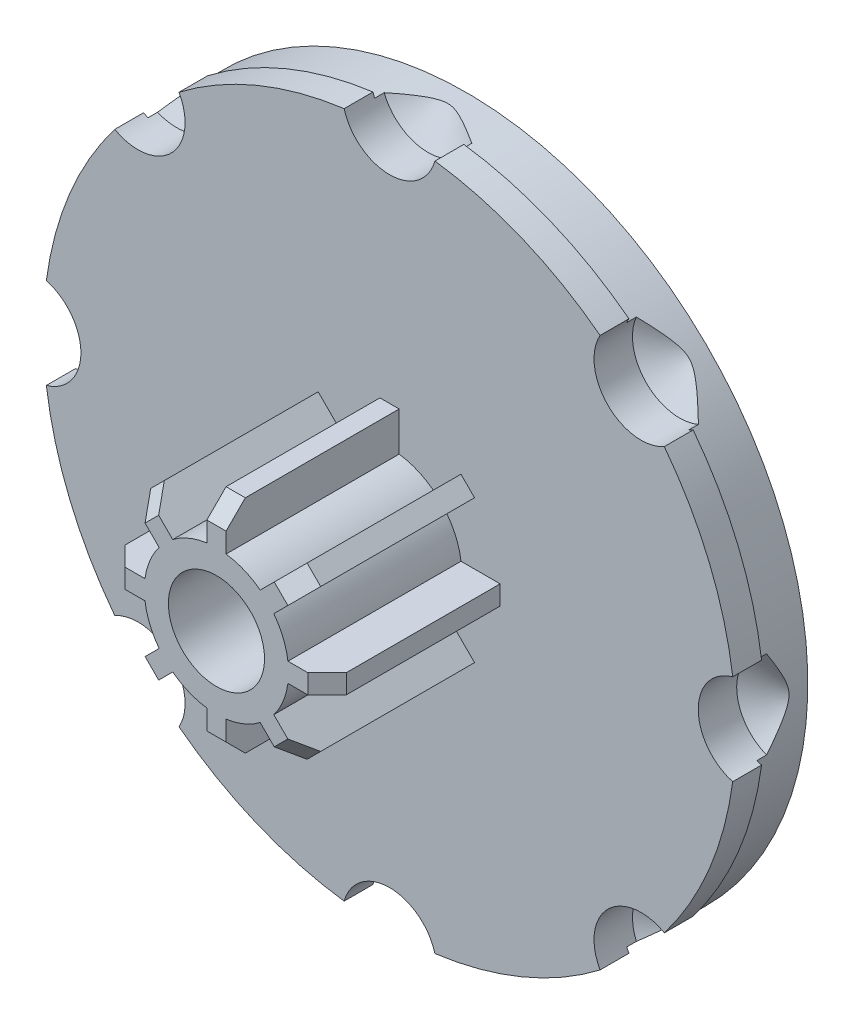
ISO-10303-21;
HEADER;
FILE_DESCRIPTION(('STEP AP214'),'2;1');
FILE_NAME('part.step','',(''),(''),'','','');
FILE_SCHEMA(('AUTOMOTIVE_DESIGN { 1 0 10303 214 1 1 1 1 }'));
ENDSEC;
DATA;
#1=APPLICATION_CONTEXT('core data for automotive mechanical design processes');
#2=APPLICATION_PROTOCOL_DEFINITION('international standard','automotive_design',2000,#1);
#3=PRODUCT_CONTEXT('',#1,'mechanical');
#4=PRODUCT('Part','Part','',(#3));
#5=PRODUCT_RELATED_PRODUCT_CATEGORY('part','',(#4));
#6=PRODUCT_DEFINITION_FORMATION('','',#4);
#7=PRODUCT_DEFINITION_CONTEXT('part definition',#1,'design');
#8=PRODUCT_DEFINITION('design','',#6,#7);
#9=PRODUCT_DEFINITION_SHAPE('','',#8);
#10=(LENGTH_UNIT() NAMED_UNIT(*) SI_UNIT(.MILLI.,.METRE.));
#11=(NAMED_UNIT(*) PLANE_ANGLE_UNIT() SI_UNIT($,.RADIAN.));
#12=(NAMED_UNIT(*) SI_UNIT($,.STERADIAN.) SOLID_ANGLE_UNIT());
#13=UNCERTAINTY_MEASURE_WITH_UNIT(LENGTH_MEASURE(1.E-05),#10,'distance_accuracy_value','');
#14=(GEOMETRIC_REPRESENTATION_CONTEXT(3) GLOBAL_UNCERTAINTY_ASSIGNED_CONTEXT((#13)) GLOBAL_UNIT_ASSIGNED_CONTEXT((#10,
#11,#12)) REPRESENTATION_CONTEXT('',''));
#15=CARTESIAN_POINT('',(0.,0.,0.));
#16=DIRECTION('',(0.,0.,1.));
#17=DIRECTION('',(1.,0.,0.));
#18=AXIS2_PLACEMENT_3D('',#15,#16,#17);
#19=CARTESIAN_POINT('',(0.,0.,4.));
#20=DIRECTION('',(0.,0.,-1.));
#21=DIRECTION('',(-1.,0.,0.));
#22=AXIS2_PLACEMENT_3D('',#19,#20,#21);
#23=CYLINDRICAL_SURFACE('',#22,18.);
#24=CARTESIAN_POINT('',(0.,0.,2.5));
#25=DIRECTION('',(0.,0.,-1.));
#26=DIRECTION('',(-1.,0.,0.));
#27=AXIS2_PLACEMENT_3D('',#24,#25,#26);
#28=CIRCLE('',#27,18.);
#29=CARTESIAN_POINT('',(-17.844527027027,2.36068955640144,2.5));
#30=VERTEX_POINT('',#29);
#31=CARTESIAN_POINT('',(-14.2872456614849,10.94872647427,2.5));
#32=VERTEX_POINT('',#31);
#33=EDGE_CURVE('E510',#30,#32,#28,.T.);
#34=ORIENTED_EDGE('',*,*,#33,.F.);
#35=DIRECTION('',(0.,0.,1.));
#36=VECTOR('',#35,1.);
#37=CARTESIAN_POINT('',(-17.844527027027,2.36068955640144,3.));
#38=LINE('',#37,#36);
#39=CARTESIAN_POINT('',(-17.844527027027,2.36068955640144,4.));
#40=VERTEX_POINT('',#39);
#41=EDGE_CURVE('E508',#30,#40,#38,.T.);
#42=ORIENTED_EDGE('',*,*,#41,.T.);
#43=CARTESIAN_POINT('',(0.,0.,4.));
#44=DIRECTION('',(0.,0.,1.));
#45=DIRECTION('',(1.,0.,0.));
#46=AXIS2_PLACEMENT_3D('',#43,#44,#45);
#47=CIRCLE('',#46,18.);
#48=CARTESIAN_POINT('',(-14.2872456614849,10.94872647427,4.));
#49=VERTEX_POINT('',#48);
#50=EDGE_CURVE('E844',#49,#40,#47,.T.);
#51=ORIENTED_EDGE('',*,*,#50,.F.);
#52=DIRECTION('',(0.,0.,1.));
#53=VECTOR('',#52,1.);
#54=CARTESIAN_POINT('',(-14.2872456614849,10.94872647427,3.));
#55=LINE('',#54,#53);
#56=EDGE_CURVE('E791',#49,#32,#55,.F.);
#57=ORIENTED_EDGE('',*,*,#56,.T.);
#58=EDGE_LOOP('',(#34,#42,#51,#57));
#59=FACE_BOUND('',#58,.T.);
#60=ADVANCED_FACE('F35',(#59),#23,.T.);
#61=CARTESIAN_POINT('',(-10.9487264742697,14.2872456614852,2.5));
#62=VERTEX_POINT('',#61);
#63=CARTESIAN_POINT('',(-2.36068955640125,17.844527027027,2.5));
#64=VERTEX_POINT('',#63);
#65=EDGE_CURVE('E509',#62,#64,#28,.T.);
#66=ORIENTED_EDGE('',*,*,#65,.F.);
#67=DIRECTION('',(0.,0.,1.));
#68=VECTOR('',#67,1.);
#69=CARTESIAN_POINT('',(-10.9487264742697,14.2872456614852,3.));
#70=LINE('',#69,#68);
#71=CARTESIAN_POINT('',(-10.9487264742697,14.2872456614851,4.));
#72=VERTEX_POINT('',#71);
#73=EDGE_CURVE('E785',#62,#72,#70,.T.);
#74=ORIENTED_EDGE('',*,*,#73,.T.);
#75=CARTESIAN_POINT('',(-2.36068955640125,17.844527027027,4.));
#76=VERTEX_POINT('',#75);
#77=EDGE_CURVE('E840',#76,#72,#47,.T.);
#78=ORIENTED_EDGE('',*,*,#77,.F.);
#79=DIRECTION('',(0.,0.,1.));
#80=VECTOR('',#79,1.);
#81=CARTESIAN_POINT('',(-2.36068955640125,17.844527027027,3.));
#82=LINE('',#81,#80);
#83=EDGE_CURVE('E843',#76,#64,#82,.F.);
#84=ORIENTED_EDGE('',*,*,#83,.T.);
#85=EDGE_LOOP('',(#66,#74,#78,#84));
#86=FACE_BOUND('',#85,.T.);
#87=ADVANCED_FACE('F1153',(#86),#23,.T.);
#88=CARTESIAN_POINT('',(2.36068955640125,17.844527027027,2.5));
#89=VERTEX_POINT('',#88);
#90=CARTESIAN_POINT('',(10.9487264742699,14.287245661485,2.5));
#91=VERTEX_POINT('',#90);
#92=EDGE_CURVE('E517',#89,#91,#28,.T.);
#93=ORIENTED_EDGE('',*,*,#92,.F.);
#94=DIRECTION('',(0.,0.,1.));
#95=VECTOR('',#94,1.);
#96=CARTESIAN_POINT('',(2.36068955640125,17.844527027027,3.));
#97=LINE('',#96,#95);
#98=CARTESIAN_POINT('',(2.36068955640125,17.844527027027,4.));
#99=VERTEX_POINT('',#98);
#100=EDGE_CURVE('E847',#89,#99,#97,.T.);
#101=ORIENTED_EDGE('',*,*,#100,.T.);
#102=CARTESIAN_POINT('',(10.9487264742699,14.287245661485,4.));
#103=VERTEX_POINT('',#102);
#104=EDGE_CURVE('E833',#103,#99,#47,.T.);
#105=ORIENTED_EDGE('',*,*,#104,.F.);
#106=DIRECTION('',(0.,0.,1.));
#107=VECTOR('',#106,1.);
#108=CARTESIAN_POINT('',(10.9487264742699,14.287245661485,3.));
#109=LINE('',#108,#107);
#110=EDGE_CURVE('E849',#103,#91,#109,.F.);
#111=ORIENTED_EDGE('',*,*,#110,.T.);
#112=EDGE_LOOP('',(#93,#101,#105,#111));
#113=FACE_BOUND('',#112,.T.);
#114=ADVANCED_FACE('F1061',(#113),#23,.T.);
#115=CARTESIAN_POINT('',(14.287245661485,10.9487264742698,2.5));
#116=VERTEX_POINT('',#115);
#117=CARTESIAN_POINT('',(17.844527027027,2.36068955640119,2.5));
#118=VERTEX_POINT('',#117);
#119=EDGE_CURVE('E540',#116,#118,#28,.T.);
#120=ORIENTED_EDGE('',*,*,#119,.F.);
#121=DIRECTION('',(0.,0.,1.));
#122=VECTOR('',#121,1.);
#123=CARTESIAN_POINT('',(14.287245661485,10.9487264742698,3.));
#124=LINE('',#123,#122);
#125=CARTESIAN_POINT('',(14.287245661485,10.9487264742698,4.));
#126=VERTEX_POINT('',#125);
#127=EDGE_CURVE('E852',#116,#126,#124,.T.);
#128=ORIENTED_EDGE('',*,*,#127,.T.);
#129=CARTESIAN_POINT('',(17.844527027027,2.36068955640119,4.));
#130=VERTEX_POINT('',#129);
#131=EDGE_CURVE('E1068',#130,#126,#47,.T.);
#132=ORIENTED_EDGE('',*,*,#131,.F.);
#133=DIRECTION('',(0.,0.,1.));
#134=VECTOR('',#133,1.);
#135=CARTESIAN_POINT('',(17.844527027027,2.36068955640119,3.));
#136=LINE('',#135,#134);
#137=EDGE_CURVE('E854',#130,#118,#136,.F.);
#138=ORIENTED_EDGE('',*,*,#137,.T.);
#139=EDGE_LOOP('',(#120,#128,#132,#138));
#140=FACE_BOUND('',#139,.T.);
#141=ADVANCED_FACE('F1120',(#140),#23,.T.);
#142=CARTESIAN_POINT('',(17.844527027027,-2.36068955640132,2.5));
#143=VERTEX_POINT('',#142);
#144=CARTESIAN_POINT('',(14.287245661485,-10.9487264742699,2.5));
#145=VERTEX_POINT('',#144);
#146=EDGE_CURVE('E546',#143,#145,#28,.T.);
#147=ORIENTED_EDGE('',*,*,#146,.F.);
#148=DIRECTION('',(0.,0.,1.));
#149=VECTOR('',#148,1.);
#150=CARTESIAN_POINT('',(17.844527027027,-2.36068955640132,3.));
#151=LINE('',#150,#149);
#152=CARTESIAN_POINT('',(17.844527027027,-2.36068955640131,4.));
#153=VERTEX_POINT('',#152);
#154=EDGE_CURVE('E857',#143,#153,#151,.T.);
#155=ORIENTED_EDGE('',*,*,#154,.T.);
#156=CARTESIAN_POINT('',(14.287245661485,-10.9487264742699,4.));
#157=VERTEX_POINT('',#156);
#158=EDGE_CURVE('E1069',#157,#153,#47,.T.);
#159=ORIENTED_EDGE('',*,*,#158,.F.);
#160=DIRECTION('',(0.,0.,1.));
#161=VECTOR('',#160,1.);
#162=CARTESIAN_POINT('',(14.287245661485,-10.9487264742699,3.));
#163=LINE('',#162,#161);
#164=EDGE_CURVE('E859',#157,#145,#163,.F.);
#165=ORIENTED_EDGE('',*,*,#164,.T.);
#166=EDGE_LOOP('',(#147,#155,#159,#165));
#167=FACE_BOUND('',#166,.T.);
#168=ADVANCED_FACE('F1114',(#167),#23,.T.);
#169=CARTESIAN_POINT('',(10.9487264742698,-14.2872456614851,2.5));
#170=VERTEX_POINT('',#169);
#171=CARTESIAN_POINT('',(2.36068955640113,-17.844527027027,2.5));
#172=VERTEX_POINT('',#171);
#173=EDGE_CURVE('E553',#170,#172,#28,.T.);
#174=ORIENTED_EDGE('',*,*,#173,.F.);
#175=DIRECTION('',(0.,0.,1.));
#176=VECTOR('',#175,1.);
#177=CARTESIAN_POINT('',(10.9487264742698,-14.2872456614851,3.));
#178=LINE('',#177,#176);
#179=CARTESIAN_POINT('',(10.9487264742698,-14.2872456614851,4.));
#180=VERTEX_POINT('',#179);
#181=EDGE_CURVE('E862',#170,#180,#178,.T.);
#182=ORIENTED_EDGE('',*,*,#181,.T.);
#183=CARTESIAN_POINT('',(2.36068955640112,-17.844527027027,4.));
#184=VERTEX_POINT('',#183);
#185=EDGE_CURVE('E1073',#184,#180,#47,.T.);
#186=ORIENTED_EDGE('',*,*,#185,.F.);
#187=DIRECTION('',(0.,0.,1.));
#188=VECTOR('',#187,1.);
#189=CARTESIAN_POINT('',(2.36068955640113,-17.844527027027,3.));
#190=LINE('',#189,#188);
#191=EDGE_CURVE('E864',#184,#172,#190,.F.);
#192=ORIENTED_EDGE('',*,*,#191,.T.);
#193=EDGE_LOOP('',(#174,#182,#186,#192));
#194=FACE_BOUND('',#193,.T.);
#195=ADVANCED_FACE('F1107',(#194),#23,.T.);
#196=CARTESIAN_POINT('',(-2.36068955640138,-17.844527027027,2.5));
#197=VERTEX_POINT('',#196);
#198=CARTESIAN_POINT('',(-10.94872647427,-14.2872456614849,2.5));
#199=VERTEX_POINT('',#198);
#200=EDGE_CURVE('E524',#197,#199,#28,.T.);
#201=ORIENTED_EDGE('',*,*,#200,.F.);
#202=DIRECTION('',(0.,0.,1.));
#203=VECTOR('',#202,1.);
#204=CARTESIAN_POINT('',(-2.36068955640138,-17.844527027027,3.));
#205=LINE('',#204,#203);
#206=CARTESIAN_POINT('',(-2.36068955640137,-17.844527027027,4.));
#207=VERTEX_POINT('',#206);
#208=EDGE_CURVE('E867',#197,#207,#205,.T.);
#209=ORIENTED_EDGE('',*,*,#208,.T.);
#210=CARTESIAN_POINT('',(-10.94872647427,-14.2872456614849,4.));
#211=VERTEX_POINT('',#210);
#212=EDGE_CURVE('E1077',#211,#207,#47,.T.);
#213=ORIENTED_EDGE('',*,*,#212,.F.);
#214=DIRECTION('',(0.,0.,1.));
#215=VECTOR('',#214,1.);
#216=CARTESIAN_POINT('',(-10.94872647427,-14.2872456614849,3.));
#217=LINE('',#216,#215);
#218=EDGE_CURVE('E869',#211,#199,#217,.F.);
#219=ORIENTED_EDGE('',*,*,#218,.T.);
#220=EDGE_LOOP('',(#201,#209,#213,#219));
#221=FACE_BOUND('',#220,.T.);
#222=ADVANCED_FACE('F1100',(#221),#23,.T.);
#223=CARTESIAN_POINT('',(-14.2872456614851,-10.9487264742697,2.5));
#224=VERTEX_POINT('',#223);
#225=CARTESIAN_POINT('',(-17.844527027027,-2.36068955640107,2.5));
#226=VERTEX_POINT('',#225);
#227=EDGE_CURVE('E515',#224,#226,#28,.T.);
#228=ORIENTED_EDGE('',*,*,#227,.F.);
#229=DIRECTION('',(0.,0.,1.));
#230=VECTOR('',#229,1.);
#231=CARTESIAN_POINT('',(-14.2872456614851,-10.9487264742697,3.));
#232=LINE('',#231,#230);
#233=CARTESIAN_POINT('',(-14.2872456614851,-10.9487264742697,4.));
#234=VERTEX_POINT('',#233);
#235=EDGE_CURVE('E872',#224,#234,#232,.T.);
#236=ORIENTED_EDGE('',*,*,#235,.T.);
#237=CARTESIAN_POINT('',(-17.844527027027,-2.36068955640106,4.));
#238=VERTEX_POINT('',#237);
#239=EDGE_CURVE('E1081',#238,#234,#47,.T.);
#240=ORIENTED_EDGE('',*,*,#239,.F.);
#241=DIRECTION('',(0.,0.,1.));
#242=VECTOR('',#241,1.);
#243=CARTESIAN_POINT('',(-17.844527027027,-2.36068955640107,3.));
#244=LINE('',#243,#242);
#245=EDGE_CURVE('E874',#238,#226,#244,.F.);
#246=ORIENTED_EDGE('',*,*,#245,.T.);
#247=EDGE_LOOP('',(#228,#236,#240,#246));
#248=FACE_BOUND('',#247,.T.);
#249=ADVANCED_FACE('F1093',(#248),#23,.T.);
#250=CARTESIAN_POINT('',(0.,0.,0.));
#251=DIRECTION('',(0.,0.,1.));
#252=DIRECTION('',(1.,0.,0.));
#253=AXIS2_PLACEMENT_3D('',#250,#251,#252);
#254=PLANE('',#253);
#255=CARTESIAN_POINT('',(0.,0.,0.));
#256=DIRECTION('',(0.,0.,1.));
#257=DIRECTION('',(1.,0.,0.));
#258=AXIS2_PLACEMENT_3D('',#255,#256,#257);
#259=CIRCLE('',#258,2.5);
#260=CARTESIAN_POINT('',(2.5,0.,0.));
#261=VERTEX_POINT('',#260);
#262=EDGE_CURVE('E537',#261,#261,#259,.T.);
#263=ORIENTED_EDGE('',*,*,#262,.T.);
#264=EDGE_LOOP('',(#263));
#265=FACE_BOUND('',#264,.T.);
#266=CARTESIAN_POINT('',(0.,0.,0.));
#267=DIRECTION('',(0.,0.,-1.));
#268=DIRECTION('',(-1.,0.,0.));
#269=AXIS2_PLACEMENT_3D('',#266,#267,#268);
#270=CIRCLE('',#269,17.75);
#271=CARTESIAN_POINT('',(-17.75,0.,0.));
#272=VERTEX_POINT('',#271);
#273=EDGE_CURVE('E1135',#272,#272,#270,.T.);
#274=ORIENTED_EDGE('',*,*,#273,.T.);
#275=EDGE_LOOP('',(#274));
#276=FACE_BOUND('',#275,.T.);
#277=ADVANCED_FACE('F1034',(#265,#276),#254,.F.);
#278=CARTESIAN_POINT('',(0.,18.5,4.));
#279=DIRECTION('',(0.,0.,1.));
#280=DIRECTION('',(1.,0.,0.));
#281=AXIS2_PLACEMENT_3D('',#278,#279,#280);
#282=CYLINDRICAL_SURFACE('',#281,2.45);
#283=CARTESIAN_POINT('',(0.,18.5,2.5));
#284=DIRECTION('',(0.,0.,-1.));
#285=DIRECTION('',(-1.,0.,0.));
#286=AXIS2_PLACEMENT_3D('',#283,#284,#285);
#287=CIRCLE('',#286,2.45);
#288=CARTESIAN_POINT('',(2.27987774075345,17.602972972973,2.5));
#289=VERTEX_POINT('',#288);
#290=EDGE_CURVE('E525',#289,#89,#287,.F.);
#291=ORIENTED_EDGE('',*,*,#290,.F.);
#292=DIRECTION('',(0.,0.,-1.));
#293=VECTOR('',#292,1.);
#294=CARTESIAN_POINT('',(2.27987774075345,17.602972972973,1.25));
#295=LINE('',#294,#293);
#296=CARTESIAN_POINT('',(2.27987774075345,17.602972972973,2.));
#297=VERTEX_POINT('',#296);
#298=EDGE_CURVE('E516',#297,#289,#295,.F.);
#299=ORIENTED_EDGE('',*,*,#298,.F.);
#300=CARTESIAN_POINT('',(0.,18.5,2.));
#301=DIRECTION('',(0.,0.,1.));
#302=DIRECTION('',(1.,0.,0.));
#303=AXIS2_PLACEMENT_3D('',#300,#301,#302);
#304=CIRCLE('',#303,2.45);
#305=CARTESIAN_POINT('',(-2.27987774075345,17.602972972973,2.));
#306=VERTEX_POINT('',#305);
#307=EDGE_CURVE('E826',#306,#297,#304,.T.);
#308=ORIENTED_EDGE('',*,*,#307,.F.);
#309=DIRECTION('',(0.,0.,-1.));
#310=VECTOR('',#309,1.);
#311=CARTESIAN_POINT('',(-2.27987774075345,17.602972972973,1.25));
#312=LINE('',#311,#310);
#313=CARTESIAN_POINT('',(-2.27987774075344,17.602972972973,2.5));
#314=VERTEX_POINT('',#313);
#315=EDGE_CURVE('E1047',#314,#306,#312,.T.);
#316=ORIENTED_EDGE('',*,*,#315,.F.);
#317=EDGE_CURVE('E513',#64,#314,#287,.F.);
#318=ORIENTED_EDGE('',*,*,#317,.F.);
#319=ORIENTED_EDGE('',*,*,#83,.F.);
#320=CARTESIAN_POINT('',(0.,18.5,4.));
#321=DIRECTION('',(0.,0.,1.));
#322=DIRECTION('',(1.,0.,0.));
#323=AXIS2_PLACEMENT_3D('',#320,#321,#322);
#324=CIRCLE('',#323,2.44999999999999);
#325=EDGE_CURVE('E823',#76,#99,#324,.T.);
#326=ORIENTED_EDGE('',*,*,#325,.T.);
#327=ORIENTED_EDGE('',*,*,#100,.F.);
#328=EDGE_LOOP('',(#291,#299,#308,#316,#318,#319,#326,#327));
#329=FACE_BOUND('',#328,.T.);
#330=ADVANCED_FACE('F1030',(#329),#282,.F.);
#331=CARTESIAN_POINT('',(0.,18.5,2.));
#332=DIRECTION('',(0.,0.,1.));
#333=DIRECTION('',(1.,0.,0.));
#334=AXIS2_PLACEMENT_3D('',#331,#332,#333);
#335=CONICAL_SURFACE('',#334,2.45,1.02974425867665);
#336=CARTESIAN_POINT('',(-2.36088955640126,17.59229093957,2.04769299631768));
#337=CARTESIAN_POINT('',(-2.26955954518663,17.6045459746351,1.99385371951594));
#338=CARTESIAN_POINT('',(-2.17803951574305,17.616105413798,1.94017420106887));
#339=CARTESIAN_POINT('',(-1.99446701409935,17.6378332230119,1.83336856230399));
#340=CARTESIAN_POINT('',(-1.90241435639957,17.6480010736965,1.78024265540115));
#341=CARTESIAN_POINT('',(-1.71605121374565,17.6671048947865,1.67388215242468));
#342=CARTESIAN_POINT('',(-1.62172966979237,17.676015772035,1.62066239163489));
#343=CARTESIAN_POINT('',(-1.43222675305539,17.6923790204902,1.51558998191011));
#344=CARTESIAN_POINT('',(-1.33704559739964,17.699831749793,1.46373700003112));
#345=CARTESIAN_POINT('',(-1.1729767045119,17.7113325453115,1.3769587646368));
#346=CARTESIAN_POINT('',(-1.10441755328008,17.715742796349,1.34146211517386));
#347=CARTESIAN_POINT('',(-0.966298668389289,17.7238132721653,1.27225996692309));
#348=CARTESIAN_POINT('',(-0.896738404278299,17.7274730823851,1.23855546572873));
#349=CARTESIAN_POINT('',(-0.756554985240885,17.7340077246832,1.17421775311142));
#350=CARTESIAN_POINT('',(-0.685938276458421,17.7368861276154,1.14357098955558));
#351=CARTESIAN_POINT('',(-0.54272663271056,17.7418452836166,1.08717884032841));
#352=CARTESIAN_POINT('',(-0.470133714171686,17.7439268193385,1.06142865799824));
#353=CARTESIAN_POINT('',(-0.354876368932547,17.7465003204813,1.02787257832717));
#354=CARTESIAN_POINT('',(-0.313082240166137,17.7472888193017,1.01715432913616));
#355=CARTESIAN_POINT('',(-0.228736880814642,17.7485761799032,0.999252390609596));
#356=CARTESIAN_POINT('',(-0.186186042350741,17.749075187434,0.992066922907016));
#357=CARTESIAN_POINT('',(-0.100896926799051,17.7497639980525,0.98205050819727));
#358=CARTESIAN_POINT('',(-0.0581628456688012,17.7499562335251,0.9791853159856));
#359=CARTESIAN_POINT('',(0.0273694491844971,17.7500304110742,0.978086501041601));
#360=CARTESIAN_POINT('',(0.0701676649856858,17.7499123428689,0.979853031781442));
#361=CARTESIAN_POINT('',(0.154875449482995,17.7493743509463,0.987731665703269));
#362=CARTESIAN_POINT('',(0.196789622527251,17.7489577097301,0.993796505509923));
#363=CARTESIAN_POINT('',(0.279924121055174,17.7478413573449,1.00953223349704));
#364=CARTESIAN_POINT('',(0.321144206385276,17.7471415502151,1.01920434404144));
#365=CARTESIAN_POINT('',(0.403626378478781,17.7454592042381,1.04156973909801));
#366=CARTESIAN_POINT('',(0.444872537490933,17.7444712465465,1.05432003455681));
#367=CARTESIAN_POINT('',(0.526608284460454,17.7422336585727,1.0819829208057));
#368=CARTESIAN_POINT('',(0.567097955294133,17.7409840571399,1.09689527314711));
#369=CARTESIAN_POINT('',(0.648238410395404,17.7382064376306,1.12862361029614));
#370=CARTESIAN_POINT('',(0.688876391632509,17.7366733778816,1.1454715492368));
#371=CARTESIAN_POINT('',(0.769615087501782,17.7333534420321,1.18039139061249));
#372=CARTESIAN_POINT('',(0.809715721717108,17.7315665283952,1.19846347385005));
#373=CARTESIAN_POINT('',(0.929416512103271,17.725830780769,1.25404983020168));
#374=CARTESIAN_POINT('',(1.00836897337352,17.7215085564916,1.29291509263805));
#375=CARTESIAN_POINT('',(1.16534218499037,17.711879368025,1.37282608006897));
#376=CARTESIAN_POINT('',(1.24335997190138,17.7065698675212,1.41387722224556));
#377=CARTESIAN_POINT('',(1.39858754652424,17.6949853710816,1.49728242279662));
#378=CARTESIAN_POINT('',(1.47579759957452,17.6887107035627,1.53963603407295));
#379=CARTESIAN_POINT('',(1.62093131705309,17.6759658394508,1.6203604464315));
#380=CARTESIAN_POINT('',(1.68891578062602,17.669598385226,1.65863866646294));
#381=CARTESIAN_POINT('',(1.82453749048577,17.6561096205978,1.73568947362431));
#382=CARTESIAN_POINT('',(1.89217470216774,17.648988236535,1.77446210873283));
#383=CARTESIAN_POINT('',(2.02680403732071,17.6340332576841,1.85216251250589));
#384=CARTESIAN_POINT('',(2.09379768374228,17.6262035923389,1.89108840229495));
#385=CARTESIAN_POINT('',(2.22752620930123,17.6098029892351,1.96920871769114));
#386=CARTESIAN_POINT('',(2.29426111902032,17.6012321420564,2.00840310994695));
#387=CARTESIAN_POINT('',(2.36088955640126,17.59229093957,2.04769299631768));
#388=B_SPLINE_CURVE_WITH_KNOTS('',3,(#336,#337,#338,#339,#340,#341,#342,#343,#344,#345,#346,
#347,#348,#349,#350,#351,#352,#353,#354,#355,#356,#357,#358,#359,#360,#361,#362,#363,#364,#365,
#366,#367,#368,#369,#370,#371,#372,#373,#374,#375,#376,#377,#378,#379,#380,#381,#382,#383,#384,
#385,#386,#387),.UNSPECIFIED.,.F.,.F.,(4,2,2,2,2,2,2,2,2,2,2,2,2,2,2,2,2,2,2,2,2,2,2,2,2,4),(0.,
0.320172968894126,0.640465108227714,0.966447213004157,1.29234916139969,1.52431847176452,
1.75641558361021,1.98743349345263,2.21822392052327,2.3475696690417,2.47685023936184,
2.60510056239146,2.73335513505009,2.86022089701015,2.98712968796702,3.11659865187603,
3.24605334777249,3.37808194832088,3.51013009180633,3.77437733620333,4.03931305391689,
4.30415882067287,4.538990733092,4.77384560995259,5.0074692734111,5.24106442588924),.UNSPECIFIED.);
#389=EDGE_CURVE('E1042',#306,#297,#388,.T.);
#390=ORIENTED_EDGE('',*,*,#389,.F.);
#391=ORIENTED_EDGE('',*,*,#307,.T.);
#392=EDGE_LOOP('',(#390,#391));
#393=FACE_BOUND('',#392,.T.);
#394=ADVANCED_FACE('F1033',(#393),#335,.F.);
#395=CARTESIAN_POINT('',(13.0814754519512,13.0814754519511,4.));
#396=DIRECTION('',(0.,0.,1.));
#397=DIRECTION('',(1.,0.,0.));
#398=AXIS2_PLACEMENT_3D('',#395,#396,#397);
#399=CYLINDRICAL_SURFACE('',#398,2.45);
#400=CARTESIAN_POINT('',(13.0814754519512,13.0814754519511,2.5));
#401=DIRECTION('',(0.,0.,-1.));
#402=DIRECTION('',(-1.,0.,0.));
#403=AXIS2_PLACEMENT_3D('',#400,#401,#402);
#404=CIRCLE('',#403,2.45);
#405=CARTESIAN_POINT('',(14.0592985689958,10.8350645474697,2.5));
#406=VERTEX_POINT('',#405);
#407=EDGE_CURVE('E542',#406,#116,#404,.F.);
#408=ORIENTED_EDGE('',*,*,#407,.F.);
#409=DIRECTION('',(0.,0.,-1.));
#410=VECTOR('',#409,1.);
#411=CARTESIAN_POINT('',(14.0592985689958,10.8350645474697,1.25));
#412=LINE('',#411,#410);
#413=CARTESIAN_POINT('',(14.0592985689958,10.8350645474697,2.));
#414=VERTEX_POINT('',#413);
#415=EDGE_CURVE('E1048',#414,#406,#412,.F.);
#416=ORIENTED_EDGE('',*,*,#415,.F.);
#417=CARTESIAN_POINT('',(13.0814754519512,13.0814754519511,2.));
#418=DIRECTION('',(0.,0.,1.));
#419=DIRECTION('',(1.,0.,0.));
#420=AXIS2_PLACEMENT_3D('',#417,#418,#419);
#421=CIRCLE('',#420,2.45);
#422=CARTESIAN_POINT('',(10.8350645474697,14.0592985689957,2.));
#423=VERTEX_POINT('',#422);
#424=EDGE_CURVE('E820',#423,#414,#421,.T.);
#425=ORIENTED_EDGE('',*,*,#424,.F.);
#426=DIRECTION('',(0.,0.,-1.));
#427=VECTOR('',#426,1.);
#428=CARTESIAN_POINT('',(10.8350645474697,14.0592985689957,1.25));
#429=LINE('',#428,#427);
#430=CARTESIAN_POINT('',(10.8350645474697,14.0592985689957,2.5));
#431=VERTEX_POINT('',#430);
#432=EDGE_CURVE('E1019',#431,#423,#429,.T.);
#433=ORIENTED_EDGE('',*,*,#432,.F.);
#434=EDGE_CURVE('E539',#91,#431,#404,.F.);
#435=ORIENTED_EDGE('',*,*,#434,.F.);
#436=ORIENTED_EDGE('',*,*,#110,.F.);
#437=CARTESIAN_POINT('',(13.0814754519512,13.0814754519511,4.));
#438=DIRECTION('',(0.,0.,1.));
#439=DIRECTION('',(1.,0.,0.));
#440=AXIS2_PLACEMENT_3D('',#437,#438,#439);
#441=CIRCLE('',#440,2.44999999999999);
#442=EDGE_CURVE('E817',#103,#126,#441,.T.);
#443=ORIENTED_EDGE('',*,*,#442,.T.);
#444=ORIENTED_EDGE('',*,*,#127,.F.);
#445=EDGE_LOOP('',(#408,#416,#425,#433,#435,#436,#443,#444));
#446=FACE_BOUND('',#445,.T.);
#447=ADVANCED_FACE('F1028',(#446),#399,.F.);
#448=CARTESIAN_POINT('',(13.0814754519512,13.0814754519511,2.));
#449=DIRECTION('',(0.,0.,1.));
#450=DIRECTION('',(1.,0.,0.));
#451=AXIS2_PLACEMENT_3D('',#448,#449,#450);
#452=CONICAL_SURFACE('',#451,2.45,1.02974425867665);
#453=CARTESIAN_POINT('',(10.6040135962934,14.2343737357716,2.16979100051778));
#454=CARTESIAN_POINT('',(10.6832328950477,14.1753569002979,2.11169616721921));
#455=CARTESIAN_POINT('',(10.762029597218,14.1156300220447,2.0537430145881));
#456=CARTESIAN_POINT('',(10.9188798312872,13.9946557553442,1.93832529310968));
#457=CARTESIAN_POINT('',(10.9969330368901,13.9334077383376,1.88086093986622));
#458=CARTESIAN_POINT('',(11.1535542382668,13.8083643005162,1.7657770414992));
#459=CARTESIAN_POINT('',(11.2321110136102,13.7445439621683,1.70816927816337));
#460=CARTESIAN_POINT('',(11.3886173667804,13.6151462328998,1.59418368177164));
#461=CARTESIAN_POINT('',(11.4665671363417,13.5495694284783,1.5378054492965));
#462=CARTESIAN_POINT('',(11.6039758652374,13.4319172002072,1.44006202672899));
#463=CARTESIAN_POINT('',(11.663496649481,13.380270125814,1.39826881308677));
#464=CARTESIAN_POINT('',(11.7826456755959,13.2754686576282,1.31657385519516));
#465=CARTESIAN_POINT('',(11.8422739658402,13.2223130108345,1.27667376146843));
#466=CARTESIAN_POINT('',(11.9319304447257,13.141276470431,1.21938606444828));
#467=CARTESIAN_POINT('',(11.9617948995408,13.114099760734,1.2007500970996));
#468=CARTESIAN_POINT('',(12.0217007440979,13.059206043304,1.16459648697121));
#469=CARTESIAN_POINT('',(12.0517421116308,13.0314891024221,1.14707870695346));
#470=CARTESIAN_POINT('',(12.1120474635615,12.9754575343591,1.11357339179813));
#471=CARTESIAN_POINT('',(12.1423111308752,12.947143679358,1.09758401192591));
#472=CARTESIAN_POINT('',(12.2031696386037,12.8897982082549,1.06767463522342));
#473=CARTESIAN_POINT('',(12.2337643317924,12.860766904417,1.05375375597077));
#474=CARTESIAN_POINT('',(12.2912316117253,12.8058379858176,1.03040184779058));
#475=CARTESIAN_POINT('',(12.3180548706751,12.7800404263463,1.02061935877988));
#476=CARTESIAN_POINT('',(12.3719778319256,12.7278462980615,1.0037608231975));
#477=CARTESIAN_POINT('',(12.3990774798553,12.7014498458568,0.996684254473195));
#478=CARTESIAN_POINT('',(12.4532256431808,12.6483633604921,0.985864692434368));
#479=CARTESIAN_POINT('',(12.4802727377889,12.6216775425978,0.982094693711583));
#480=CARTESIAN_POINT('',(12.5343277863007,12.5679981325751,0.978172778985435));
#481=CARTESIAN_POINT('',(12.5613357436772,12.5410045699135,0.97802051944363));
#482=CARTESIAN_POINT('',(12.6150629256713,12.4869587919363,0.981350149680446));
#483=CARTESIAN_POINT('',(12.6417821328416,12.4599065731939,0.984832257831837));
#484=CARTESIAN_POINT('',(12.6947390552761,12.4059474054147,0.995074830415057));
#485=CARTESIAN_POINT('',(12.720976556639,12.3790405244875,1.00183671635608));
#486=CARTESIAN_POINT('',(12.7731023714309,12.3252493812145,1.01815091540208));
#487=CARTESIAN_POINT('',(12.7989851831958,12.2983676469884,1.02772854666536));
#488=CARTESIAN_POINT('',(12.8501420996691,12.2449057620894,1.04905256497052));
#489=CARTESIAN_POINT('',(12.8754162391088,12.2183255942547,1.06079882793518));
#490=CARTESIAN_POINT('',(12.9275509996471,12.1631610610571,1.0870301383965));
#491=CARTESIAN_POINT('',(12.9543613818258,12.1346006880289,1.1016637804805));
#492=CARTESIAN_POINT('',(13.0074044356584,12.0777250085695,1.13239048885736));
#493=CARTESIAN_POINT('',(13.0336369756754,12.0494097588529,1.14848388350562));
#494=CARTESIAN_POINT('',(13.1116278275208,11.964682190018,1.19840449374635));
#495=CARTESIAN_POINT('',(13.1626346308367,11.9085354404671,1.23384812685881));
#496=CARTESIAN_POINT('',(13.2632457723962,11.7963763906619,1.30729925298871));
#497=CARTESIAN_POINT('',(13.3128461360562,11.7403648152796,1.34531314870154));
#498=CARTESIAN_POINT('',(13.4108144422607,11.6283314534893,1.42289668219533));
#499=CARTESIAN_POINT('',(13.4591822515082,11.5723096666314,1.46246648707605));
#500=CARTESIAN_POINT('',(13.5549220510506,11.460019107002,1.54266770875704));
#501=CARTESIAN_POINT('',(13.6022926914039,11.403750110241,1.58330041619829));
#502=CARTESIAN_POINT('',(13.6960913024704,11.290923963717,1.66526593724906));
#503=CARTESIAN_POINT('',(13.7425191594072,11.2343667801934,1.70659883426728));
#504=CARTESIAN_POINT('',(13.8803605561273,11.0643288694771,1.83120265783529));
#505=CARTESIAN_POINT('',(13.9704711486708,10.9503183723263,1.91519715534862));
#506=CARTESIAN_POINT('',(14.0886000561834,10.7970457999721,2.0279739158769));
#507=CARTESIAN_POINT('',(14.1180333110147,10.7585306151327,2.05630117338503));
#508=CARTESIAN_POINT('',(14.1764927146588,10.6813806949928,2.11300188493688));
#509=CARTESIAN_POINT('',(14.2055195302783,10.6427463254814,2.14137514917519));
#510=CARTESIAN_POINT('',(14.2343737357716,10.6040135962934,2.16979100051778));
#511=B_SPLINE_CURVE_WITH_KNOTS('',3,(#453,#454,#455,#456,#457,#458,#459,#460,#461,#462,#463,
#464,#465,#466,#467,#468,#469,#470,#471,#472,#473,#474,#475,#476,#477,#478,#479,#480,#481,#482,
#483,#484,#485,#486,#487,#488,#489,#490,#491,#492,#493,#494,#495,#496,#497,#498,#499,#500,#501,
#502,#503,#504,#505,#506,#507,#508,#509,#510),.UNSPECIFIED.,.F.,.F.,(4,2,2,2,2,2,2,2,2,2,2,2,2,
2,2,2,2,2,2,2,2,2,2,2,2,2,2,2,4),(0.,0.3438066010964,0.687757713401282,1.03712008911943,
1.38636722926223,1.65395257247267,1.92176707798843,2.05517041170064,2.18855734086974,
2.32178118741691,2.45494803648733,2.5703083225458,2.68564633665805,2.80003334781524,
2.91440949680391,3.0287925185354,3.14322516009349,3.25871996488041,3.37420816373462,
3.49961783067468,3.62505577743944,3.8761396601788,4.12787385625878,4.379635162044,
4.63171783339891,4.88383074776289,5.38732124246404,5.55575301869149,5.72386502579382),.UNSPECIFIED.);
#512=EDGE_CURVE('E1012',#423,#414,#511,.T.);
#513=ORIENTED_EDGE('',*,*,#512,.F.);
#514=ORIENTED_EDGE('',*,*,#424,.T.);
#515=EDGE_LOOP('',(#513,#514));
#516=FACE_BOUND('',#515,.T.);
#517=ADVANCED_FACE('F1022',(#516),#452,.F.);
#518=CARTESIAN_POINT('',(18.5,0.,4.));
#519=DIRECTION('',(0.,0.,1.));
#520=DIRECTION('',(1.,0.,0.));
#521=AXIS2_PLACEMENT_3D('',#518,#519,#520);
#522=CYLINDRICAL_SURFACE('',#521,2.45);
#523=CARTESIAN_POINT('',(18.5,0.,2.5));
#524=DIRECTION('',(0.,0.,-1.));
#525=DIRECTION('',(-1.,0.,0.));
#526=AXIS2_PLACEMENT_3D('',#523,#524,#525);
#527=CIRCLE('',#526,2.45);
#528=CARTESIAN_POINT('',(17.602972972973,-2.2798777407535,2.5));
#529=VERTEX_POINT('',#528);
#530=EDGE_CURVE('E550',#529,#143,#527,.F.);
#531=ORIENTED_EDGE('',*,*,#530,.F.);
#532=DIRECTION('',(0.,0.,-1.));
#533=VECTOR('',#532,1.);
#534=CARTESIAN_POINT('',(17.602972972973,-2.27987774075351,1.25));
#535=LINE('',#534,#533);
#536=CARTESIAN_POINT('',(17.602972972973,-2.27987774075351,2.));
#537=VERTEX_POINT('',#536);
#538=EDGE_CURVE('E1020',#537,#529,#535,.F.);
#539=ORIENTED_EDGE('',*,*,#538,.F.);
#540=CARTESIAN_POINT('',(18.5,0.,2.));
#541=DIRECTION('',(0.,0.,1.));
#542=DIRECTION('',(1.,0.,0.));
#543=AXIS2_PLACEMENT_3D('',#540,#541,#542);
#544=CIRCLE('',#543,2.45);
#545=CARTESIAN_POINT('',(17.602972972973,2.27987774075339,2.));
#546=VERTEX_POINT('',#545);
#547=EDGE_CURVE('E814',#546,#537,#544,.T.);
#548=ORIENTED_EDGE('',*,*,#547,.F.);
#549=DIRECTION('',(0.,0.,-1.));
#550=VECTOR('',#549,1.);
#551=CARTESIAN_POINT('',(17.602972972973,2.27987774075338,1.25));
#552=LINE('',#551,#550);
#553=CARTESIAN_POINT('',(17.602972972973,2.27987774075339,2.5));
#554=VERTEX_POINT('',#553);
#555=EDGE_CURVE('E1757',#554,#546,#552,.T.);
#556=ORIENTED_EDGE('',*,*,#555,.F.);
#557=EDGE_CURVE('E545',#118,#554,#527,.F.);
#558=ORIENTED_EDGE('',*,*,#557,.F.);
#559=ORIENTED_EDGE('',*,*,#137,.F.);
#560=CARTESIAN_POINT('',(18.5,0.,4.));
#561=DIRECTION('',(0.,0.,1.));
#562=DIRECTION('',(1.,0.,0.));
#563=AXIS2_PLACEMENT_3D('',#560,#561,#562);
#564=CIRCLE('',#563,2.44999999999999);
#565=EDGE_CURVE('E811',#130,#153,#564,.T.);
#566=ORIENTED_EDGE('',*,*,#565,.T.);
#567=ORIENTED_EDGE('',*,*,#154,.F.);
#568=EDGE_LOOP('',(#531,#539,#548,#556,#558,#559,#566,#567));
#569=FACE_BOUND('',#568,.T.);
#570=ADVANCED_FACE('F1027',(#569),#522,.F.);
#571=CARTESIAN_POINT('',(18.5,0.,2.));
#572=DIRECTION('',(0.,0.,1.));
#573=DIRECTION('',(1.,0.,0.));
#574=AXIS2_PLACEMENT_3D('',#571,#572,#573);
#575=CONICAL_SURFACE('',#574,2.45,1.02974425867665);
#576=CARTESIAN_POINT('',(17.59229093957,2.3608895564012,2.04769299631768));
#577=CARTESIAN_POINT('',(17.6045459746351,2.26955954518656,1.99385371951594));
#578=CARTESIAN_POINT('',(17.616105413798,2.17803951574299,1.94017420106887));
#579=CARTESIAN_POINT('',(17.6378332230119,1.99446701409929,1.83336856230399));
#580=CARTESIAN_POINT('',(17.6480010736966,1.90241435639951,1.78024265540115));
#581=CARTESIAN_POINT('',(17.6671048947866,1.71605121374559,1.67388215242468));
#582=CARTESIAN_POINT('',(17.676015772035,1.6217296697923,1.62066239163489));
#583=CARTESIAN_POINT('',(17.6923790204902,1.43222675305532,1.51558998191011));
#584=CARTESIAN_POINT('',(17.699831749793,1.33704559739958,1.46373700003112));
#585=CARTESIAN_POINT('',(17.7113325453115,1.17297670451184,1.3769587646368));
#586=CARTESIAN_POINT('',(17.715742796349,1.10441755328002,1.34146211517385));
#587=CARTESIAN_POINT('',(17.7238132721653,0.966298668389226,1.27225996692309));
#588=CARTESIAN_POINT('',(17.7274730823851,0.896738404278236,1.23855546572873));
#589=CARTESIAN_POINT('',(17.7340077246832,0.756554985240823,1.17421775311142));
#590=CARTESIAN_POINT('',(17.7368861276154,0.685938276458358,1.14357098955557));
#591=CARTESIAN_POINT('',(17.7418452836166,0.542726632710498,1.08717884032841));
#592=CARTESIAN_POINT('',(17.7439268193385,0.470133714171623,1.06142865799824));
#593=CARTESIAN_POINT('',(17.7465003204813,0.354876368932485,1.02787257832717));
#594=CARTESIAN_POINT('',(17.7472888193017,0.313082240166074,1.01715432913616));
#595=CARTESIAN_POINT('',(17.7485761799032,0.22873688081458,0.999252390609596));
#596=CARTESIAN_POINT('',(17.749075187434,0.186186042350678,0.992066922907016));
#597=CARTESIAN_POINT('',(17.7497639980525,0.100896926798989,0.98205050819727));
#598=CARTESIAN_POINT('',(17.7499562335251,0.0581628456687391,0.9791853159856));
#599=CARTESIAN_POINT('',(17.7500304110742,-0.0273694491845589,0.978086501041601));
#600=CARTESIAN_POINT('',(17.7499123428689,-0.0701676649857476,0.979853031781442));
#601=CARTESIAN_POINT('',(17.7493743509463,-0.154875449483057,0.987731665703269));
#602=CARTESIAN_POINT('',(17.7489577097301,-0.196789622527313,0.993796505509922));
#603=CARTESIAN_POINT('',(17.7478413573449,-0.279924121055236,1.00953223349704));
#604=CARTESIAN_POINT('',(17.7471415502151,-0.321144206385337,1.01920434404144));
#605=CARTESIAN_POINT('',(17.7454592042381,-0.403626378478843,1.04156973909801));
#606=CARTESIAN_POINT('',(17.7444712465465,-0.444872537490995,1.05432003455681));
#607=CARTESIAN_POINT('',(17.7422336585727,-0.526608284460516,1.0819829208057));
#608=CARTESIAN_POINT('',(17.7409840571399,-0.567097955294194,1.09689527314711));
#609=CARTESIAN_POINT('',(17.7382064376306,-0.648238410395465,1.12862361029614));
#610=CARTESIAN_POINT('',(17.7366733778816,-0.688876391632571,1.1454715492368));
#611=CARTESIAN_POINT('',(17.7333534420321,-0.769615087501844,1.18039139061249));
#612=CARTESIAN_POINT('',(17.7315665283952,-0.80971572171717,1.19846347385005));
#613=CARTESIAN_POINT('',(17.725830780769,-0.929416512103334,1.25404983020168));
#614=CARTESIAN_POINT('',(17.7215085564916,-1.00836897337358,1.29291509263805));
#615=CARTESIAN_POINT('',(17.7118793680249,-1.16534218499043,1.37282608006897));
#616=CARTESIAN_POINT('',(17.7065698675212,-1.24335997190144,1.41387722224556));
#617=CARTESIAN_POINT('',(17.6949853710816,-1.39858754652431,1.49728242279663));
#618=CARTESIAN_POINT('',(17.6887107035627,-1.47579759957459,1.53963603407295));
#619=CARTESIAN_POINT('',(17.6759658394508,-1.62093131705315,1.6203604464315));
#620=CARTESIAN_POINT('',(17.669598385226,-1.68891578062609,1.65863866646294));
#621=CARTESIAN_POINT('',(17.6561096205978,-1.82453749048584,1.73568947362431));
#622=CARTESIAN_POINT('',(17.648988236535,-1.8921747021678,1.77446210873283));
#623=CARTESIAN_POINT('',(17.634033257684,-2.02680403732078,1.85216251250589));
#624=CARTESIAN_POINT('',(17.6262035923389,-2.09379768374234,1.89108840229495));
#625=CARTESIAN_POINT('',(17.6098029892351,-2.22752620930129,1.96920871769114));
#626=CARTESIAN_POINT('',(17.6012321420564,-2.29426111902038,2.00840310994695));
#627=CARTESIAN_POINT('',(17.59229093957,-2.36088955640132,2.04769299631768));
#628=B_SPLINE_CURVE_WITH_KNOTS('',3,(#576,#577,#578,#579,#580,#581,#582,#583,#584,#585,#586,
#587,#588,#589,#590,#591,#592,#593,#594,#595,#596,#597,#598,#599,#600,#601,#602,#603,#604,#605,
#606,#607,#608,#609,#610,#611,#612,#613,#614,#615,#616,#617,#618,#619,#620,#621,#622,#623,#624,
#625,#626,#627),.UNSPECIFIED.,.F.,.F.,(4,2,2,2,2,2,2,2,2,2,2,2,2,2,2,2,2,2,2,2,2,2,2,2,2,4),(0.,
0.320172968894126,0.640465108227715,0.966447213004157,1.29234916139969,1.52431847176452,
1.75641558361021,1.98743349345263,2.21822392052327,2.34756966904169,2.47685023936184,
2.60510056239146,2.73335513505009,2.86022089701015,2.98712968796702,3.11659865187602,
3.24605334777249,3.37808194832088,3.51013009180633,3.77437733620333,4.03931305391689,
4.30415882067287,4.538990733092,4.77384560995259,5.0074692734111,5.24106442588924),.UNSPECIFIED.);
#629=EDGE_CURVE('E1004',#546,#537,#628,.T.);
#630=ORIENTED_EDGE('',*,*,#629,.F.);
#631=ORIENTED_EDGE('',*,*,#547,.T.);
#632=EDGE_LOOP('',(#630,#631));
#633=FACE_BOUND('',#632,.T.);
#634=ADVANCED_FACE('F1678',(#633),#575,.F.);
#635=CARTESIAN_POINT('',(13.0814754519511,-13.0814754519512,4.));
#636=DIRECTION('',(0.,0.,1.));
#637=DIRECTION('',(1.,0.,0.));
#638=AXIS2_PLACEMENT_3D('',#635,#636,#637);
#639=CYLINDRICAL_SURFACE('',#638,2.44999999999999);
#640=CARTESIAN_POINT('',(13.0814754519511,-13.0814754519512,2.5));
#641=DIRECTION('',(0.,0.,-1.));
#642=DIRECTION('',(-1.,0.,0.));
#643=AXIS2_PLACEMENT_3D('',#640,#641,#642);
#644=CIRCLE('',#643,2.44999999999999);
#645=CARTESIAN_POINT('',(10.8350645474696,-14.0592985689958,2.5));
#646=VERTEX_POINT('',#645);
#647=EDGE_CURVE('E557',#646,#170,#644,.F.);
#648=ORIENTED_EDGE('',*,*,#647,.F.);
#649=DIRECTION('',(0.,0.,-1.));
#650=VECTOR('',#649,1.);
#651=CARTESIAN_POINT('',(10.8350645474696,-14.0592985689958,1.25));
#652=LINE('',#651,#650);
#653=CARTESIAN_POINT('',(10.8350645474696,-14.0592985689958,2.));
#654=VERTEX_POINT('',#653);
#655=EDGE_CURVE('E1758',#654,#646,#652,.F.);
#656=ORIENTED_EDGE('',*,*,#655,.F.);
#657=CARTESIAN_POINT('',(13.0814754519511,-13.0814754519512,2.));
#658=DIRECTION('',(0.,0.,1.));
#659=DIRECTION('',(1.,0.,0.));
#660=AXIS2_PLACEMENT_3D('',#657,#658,#659);
#661=CIRCLE('',#660,2.45);
#662=CARTESIAN_POINT('',(14.0592985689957,-10.8350645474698,2.));
#663=VERTEX_POINT('',#662);
#664=EDGE_CURVE('E808',#663,#654,#661,.T.);
#665=ORIENTED_EDGE('',*,*,#664,.F.);
#666=DIRECTION('',(0.,0.,-1.));
#667=VECTOR('',#666,1.);
#668=CARTESIAN_POINT('',(14.0592985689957,-10.8350645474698,1.25));
#669=LINE('',#668,#667);
#670=CARTESIAN_POINT('',(14.0592985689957,-10.8350645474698,2.5));
#671=VERTEX_POINT('',#670);
#672=EDGE_CURVE('E1763',#671,#663,#669,.T.);
#673=ORIENTED_EDGE('',*,*,#672,.F.);
#674=EDGE_CURVE('E552',#145,#671,#644,.F.);
#675=ORIENTED_EDGE('',*,*,#674,.F.);
#676=ORIENTED_EDGE('',*,*,#164,.F.);
#677=CARTESIAN_POINT('',(13.0814754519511,-13.0814754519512,4.));
#678=DIRECTION('',(0.,0.,1.));
#679=DIRECTION('',(1.,0.,0.));
#680=AXIS2_PLACEMENT_3D('',#677,#678,#679);
#681=CIRCLE('',#680,2.44999999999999);
#682=EDGE_CURVE('E805',#157,#180,#681,.T.);
#683=ORIENTED_EDGE('',*,*,#682,.T.);
#684=ORIENTED_EDGE('',*,*,#181,.F.);
#685=EDGE_LOOP('',(#648,#656,#665,#673,#675,#676,#683,#684));
#686=FACE_BOUND('',#685,.T.);
#687=ADVANCED_FACE('F1111',(#686),#639,.F.);
#688=CARTESIAN_POINT('',(13.0814754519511,-13.0814754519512,2.));
#689=DIRECTION('',(0.,0.,1.));
#690=DIRECTION('',(1.,0.,0.));
#691=AXIS2_PLACEMENT_3D('',#688,#689,#690);
#692=CONICAL_SURFACE('',#691,2.45,1.02974425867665);
#693=CARTESIAN_POINT('',(14.2343737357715,-10.6040135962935,2.16979100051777));
#694=CARTESIAN_POINT('',(14.1753569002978,-10.6832328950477,2.11169616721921));
#695=CARTESIAN_POINT('',(14.1156300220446,-10.7620295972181,2.05374301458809));
#696=CARTESIAN_POINT('',(13.9946557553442,-10.9188798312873,1.93832529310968));
#697=CARTESIAN_POINT('',(13.9334077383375,-10.9969330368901,1.88086093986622));
#698=CARTESIAN_POINT('',(13.8083643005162,-11.1535542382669,1.7657770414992));
#699=CARTESIAN_POINT('',(13.7445439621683,-11.2321110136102,1.70816927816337));
#700=CARTESIAN_POINT('',(13.6151462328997,-11.3886173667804,1.59418368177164));
#701=CARTESIAN_POINT('',(13.5495694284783,-11.4665671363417,1.5378054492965));
#702=CARTESIAN_POINT('',(13.4319172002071,-11.6039758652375,1.44006202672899));
#703=CARTESIAN_POINT('',(13.380270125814,-11.663496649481,1.39826881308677));
#704=CARTESIAN_POINT('',(13.2754686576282,-11.7826456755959,1.31657385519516));
#705=CARTESIAN_POINT('',(13.2223130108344,-11.8422739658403,1.27667376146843));
#706=CARTESIAN_POINT('',(13.1412764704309,-11.9319304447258,1.21938606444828));
#707=CARTESIAN_POINT('',(13.1140997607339,-11.9617948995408,1.2007500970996));
#708=CARTESIAN_POINT('',(13.059206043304,-12.021700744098,1.1645964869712));
#709=CARTESIAN_POINT('',(13.0314891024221,-12.0517421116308,1.14707870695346));
#710=CARTESIAN_POINT('',(12.9754575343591,-12.1120474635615,1.11357339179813));
#711=CARTESIAN_POINT('',(12.9471436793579,-12.1423111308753,1.09758401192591));
#712=CARTESIAN_POINT('',(12.8897982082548,-12.2031696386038,1.06767463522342));
#713=CARTESIAN_POINT('',(12.860766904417,-12.2337643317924,1.05375375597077));
#714=CARTESIAN_POINT('',(12.8058379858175,-12.2912316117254,1.03040184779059));
#715=CARTESIAN_POINT('',(12.7800404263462,-12.3180548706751,1.02061935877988));
#716=CARTESIAN_POINT('',(12.7278462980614,-12.3719778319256,1.0037608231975));
#717=CARTESIAN_POINT('',(12.7014498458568,-12.3990774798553,0.996684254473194));
#718=CARTESIAN_POINT('',(12.6483633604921,-12.4532256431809,0.985864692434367));
#719=CARTESIAN_POINT('',(12.6216775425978,-12.480272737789,0.982094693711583));
#720=CARTESIAN_POINT('',(12.5679981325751,-12.5343277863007,0.978172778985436));
#721=CARTESIAN_POINT('',(12.5410045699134,-12.5613357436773,0.97802051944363));
#722=CARTESIAN_POINT('',(12.4869587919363,-12.6150629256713,0.981350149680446));
#723=CARTESIAN_POINT('',(12.4599065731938,-12.6417821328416,0.984832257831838));
#724=CARTESIAN_POINT('',(12.4059474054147,-12.6947390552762,0.995074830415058));
#725=CARTESIAN_POINT('',(12.3790405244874,-12.7209765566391,1.00183671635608));
#726=CARTESIAN_POINT('',(12.3252493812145,-12.7731023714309,1.01815091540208));
#727=CARTESIAN_POINT('',(12.2983676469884,-12.7989851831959,1.02772854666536));
#728=CARTESIAN_POINT('',(12.2449057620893,-12.8501420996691,1.04905256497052));
#729=CARTESIAN_POINT('',(12.2183255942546,-12.8754162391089,1.06079882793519));
#730=CARTESIAN_POINT('',(12.1631610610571,-12.9275509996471,1.0870301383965));
#731=CARTESIAN_POINT('',(12.1346006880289,-12.9543613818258,1.1016637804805));
#732=CARTESIAN_POINT('',(12.0777250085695,-13.0074044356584,1.13239048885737));
#733=CARTESIAN_POINT('',(12.0494097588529,-13.0336369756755,1.14848388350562));
#734=CARTESIAN_POINT('',(11.9646821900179,-13.1116278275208,1.19840449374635));
#735=CARTESIAN_POINT('',(11.9085354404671,-13.1626346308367,1.23384812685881));
#736=CARTESIAN_POINT('',(11.7963763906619,-13.2632457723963,1.30729925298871));
#737=CARTESIAN_POINT('',(11.7403648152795,-13.3128461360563,1.34531314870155));
#738=CARTESIAN_POINT('',(11.6283314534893,-13.4108144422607,1.42289668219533));
#739=CARTESIAN_POINT('',(11.5723096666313,-13.4591822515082,1.46246648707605));
#740=CARTESIAN_POINT('',(11.4600191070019,-13.5549220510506,1.54266770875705));
#741=CARTESIAN_POINT('',(11.403750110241,-13.602292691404,1.5833004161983));
#742=CARTESIAN_POINT('',(11.2909239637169,-13.6960913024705,1.66526593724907));
#743=CARTESIAN_POINT('',(11.2343667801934,-13.7425191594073,1.70659883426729));
#744=CARTESIAN_POINT('',(11.0643288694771,-13.8803605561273,1.8312026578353));
#745=CARTESIAN_POINT('',(10.9503183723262,-13.9704711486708,1.91519715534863));
#746=CARTESIAN_POINT('',(10.797045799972,-14.0886000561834,2.02797391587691));
#747=CARTESIAN_POINT('',(10.7585306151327,-14.1180333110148,2.05630117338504));
#748=CARTESIAN_POINT('',(10.6813806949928,-14.1764927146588,2.11300188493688));
#749=CARTESIAN_POINT('',(10.6427463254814,-14.2055195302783,2.14137514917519));
#750=CARTESIAN_POINT('',(10.6040135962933,-14.2343737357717,2.16979100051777));
#751=B_SPLINE_CURVE_WITH_KNOTS('',3,(#693,#694,#695,#696,#697,#698,#699,#700,#701,#702,#703,
#704,#705,#706,#707,#708,#709,#710,#711,#712,#713,#714,#715,#716,#717,#718,#719,#720,#721,#722,
#723,#724,#725,#726,#727,#728,#729,#730,#731,#732,#733,#734,#735,#736,#737,#738,#739,#740,#741,
#742,#743,#744,#745,#746,#747,#748,#749,#750),.UNSPECIFIED.,.F.,.F.,(4,2,2,2,2,2,2,2,2,2,2,2,2,
2,2,2,2,2,2,2,2,2,2,2,2,2,2,2,4),(0.,0.3438066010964,0.68775771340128,1.03712008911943,
1.38636722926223,1.65395257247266,1.92176707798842,2.05517041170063,2.18855734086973,
2.3217811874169,2.45494803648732,2.57030832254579,2.68564633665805,2.80003334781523,
2.9144094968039,3.02879251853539,3.14322516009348,3.2587199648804,3.37420816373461,
3.49961783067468,3.62505577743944,3.87613966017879,4.12787385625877,4.379635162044,
4.63171783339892,4.88383074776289,5.38732124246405,5.55575301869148,5.7238650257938),.UNSPECIFIED.);
#752=EDGE_CURVE('E996',#663,#654,#751,.T.);
#753=ORIENTED_EDGE('',*,*,#752,.F.);
#754=ORIENTED_EDGE('',*,*,#664,.T.);
#755=EDGE_LOOP('',(#753,#754));
#756=FACE_BOUND('',#755,.T.);
#757=ADVANCED_FACE('F1661',(#756),#692,.F.);
#758=CARTESIAN_POINT('',(-1.29184884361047E-13,-18.5,4.));
#759=DIRECTION('',(0.,0.,1.));
#760=DIRECTION('',(1.,0.,0.));
#761=AXIS2_PLACEMENT_3D('',#758,#759,#760);
#762=CYLINDRICAL_SURFACE('',#761,2.45);
#763=CARTESIAN_POINT('',(-1.29184884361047E-13,-18.5,2.5));
#764=DIRECTION('',(0.,0.,-1.));
#765=DIRECTION('',(-1.,0.,0.));
#766=AXIS2_PLACEMENT_3D('',#763,#764,#765);
#767=CIRCLE('',#766,2.45);
#768=CARTESIAN_POINT('',(-2.27987774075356,-17.602972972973,2.5));
#769=VERTEX_POINT('',#768);
#770=EDGE_CURVE('E563',#769,#197,#767,.F.);
#771=ORIENTED_EDGE('',*,*,#770,.F.);
#772=DIRECTION('',(0.,0.,-1.));
#773=VECTOR('',#772,1.);
#774=CARTESIAN_POINT('',(-2.27987774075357,-17.602972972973,1.25));
#775=LINE('',#774,#773);
#776=CARTESIAN_POINT('',(-2.27987774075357,-17.602972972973,2.));
#777=VERTEX_POINT('',#776);
#778=EDGE_CURVE('E1765',#777,#769,#775,.F.);
#779=ORIENTED_EDGE('',*,*,#778,.F.);
#780=CARTESIAN_POINT('',(-1.29184884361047E-13,-18.5,2.));
#781=DIRECTION('',(0.,0.,1.));
#782=DIRECTION('',(1.,0.,0.));
#783=AXIS2_PLACEMENT_3D('',#780,#781,#782);
#784=CIRCLE('',#783,2.45);
#785=CARTESIAN_POINT('',(2.27987774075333,-17.602972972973,2.));
#786=VERTEX_POINT('',#785);
#787=EDGE_CURVE('E802',#786,#777,#784,.T.);
#788=ORIENTED_EDGE('',*,*,#787,.F.);
#789=DIRECTION('',(0.,0.,-1.));
#790=VECTOR('',#789,1.);
#791=CARTESIAN_POINT('',(2.27987774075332,-17.602972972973,1.25));
#792=LINE('',#791,#790);
#793=CARTESIAN_POINT('',(2.27987774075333,-17.602972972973,2.5));
#794=VERTEX_POINT('',#793);
#795=EDGE_CURVE('E1766',#794,#786,#792,.T.);
#796=ORIENTED_EDGE('',*,*,#795,.F.);
#797=EDGE_CURVE('E559',#172,#794,#767,.F.);
#798=ORIENTED_EDGE('',*,*,#797,.F.);
#799=ORIENTED_EDGE('',*,*,#191,.F.);
#800=CARTESIAN_POINT('',(-1.29184884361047E-13,-18.5,4.));
#801=DIRECTION('',(0.,0.,1.));
#802=DIRECTION('',(1.,0.,0.));
#803=AXIS2_PLACEMENT_3D('',#800,#801,#802);
#804=CIRCLE('',#803,2.44999999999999);
#805=EDGE_CURVE('E799',#184,#207,#804,.T.);
#806=ORIENTED_EDGE('',*,*,#805,.T.);
#807=ORIENTED_EDGE('',*,*,#208,.F.);
#808=EDGE_LOOP('',(#771,#779,#788,#796,#798,#799,#806,#807));
#809=FACE_BOUND('',#808,.T.);
#810=ADVANCED_FACE('F1104',(#809),#762,.F.);
#811=CARTESIAN_POINT('',(-1.29184884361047E-13,-18.5,2.));
#812=DIRECTION('',(0.,0.,1.));
#813=DIRECTION('',(1.,0.,0.));
#814=AXIS2_PLACEMENT_3D('',#811,#812,#813);
#815=CONICAL_SURFACE('',#814,2.45,1.02974425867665);
#816=CARTESIAN_POINT('',(2.36088955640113,-17.59229093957,2.04769299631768));
#817=CARTESIAN_POINT('',(2.2695595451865,-17.6045459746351,1.99385371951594));
#818=CARTESIAN_POINT('',(2.17803951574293,-17.616105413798,1.94017420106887));
#819=CARTESIAN_POINT('',(1.99446701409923,-17.6378332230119,1.83336856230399));
#820=CARTESIAN_POINT('',(1.90241435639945,-17.6480010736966,1.78024265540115));
#821=CARTESIAN_POINT('',(1.71605121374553,-17.6671048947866,1.67388215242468));
#822=CARTESIAN_POINT('',(1.62172966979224,-17.676015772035,1.62066239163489));
#823=CARTESIAN_POINT('',(1.43222675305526,-17.6923790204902,1.51558998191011));
#824=CARTESIAN_POINT('',(1.33704559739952,-17.699831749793,1.46373700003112));
#825=CARTESIAN_POINT('',(1.17297670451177,-17.7113325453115,1.3769587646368));
#826=CARTESIAN_POINT('',(1.10441755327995,-17.715742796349,1.34146211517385));
#827=CARTESIAN_POINT('',(0.966298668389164,-17.7238132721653,1.27225996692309));
#828=CARTESIAN_POINT('',(0.896738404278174,-17.7274730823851,1.23855546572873));
#829=CARTESIAN_POINT('',(0.756554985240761,-17.7340077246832,1.17421775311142));
#830=CARTESIAN_POINT('',(0.685938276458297,-17.7368861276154,1.14357098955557));
#831=CARTESIAN_POINT('',(0.542726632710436,-17.7418452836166,1.08717884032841));
#832=CARTESIAN_POINT('',(0.47013371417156,-17.7439268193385,1.06142865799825));
#833=CARTESIAN_POINT('',(0.354876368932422,-17.7465003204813,1.02787257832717));
#834=CARTESIAN_POINT('',(0.313082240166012,-17.7472888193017,1.01715432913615));
#835=CARTESIAN_POINT('',(0.228736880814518,-17.7485761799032,0.999252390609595));
#836=CARTESIAN_POINT('',(0.186186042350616,-17.749075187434,0.992066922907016));
#837=CARTESIAN_POINT('',(0.100896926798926,-17.7497639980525,0.98205050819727));
#838=CARTESIAN_POINT('',(0.0581628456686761,-17.7499562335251,0.9791853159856));
#839=CARTESIAN_POINT('',(-0.0273694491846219,-17.7500304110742,0.978086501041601));
#840=CARTESIAN_POINT('',(-0.0701676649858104,-17.7499123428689,0.979853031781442));
#841=CARTESIAN_POINT('',(-0.15487544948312,-17.7493743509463,0.987731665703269));
#842=CARTESIAN_POINT('',(-0.196789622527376,-17.7489577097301,0.993796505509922));
#843=CARTESIAN_POINT('',(-0.279924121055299,-17.7478413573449,1.00953223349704));
#844=CARTESIAN_POINT('',(-0.3211442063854,-17.7471415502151,1.01920434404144));
#845=CARTESIAN_POINT('',(-0.403626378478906,-17.7454592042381,1.04156973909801));
#846=CARTESIAN_POINT('',(-0.444872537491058,-17.7444712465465,1.05432003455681));
#847=CARTESIAN_POINT('',(-0.526608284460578,-17.7422336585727,1.0819829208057));
#848=CARTESIAN_POINT('',(-0.567097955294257,-17.7409840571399,1.09689527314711));
#849=CARTESIAN_POINT('',(-0.648238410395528,-17.7382064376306,1.12862361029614));
#850=CARTESIAN_POINT('',(-0.688876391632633,-17.7366733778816,1.14547154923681));
#851=CARTESIAN_POINT('',(-0.769615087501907,-17.7333534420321,1.1803913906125));
#852=CARTESIAN_POINT('',(-0.809715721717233,-17.7315665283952,1.19846347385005));
#853=CARTESIAN_POINT('',(-0.929416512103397,-17.725830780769,1.25404983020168));
#854=CARTESIAN_POINT('',(-1.00836897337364,-17.7215085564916,1.29291509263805));
#855=CARTESIAN_POINT('',(-1.16534218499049,-17.7118793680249,1.37282608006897));
#856=CARTESIAN_POINT('',(-1.24335997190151,-17.7065698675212,1.41387722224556));
#857=CARTESIAN_POINT('',(-1.39858754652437,-17.6949853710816,1.49728242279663));
#858=CARTESIAN_POINT('',(-1.47579759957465,-17.6887107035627,1.53963603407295));
#859=CARTESIAN_POINT('',(-1.62093131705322,-17.6759658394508,1.6203604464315));
#860=CARTESIAN_POINT('',(-1.68891578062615,-17.669598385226,1.65863866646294));
#861=CARTESIAN_POINT('',(-1.8245374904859,-17.6561096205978,1.73568947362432));
#862=CARTESIAN_POINT('',(-1.89217470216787,-17.648988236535,1.77446210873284));
#863=CARTESIAN_POINT('',(-2.02680403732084,-17.634033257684,1.85216251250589));
#864=CARTESIAN_POINT('',(-2.0937976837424,-17.6262035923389,1.89108840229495));
#865=CARTESIAN_POINT('',(-2.22752620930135,-17.6098029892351,1.96920871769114));
#866=CARTESIAN_POINT('',(-2.29426111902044,-17.6012321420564,2.00840310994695));
#867=CARTESIAN_POINT('',(-2.36088955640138,-17.5922909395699,2.04769299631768));
#868=B_SPLINE_CURVE_WITH_KNOTS('',3,(#816,#817,#818,#819,#820,#821,#822,#823,#824,#825,#826,
#827,#828,#829,#830,#831,#832,#833,#834,#835,#836,#837,#838,#839,#840,#841,#842,#843,#844,#845,
#846,#847,#848,#849,#850,#851,#852,#853,#854,#855,#856,#857,#858,#859,#860,#861,#862,#863,#864,
#865,#866,#867),.UNSPECIFIED.,.F.,.F.,(4,2,2,2,2,2,2,2,2,2,2,2,2,2,2,2,2,2,2,2,2,2,2,2,2,4),(0.,
0.320172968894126,0.640465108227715,0.966447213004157,1.29234916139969,1.52431847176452,
1.75641558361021,1.98743349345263,2.21822392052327,2.3475696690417,2.47685023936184,
2.60510056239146,2.73335513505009,2.86022089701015,2.98712968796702,3.11659865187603,
3.24605334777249,3.37808194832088,3.51013009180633,3.77437733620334,4.03931305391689,
4.30415882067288,4.538990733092,4.77384560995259,5.0074692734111,5.24106442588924),.UNSPECIFIED.);
#869=EDGE_CURVE('E987',#786,#777,#868,.T.);
#870=ORIENTED_EDGE('',*,*,#869,.F.);
#871=ORIENTED_EDGE('',*,*,#787,.T.);
#872=EDGE_LOOP('',(#870,#871));
#873=FACE_BOUND('',#872,.T.);
#874=ADVANCED_FACE('F1645',(#873),#815,.F.);
#875=CARTESIAN_POINT('',(-13.0814754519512,-13.081475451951,4.));
#876=DIRECTION('',(0.,0.,1.));
#877=DIRECTION('',(1.,0.,0.));
#878=AXIS2_PLACEMENT_3D('',#875,#876,#877);
#879=CYLINDRICAL_SURFACE('',#878,2.45);
#880=CARTESIAN_POINT('',(-13.0814754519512,-13.081475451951,2.5));
#881=DIRECTION('',(0.,0.,-1.));
#882=DIRECTION('',(-1.,0.,0.));
#883=AXIS2_PLACEMENT_3D('',#880,#881,#882);
#884=CIRCLE('',#883,2.45);
#885=CARTESIAN_POINT('',(-14.0592985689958,-10.8350645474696,2.5));
#886=VERTEX_POINT('',#885);
#887=EDGE_CURVE('E523',#886,#224,#884,.F.);
#888=ORIENTED_EDGE('',*,*,#887,.F.);
#889=DIRECTION('',(0.,0.,-1.));
#890=VECTOR('',#889,1.);
#891=CARTESIAN_POINT('',(-14.0592985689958,-10.8350645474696,1.25));
#892=LINE('',#891,#890);
#893=CARTESIAN_POINT('',(-14.0592985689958,-10.8350645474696,2.));
#894=VERTEX_POINT('',#893);
#895=EDGE_CURVE('E1770',#894,#886,#892,.F.);
#896=ORIENTED_EDGE('',*,*,#895,.F.);
#897=CARTESIAN_POINT('',(-13.0814754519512,-13.081475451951,2.));
#898=DIRECTION('',(0.,0.,1.));
#899=DIRECTION('',(1.,0.,0.));
#900=AXIS2_PLACEMENT_3D('',#897,#898,#899);
#901=CIRCLE('',#900,2.45);
#902=CARTESIAN_POINT('',(-10.8350645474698,-14.0592985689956,2.));
#903=VERTEX_POINT('',#902);
#904=EDGE_CURVE('E796',#903,#894,#901,.T.);
#905=ORIENTED_EDGE('',*,*,#904,.F.);
#906=DIRECTION('',(0.,0.,-1.));
#907=VECTOR('',#906,1.);
#908=CARTESIAN_POINT('',(-10.8350645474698,-14.0592985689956,1.25));
#909=LINE('',#908,#907);
#910=CARTESIAN_POINT('',(-10.8350645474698,-14.0592985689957,2.5));
#911=VERTEX_POINT('',#910);
#912=EDGE_CURVE('E1771',#911,#903,#909,.T.);
#913=ORIENTED_EDGE('',*,*,#912,.F.);
#914=EDGE_CURVE('E565',#199,#911,#884,.F.);
#915=ORIENTED_EDGE('',*,*,#914,.F.);
#916=ORIENTED_EDGE('',*,*,#218,.F.);
#917=CARTESIAN_POINT('',(-13.0814754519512,-13.081475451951,4.));
#918=DIRECTION('',(0.,0.,1.));
#919=DIRECTION('',(1.,0.,0.));
#920=AXIS2_PLACEMENT_3D('',#917,#918,#919);
#921=CIRCLE('',#920,2.44999999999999);
#922=EDGE_CURVE('E793',#211,#234,#921,.T.);
#923=ORIENTED_EDGE('',*,*,#922,.T.);
#924=ORIENTED_EDGE('',*,*,#235,.F.);
#925=EDGE_LOOP('',(#888,#896,#905,#913,#915,#916,#923,#924));
#926=FACE_BOUND('',#925,.T.);
#927=ADVANCED_FACE('F1097',(#926),#879,.F.);
#928=CARTESIAN_POINT('',(-13.0814754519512,-13.081475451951,2.));
#929=DIRECTION('',(0.,0.,1.));
#930=DIRECTION('',(1.,0.,0.));
#931=AXIS2_PLACEMENT_3D('',#928,#929,#930);
#932=CONICAL_SURFACE('',#931,2.45,1.02974425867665);
#933=CARTESIAN_POINT('',(-10.6040135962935,-14.2343737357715,2.16979100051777));
#934=CARTESIAN_POINT('',(-10.6832328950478,-14.1753569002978,2.11169616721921));
#935=CARTESIAN_POINT('',(-10.7620295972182,-14.1156300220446,2.05374301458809));
#936=CARTESIAN_POINT('',(-10.9188798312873,-13.9946557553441,1.93832529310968));
#937=CARTESIAN_POINT('',(-10.9969330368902,-13.9334077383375,1.88086093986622));
#938=CARTESIAN_POINT('',(-11.1535542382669,-13.8083643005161,1.7657770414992));
#939=CARTESIAN_POINT('',(-11.2321110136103,-13.7445439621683,1.70816927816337));
#940=CARTESIAN_POINT('',(-11.3886173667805,-13.6151462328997,1.59418368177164));
#941=CARTESIAN_POINT('',(-11.4665671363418,-13.5495694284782,1.53780544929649));
#942=CARTESIAN_POINT('',(-11.6039758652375,-13.4319172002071,1.44006202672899));
#943=CARTESIAN_POINT('',(-11.663496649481,-13.380270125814,1.39826881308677));
#944=CARTESIAN_POINT('',(-11.782645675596,-13.2754686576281,1.31657385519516));
#945=CARTESIAN_POINT('',(-11.8422739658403,-13.2223130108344,1.27667376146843));
#946=CARTESIAN_POINT('',(-11.9319304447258,-13.1412764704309,1.21938606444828));
#947=CARTESIAN_POINT('',(-11.9617948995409,-13.1140997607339,1.2007500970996));
#948=CARTESIAN_POINT('',(-12.021700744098,-13.0592060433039,1.1645964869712));
#949=CARTESIAN_POINT('',(-12.0517421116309,-13.0314891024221,1.14707870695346));
#950=CARTESIAN_POINT('',(-12.1120474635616,-12.9754575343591,1.11357339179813));
#951=CARTESIAN_POINT('',(-12.1423111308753,-12.9471436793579,1.09758401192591));
#952=CARTESIAN_POINT('',(-12.2031696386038,-12.8897982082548,1.06767463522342));
#953=CARTESIAN_POINT('',(-12.2337643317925,-12.8607669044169,1.05375375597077));
#954=CARTESIAN_POINT('',(-12.2912316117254,-12.8058379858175,1.03040184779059));
#955=CARTESIAN_POINT('',(-12.3180548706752,-12.7800404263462,1.02061935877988));
#956=CARTESIAN_POINT('',(-12.3719778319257,-12.7278462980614,1.0037608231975));
#957=CARTESIAN_POINT('',(-12.3990774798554,-12.7014498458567,0.996684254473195));
#958=CARTESIAN_POINT('',(-12.4532256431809,-12.6483633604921,0.985864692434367));
#959=CARTESIAN_POINT('',(-12.480272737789,-12.6216775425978,0.982094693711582));
#960=CARTESIAN_POINT('',(-12.5343277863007,-12.567998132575,0.978172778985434));
#961=CARTESIAN_POINT('',(-12.5613357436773,-12.5410045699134,0.97802051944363));
#962=CARTESIAN_POINT('',(-12.6150629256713,-12.4869587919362,0.981350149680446));
#963=CARTESIAN_POINT('',(-12.6417821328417,-12.4599065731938,0.984832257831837));
#964=CARTESIAN_POINT('',(-12.6947390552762,-12.4059474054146,0.995074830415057));
#965=CARTESIAN_POINT('',(-12.7209765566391,-12.3790405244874,1.00183671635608));
#966=CARTESIAN_POINT('',(-12.773102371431,-12.3252493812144,1.01815091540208));
#967=CARTESIAN_POINT('',(-12.7989851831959,-12.2983676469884,1.02772854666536));
#968=CARTESIAN_POINT('',(-12.8501420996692,-12.2449057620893,1.04905256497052));
#969=CARTESIAN_POINT('',(-12.8754162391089,-12.2183255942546,1.06079882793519));
#970=CARTESIAN_POINT('',(-12.9275509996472,-12.163161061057,1.0870301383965));
#971=CARTESIAN_POINT('',(-12.9543613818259,-12.1346006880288,1.1016637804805));
#972=CARTESIAN_POINT('',(-13.0074044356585,-12.0777250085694,1.13239048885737));
#973=CARTESIAN_POINT('',(-13.0336369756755,-12.0494097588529,1.14848388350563));
#974=CARTESIAN_POINT('',(-13.1116278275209,-11.9646821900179,1.19840449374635));
#975=CARTESIAN_POINT('',(-13.1626346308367,-11.908535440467,1.23384812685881));
#976=CARTESIAN_POINT('',(-13.2632457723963,-11.7963763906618,1.30729925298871));
#977=CARTESIAN_POINT('',(-13.3128461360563,-11.7403648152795,1.34531314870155));
#978=CARTESIAN_POINT('',(-13.4108144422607,-11.6283314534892,1.42289668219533));
#979=CARTESIAN_POINT('',(-13.4591822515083,-11.5723096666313,1.46246648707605));
#980=CARTESIAN_POINT('',(-13.5549220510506,-11.4600191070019,1.54266770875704));
#981=CARTESIAN_POINT('',(-13.602292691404,-11.4037501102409,1.5833004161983));
#982=CARTESIAN_POINT('',(-13.6960913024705,-11.2909239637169,1.66526593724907));
#983=CARTESIAN_POINT('',(-13.7425191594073,-11.2343667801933,1.70659883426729));
#984=CARTESIAN_POINT('',(-13.8803605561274,-11.064328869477,1.8312026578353));
#985=CARTESIAN_POINT('',(-13.9704711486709,-10.9503183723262,1.91519715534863));
#986=CARTESIAN_POINT('',(-14.0886000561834,-10.797045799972,2.0279739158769));
#987=CARTESIAN_POINT('',(-14.1180333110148,-10.7585306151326,2.05630117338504));
#988=CARTESIAN_POINT('',(-14.1764927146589,-10.6813806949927,2.11300188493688));
#989=CARTESIAN_POINT('',(-14.2055195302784,-10.6427463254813,2.14137514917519));
#990=CARTESIAN_POINT('',(-14.2343737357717,-10.6040135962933,2.16979100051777));
#991=B_SPLINE_CURVE_WITH_KNOTS('',3,(#933,#934,#935,#936,#937,#938,#939,#940,#941,#942,#943,
#944,#945,#946,#947,#948,#949,#950,#951,#952,#953,#954,#955,#956,#957,#958,#959,#960,#961,#962,
#963,#964,#965,#966,#967,#968,#969,#970,#971,#972,#973,#974,#975,#976,#977,#978,#979,#980,#981,
#982,#983,#984,#985,#986,#987,#988,#989,#990),.UNSPECIFIED.,.F.,.F.,(4,2,2,2,2,2,2,2,2,2,2,2,2,
2,2,2,2,2,2,2,2,2,2,2,2,2,2,2,4),(0.,0.3438066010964,0.68775771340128,1.03712008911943,
1.38636722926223,1.65395257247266,1.92176707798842,2.05517041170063,2.18855734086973,
2.3217811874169,2.45494803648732,2.57030832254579,2.68564633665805,2.80003334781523,
2.9144094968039,3.02879251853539,3.14322516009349,3.2587199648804,3.37420816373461,
3.49961783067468,3.62505577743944,3.87613966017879,4.12787385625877,4.37963516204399,
4.63171783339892,4.88383074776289,5.38732124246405,5.55575301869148,5.7238650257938),.UNSPECIFIED.);
#992=EDGE_CURVE('E494',#903,#894,#991,.T.);
#993=ORIENTED_EDGE('',*,*,#992,.F.);
#994=ORIENTED_EDGE('',*,*,#904,.T.);
#995=EDGE_LOOP('',(#993,#994));
#996=FACE_BOUND('',#995,.T.);
#997=ADVANCED_FACE('F1149',(#996),#932,.F.);
#998=CARTESIAN_POINT('',(-18.5,1.93777326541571E-13,4.));
#999=DIRECTION('',(0.,0.,1.));
#1000=DIRECTION('',(1.,0.,0.));
#1001=AXIS2_PLACEMENT_3D('',#998,#999,#1000);
#1002=CYLINDRICAL_SURFACE('',#1001,2.45);
#1003=CARTESIAN_POINT('',(-18.5,1.93777326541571E-13,2.5));
#1004=DIRECTION('',(0.,0.,-1.));
#1005=DIRECTION('',(-1.,0.,0.));
#1006=AXIS2_PLACEMENT_3D('',#1003,#1004,#1005);
#1007=CIRCLE('',#1006,2.45);
#1008=CARTESIAN_POINT('',(-17.6029729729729,2.27987774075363,2.5));
#1009=VERTEX_POINT('',#1008);
#1010=EDGE_CURVE('E499',#1009,#30,#1007,.F.);
#1011=ORIENTED_EDGE('',*,*,#1010,.F.);
#1012=DIRECTION('',(0.,0.,-1.));
#1013=VECTOR('',#1012,1.);
#1014=CARTESIAN_POINT('',(-17.6029729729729,2.27987774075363,1.25));
#1015=LINE('',#1014,#1013);
#1016=CARTESIAN_POINT('',(-17.6029729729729,2.27987774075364,2.));
#1017=VERTEX_POINT('',#1016);
#1018=EDGE_CURVE('E484',#1017,#1009,#1015,.F.);
#1019=ORIENTED_EDGE('',*,*,#1018,.F.);
#1020=CARTESIAN_POINT('',(-18.5,1.93777326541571E-13,2.));
#1021=DIRECTION('',(0.,0.,1.));
#1022=DIRECTION('',(1.,0.,0.));
#1023=AXIS2_PLACEMENT_3D('',#1020,#1021,#1022);
#1024=CIRCLE('',#1023,2.45);
#1025=CARTESIAN_POINT('',(-17.602972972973,-2.27987774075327,2.));
#1026=VERTEX_POINT('',#1025);
#1027=EDGE_CURVE('E788',#1026,#1017,#1024,.T.);
#1028=ORIENTED_EDGE('',*,*,#1027,.F.);
#1029=DIRECTION('',(0.,0.,-1.));
#1030=VECTOR('',#1029,1.);
#1031=CARTESIAN_POINT('',(-17.602972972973,-2.27987774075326,1.25));
#1032=LINE('',#1031,#1030);
#1033=CARTESIAN_POINT('',(-17.602972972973,-2.27987774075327,2.5));
#1034=VERTEX_POINT('',#1033);
#1035=EDGE_CURVE('E495',#1034,#1026,#1032,.T.);
#1036=ORIENTED_EDGE('',*,*,#1035,.F.);
#1037=EDGE_CURVE('E512',#226,#1034,#1007,.F.);
#1038=ORIENTED_EDGE('',*,*,#1037,.F.);
#1039=ORIENTED_EDGE('',*,*,#245,.F.);
#1040=CARTESIAN_POINT('',(-18.5,1.93777326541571E-13,4.));
#1041=DIRECTION('',(0.,0.,1.));
#1042=DIRECTION('',(1.,0.,0.));
#1043=AXIS2_PLACEMENT_3D('',#1040,#1041,#1042);
#1044=CIRCLE('',#1043,2.44999999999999);
#1045=EDGE_CURVE('E789',#238,#40,#1044,.T.);
#1046=ORIENTED_EDGE('',*,*,#1045,.T.);
#1047=ORIENTED_EDGE('',*,*,#41,.F.);
#1048=EDGE_LOOP('',(#1011,#1019,#1028,#1036,#1038,#1039,#1046,#1047));
#1049=FACE_BOUND('',#1048,.T.);
#1050=ADVANCED_FACE('F506',(#1049),#1002,.F.);
#1051=CARTESIAN_POINT('',(-18.5,1.93777326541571E-13,2.));
#1052=DIRECTION('',(0.,0.,1.));
#1053=DIRECTION('',(1.,0.,0.));
#1054=AXIS2_PLACEMENT_3D('',#1051,#1052,#1053);
#1055=CONICAL_SURFACE('',#1054,2.45,1.02974425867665);
#1056=CARTESIAN_POINT('',(-17.59229093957,-2.36088955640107,2.04769299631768));
#1057=CARTESIAN_POINT('',(-17.6045459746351,-2.26955954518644,1.99385371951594));
#1058=CARTESIAN_POINT('',(-17.616105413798,-2.17803951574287,1.94017420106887));
#1059=CARTESIAN_POINT('',(-17.6378332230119,-1.99446701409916,1.83336856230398));
#1060=CARTESIAN_POINT('',(-17.6480010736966,-1.90241435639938,1.78024265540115));
#1061=CARTESIAN_POINT('',(-17.6671048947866,-1.71605121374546,1.67388215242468));
#1062=CARTESIAN_POINT('',(-17.676015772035,-1.62172966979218,1.62066239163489));
#1063=CARTESIAN_POINT('',(-17.6923790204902,-1.4322267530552,1.51558998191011));
#1064=CARTESIAN_POINT('',(-17.699831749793,-1.33704559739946,1.46373700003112));
#1065=CARTESIAN_POINT('',(-17.7113325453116,-1.17297670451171,1.3769587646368));
#1066=CARTESIAN_POINT('',(-17.715742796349,-1.10441755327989,1.34146211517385));
#1067=CARTESIAN_POINT('',(-17.7238132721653,-0.966298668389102,1.27225996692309));
#1068=CARTESIAN_POINT('',(-17.7274730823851,-0.896738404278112,1.23855546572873));
#1069=CARTESIAN_POINT('',(-17.7340077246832,-0.7565549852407,1.17421775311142));
#1070=CARTESIAN_POINT('',(-17.7368861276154,-0.685938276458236,1.14357098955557));
#1071=CARTESIAN_POINT('',(-17.7418452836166,-0.542726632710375,1.08717884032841));
#1072=CARTESIAN_POINT('',(-17.7439268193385,-0.4701337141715,1.06142865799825));
#1073=CARTESIAN_POINT('',(-17.7465003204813,-0.354876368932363,1.02787257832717));
#1074=CARTESIAN_POINT('',(-17.7472888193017,-0.313082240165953,1.01715432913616));
#1075=CARTESIAN_POINT('',(-17.7485761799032,-0.228736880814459,0.999252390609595));
#1076=CARTESIAN_POINT('',(-17.7490751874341,-0.186186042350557,0.992066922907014));
#1077=CARTESIAN_POINT('',(-17.7497639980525,-0.100896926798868,0.982050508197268));
#1078=CARTESIAN_POINT('',(-17.7499562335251,-0.0581628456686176,0.9791853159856));
#1079=CARTESIAN_POINT('',(-17.7500304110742,0.0273694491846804,0.978086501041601));
#1080=CARTESIAN_POINT('',(-17.7499123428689,0.0701676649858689,0.979853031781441));
#1081=CARTESIAN_POINT('',(-17.7493743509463,0.154875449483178,0.987731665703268));
#1082=CARTESIAN_POINT('',(-17.7489577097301,0.196789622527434,0.993796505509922));
#1083=CARTESIAN_POINT('',(-17.7478413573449,0.279924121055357,1.00953223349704));
#1084=CARTESIAN_POINT('',(-17.747141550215,0.321144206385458,1.01920434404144));
#1085=CARTESIAN_POINT('',(-17.7454592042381,0.403626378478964,1.04156973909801));
#1086=CARTESIAN_POINT('',(-17.7444712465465,0.444872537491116,1.0543200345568));
#1087=CARTESIAN_POINT('',(-17.7422336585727,0.526608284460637,1.0819829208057));
#1088=CARTESIAN_POINT('',(-17.7409840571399,0.567097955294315,1.09689527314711));
#1089=CARTESIAN_POINT('',(-17.7382064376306,0.648238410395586,1.12862361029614));
#1090=CARTESIAN_POINT('',(-17.7366733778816,0.688876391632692,1.1454715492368));
#1091=CARTESIAN_POINT('',(-17.7333534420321,0.769615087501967,1.18039139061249));
#1092=CARTESIAN_POINT('',(-17.7315665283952,0.809715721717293,1.19846347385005));
#1093=CARTESIAN_POINT('',(-17.725830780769,0.929416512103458,1.25404983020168));
#1094=CARTESIAN_POINT('',(-17.7215085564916,1.0083689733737,1.29291509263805));
#1095=CARTESIAN_POINT('',(-17.7118793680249,1.16534218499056,1.37282608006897));
#1096=CARTESIAN_POINT('',(-17.7065698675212,1.24335997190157,1.41387722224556));
#1097=CARTESIAN_POINT('',(-17.6949853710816,1.39858754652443,1.49728242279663));
#1098=CARTESIAN_POINT('',(-17.6887107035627,1.47579759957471,1.53963603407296));
#1099=CARTESIAN_POINT('',(-17.6759658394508,1.62093131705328,1.6203604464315));
#1100=CARTESIAN_POINT('',(-17.669598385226,1.68891578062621,1.65863866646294));
#1101=CARTESIAN_POINT('',(-17.6561096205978,1.82453749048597,1.73568947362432));
#1102=CARTESIAN_POINT('',(-17.648988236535,1.89217470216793,1.77446210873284));
#1103=CARTESIAN_POINT('',(-17.634033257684,2.0268040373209,1.85216251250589));
#1104=CARTESIAN_POINT('',(-17.6262035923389,2.09379768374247,1.89108840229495));
#1105=CARTESIAN_POINT('',(-17.6098029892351,2.22752620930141,1.96920871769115));
#1106=CARTESIAN_POINT('',(-17.6012321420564,2.29426111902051,2.00840310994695));
#1107=CARTESIAN_POINT('',(-17.5922909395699,2.36088955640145,2.04769299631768));
#1108=B_SPLINE_CURVE_WITH_KNOTS('',3,(#1056,#1057,#1058,#1059,#1060,#1061,#1062,#1063,#1064,
#1065,#1066,#1067,#1068,#1069,#1070,#1071,#1072,#1073,#1074,#1075,#1076,#1077,#1078,#1079,#1080,
#1081,#1082,#1083,#1084,#1085,#1086,#1087,#1088,#1089,#1090,#1091,#1092,#1093,#1094,#1095,#1096,
#1097,#1098,#1099,#1100,#1101,#1102,#1103,#1104,#1105,#1106,#1107),.UNSPECIFIED.,.F.,.F.,(4,2,2,
2,2,2,2,2,2,2,2,2,2,2,2,2,2,2,2,2,2,2,2,2,2,4),(0.,0.320172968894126,0.640465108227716,
0.966447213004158,1.29234916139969,1.52431847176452,1.7564155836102,1.98743349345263,
2.21822392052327,2.34756966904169,2.47685023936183,2.60510056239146,2.73335513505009,
2.86022089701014,2.98712968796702,3.11659865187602,3.24605334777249,3.37808194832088,
3.51013009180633,3.77437733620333,4.03931305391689,4.30415882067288,4.538990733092,
4.77384560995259,5.00746927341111,5.24106442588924),.UNSPECIFIED.);
#1109=EDGE_CURVE('E489',#1026,#1017,#1108,.T.);
#1110=ORIENTED_EDGE('',*,*,#1109,.F.);
#1111=ORIENTED_EDGE('',*,*,#1027,.T.);
#1112=EDGE_LOOP('',(#1110,#1111));
#1113=FACE_BOUND('',#1112,.T.);
#1114=ADVANCED_FACE('F1141',(#1113),#1055,.F.);
#1115=CARTESIAN_POINT('',(-13.081475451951,13.0814754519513,4.));
#1116=DIRECTION('',(0.,0.,1.));
#1117=DIRECTION('',(1.,0.,0.));
#1118=AXIS2_PLACEMENT_3D('',#1115,#1116,#1117);
#1119=CYLINDRICAL_SURFACE('',#1118,2.44999999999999);
#1120=CARTESIAN_POINT('',(-13.081475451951,13.0814754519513,2.5));
#1121=DIRECTION('',(0.,0.,-1.));
#1122=DIRECTION('',(-1.,0.,0.));
#1123=AXIS2_PLACEMENT_3D('',#1120,#1121,#1122);
#1124=CIRCLE('',#1123,2.44999999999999);
#1125=CARTESIAN_POINT('',(-10.8350645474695,14.0592985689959,2.5));
#1126=VERTEX_POINT('',#1125);
#1127=EDGE_CURVE('E12',#1126,#62,#1124,.F.);
#1128=ORIENTED_EDGE('',*,*,#1127,.F.);
#1129=DIRECTION('',(0.,0.,-1.));
#1130=VECTOR('',#1129,1.);
#1131=CARTESIAN_POINT('',(-10.8350645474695,14.0592985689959,1.25));
#1132=LINE('',#1131,#1130);
#1133=CARTESIAN_POINT('',(-10.8350645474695,14.0592985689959,2.));
#1134=VERTEX_POINT('',#1133);
#1135=EDGE_CURVE('E1138',#1134,#1126,#1132,.F.);
#1136=ORIENTED_EDGE('',*,*,#1135,.F.);
#1137=CARTESIAN_POINT('',(-13.081475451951,13.0814754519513,2.));
#1138=DIRECTION('',(0.,0.,1.));
#1139=DIRECTION('',(1.,0.,0.));
#1140=AXIS2_PLACEMENT_3D('',#1137,#1138,#1139);
#1141=CIRCLE('',#1140,2.45);
#1142=CARTESIAN_POINT('',(-14.0592985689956,10.8350645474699,2.));
#1143=VERTEX_POINT('',#1142);
#1144=EDGE_CURVE('E648',#1143,#1134,#1141,.T.);
#1145=ORIENTED_EDGE('',*,*,#1144,.F.);
#1146=DIRECTION('',(0.,0.,-1.));
#1147=VECTOR('',#1146,1.);
#1148=CARTESIAN_POINT('',(-14.0592985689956,10.8350645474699,1.25));
#1149=LINE('',#1148,#1147);
#1150=CARTESIAN_POINT('',(-14.0592985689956,10.8350645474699,2.5));
#1151=VERTEX_POINT('',#1150);
#1152=EDGE_CURVE('E50',#1151,#1143,#1149,.T.);
#1153=ORIENTED_EDGE('',*,*,#1152,.F.);
#1154=EDGE_CURVE('E39',#32,#1151,#1124,.F.);
#1155=ORIENTED_EDGE('',*,*,#1154,.F.);
#1156=ORIENTED_EDGE('',*,*,#56,.F.);
#1157=CARTESIAN_POINT('',(-13.081475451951,13.0814754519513,4.));
#1158=DIRECTION('',(0.,0.,1.));
#1159=DIRECTION('',(1.,0.,0.));
#1160=AXIS2_PLACEMENT_3D('',#1157,#1158,#1159);
#1161=CIRCLE('',#1160,2.44999999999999);
#1162=EDGE_CURVE('E781',#49,#72,#1161,.T.);
#1163=ORIENTED_EDGE('',*,*,#1162,.T.);
#1164=ORIENTED_EDGE('',*,*,#73,.F.);
#1165=EDGE_LOOP('',(#1128,#1136,#1145,#1153,#1155,#1156,#1163,#1164));
#1166=FACE_BOUND('',#1165,.T.);
#1167=ADVANCED_FACE('F1143',(#1166),#1119,.F.);
#1168=CARTESIAN_POINT('',(-13.081475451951,13.0814754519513,2.));
#1169=DIRECTION('',(0.,0.,1.));
#1170=DIRECTION('',(1.,0.,0.));
#1171=AXIS2_PLACEMENT_3D('',#1168,#1169,#1170);
#1172=CONICAL_SURFACE('',#1171,2.45,1.02974425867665);
#1173=CARTESIAN_POINT('',(-14.2343737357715,10.6040135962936,2.16979100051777));
#1174=CARTESIAN_POINT('',(-14.1753569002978,10.6832328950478,2.11169616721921));
#1175=CARTESIAN_POINT('',(-14.1156300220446,10.7620295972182,2.05374301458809));
#1176=CARTESIAN_POINT('',(-13.9946557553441,10.9188798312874,1.93832529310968));
#1177=CARTESIAN_POINT('',(-13.9334077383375,10.9969330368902,1.88086093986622));
#1178=CARTESIAN_POINT('',(-13.8083643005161,11.153554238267,1.7657770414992));
#1179=CARTESIAN_POINT('',(-13.7445439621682,11.2321110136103,1.70816927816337));
#1180=CARTESIAN_POINT('',(-13.6151462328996,11.3886173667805,1.59418368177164));
#1181=CARTESIAN_POINT('',(-13.5495694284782,11.4665671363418,1.53780544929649));
#1182=CARTESIAN_POINT('',(-13.4319172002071,11.6039758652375,1.44006202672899));
#1183=CARTESIAN_POINT('',(-13.3802701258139,11.6634966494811,1.39826881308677));
#1184=CARTESIAN_POINT('',(-13.2754686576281,11.782645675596,1.31657385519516));
#1185=CARTESIAN_POINT('',(-13.2223130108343,11.8422739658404,1.27667376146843));
#1186=CARTESIAN_POINT('',(-13.1412764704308,11.9319304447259,1.21938606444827));
#1187=CARTESIAN_POINT('',(-13.1140997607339,11.9617948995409,1.2007500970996));
#1188=CARTESIAN_POINT('',(-13.0592060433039,12.0217007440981,1.1645964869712));
#1189=CARTESIAN_POINT('',(-13.031489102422,12.0517421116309,1.14707870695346));
#1190=CARTESIAN_POINT('',(-12.975457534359,12.1120474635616,1.11357339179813));
#1191=CARTESIAN_POINT('',(-12.9471436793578,12.1423111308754,1.09758401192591));
#1192=CARTESIAN_POINT('',(-12.8897982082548,12.2031696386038,1.06767463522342));
#1193=CARTESIAN_POINT('',(-12.8607669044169,12.2337643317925,1.05375375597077));
#1194=CARTESIAN_POINT('',(-12.8058379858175,12.2912316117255,1.03040184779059));
#1195=CARTESIAN_POINT('',(-12.7800404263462,12.3180548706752,1.02061935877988));
#1196=CARTESIAN_POINT('',(-12.7278462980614,12.3719778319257,1.0037608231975));
#1197=CARTESIAN_POINT('',(-12.7014498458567,12.3990774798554,0.996684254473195));
#1198=CARTESIAN_POINT('',(-12.648363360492,12.453225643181,0.985864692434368));
#1199=CARTESIAN_POINT('',(-12.6216775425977,12.480272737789,0.982094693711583));
#1200=CARTESIAN_POINT('',(-12.567998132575,12.5343277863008,0.978172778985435));
#1201=CARTESIAN_POINT('',(-12.5410045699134,12.5613357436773,0.978020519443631));
#1202=CARTESIAN_POINT('',(-12.4869587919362,12.6150629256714,0.981350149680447));
#1203=CARTESIAN_POINT('',(-12.4599065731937,12.6417821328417,0.984832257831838));
#1204=CARTESIAN_POINT('',(-12.4059474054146,12.6947390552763,0.995074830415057));
#1205=CARTESIAN_POINT('',(-12.3790405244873,12.7209765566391,1.00183671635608));
#1206=CARTESIAN_POINT('',(-12.3252493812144,12.773102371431,1.01815091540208));
#1207=CARTESIAN_POINT('',(-12.2983676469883,12.798985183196,1.02772854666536));
#1208=CARTESIAN_POINT('',(-12.2449057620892,12.8501420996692,1.04905256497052));
#1209=CARTESIAN_POINT('',(-12.2183255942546,12.8754162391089,1.06079882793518));
#1210=CARTESIAN_POINT('',(-12.163161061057,12.9275509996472,1.0870301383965));
#1211=CARTESIAN_POINT('',(-12.1346006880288,12.9543613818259,1.1016637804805));
#1212=CARTESIAN_POINT('',(-12.0777250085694,13.0074044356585,1.13239048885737));
#1213=CARTESIAN_POINT('',(-12.0494097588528,13.0336369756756,1.14848388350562));
#1214=CARTESIAN_POINT('',(-11.9646821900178,13.1116278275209,1.19840449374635));
#1215=CARTESIAN_POINT('',(-11.908535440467,13.1626346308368,1.23384812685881));
#1216=CARTESIAN_POINT('',(-11.7963763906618,13.2632457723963,1.30729925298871));
#1217=CARTESIAN_POINT('',(-11.7403648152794,13.3128461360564,1.34531314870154));
#1218=CARTESIAN_POINT('',(-11.6283314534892,13.4108144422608,1.42289668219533));
#1219=CARTESIAN_POINT('',(-11.5723096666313,13.4591822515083,1.46246648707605));
#1220=CARTESIAN_POINT('',(-11.4600191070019,13.5549220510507,1.54266770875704));
#1221=CARTESIAN_POINT('',(-11.4037501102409,13.602292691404,1.5833004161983));
#1222=CARTESIAN_POINT('',(-11.2909239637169,13.6960913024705,1.66526593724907));
#1223=CARTESIAN_POINT('',(-11.2343667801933,13.7425191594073,1.70659883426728));
#1224=CARTESIAN_POINT('',(-11.064328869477,13.8803605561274,1.83120265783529));
#1225=CARTESIAN_POINT('',(-10.9503183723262,13.9704711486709,1.91519715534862));
#1226=CARTESIAN_POINT('',(-10.7970457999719,14.0886000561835,2.0279739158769));
#1227=CARTESIAN_POINT('',(-10.7585306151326,14.1180333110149,2.05630117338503));
#1228=CARTESIAN_POINT('',(-10.6813806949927,14.1764927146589,2.11300188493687));
#1229=CARTESIAN_POINT('',(-10.6427463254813,14.2055195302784,2.14137514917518));
#1230=CARTESIAN_POINT('',(-10.6040135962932,14.2343737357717,2.16979100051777));
#1231=B_SPLINE_CURVE_WITH_KNOTS('',3,(#1173,#1174,#1175,#1176,#1177,#1178,#1179,#1180,#1181,
#1182,#1183,#1184,#1185,#1186,#1187,#1188,#1189,#1190,#1191,#1192,#1193,#1194,#1195,#1196,#1197,
#1198,#1199,#1200,#1201,#1202,#1203,#1204,#1205,#1206,#1207,#1208,#1209,#1210,#1211,#1212,#1213,
#1214,#1215,#1216,#1217,#1218,#1219,#1220,#1221,#1222,#1223,#1224,#1225,#1226,#1227,#1228,#1229,
#1230),.UNSPECIFIED.,.F.,.F.,(4,2,2,2,2,2,2,2,2,2,2,2,2,2,2,2,2,2,2,2,2,2,2,2,2,2,2,2,4),(0.,
0.3438066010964,0.687757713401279,1.03712008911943,1.38636722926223,1.65395257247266,
1.92176707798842,2.05517041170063,2.18855734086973,2.3217811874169,2.45494803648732,
2.57030832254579,2.68564633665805,2.80003334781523,2.9144094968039,3.02879251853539,
3.14322516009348,3.2587199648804,3.37420816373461,3.49961783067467,3.62505577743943,
3.87613966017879,4.12787385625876,4.37963516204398,4.63171783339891,4.88383074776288,
5.38732124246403,5.55575301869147,5.7238650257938),.UNSPECIFIED.);
#1232=EDGE_CURVE('E950',#1143,#1134,#1231,.T.);
#1233=ORIENTED_EDGE('',*,*,#1232,.F.);
#1234=ORIENTED_EDGE('',*,*,#1144,.T.);
#1235=EDGE_LOOP('',(#1233,#1234));
#1236=FACE_BOUND('',#1235,.T.);
#1237=ADVANCED_FACE('F956',(#1236),#1172,.F.);
#1238=CARTESIAN_POINT('',(0.,0.,13.));
#1239=DIRECTION('',(0.,0.,-1.));
#1240=DIRECTION('',(-1.,0.,0.));
#1241=AXIS2_PLACEMENT_3D('',#1238,#1239,#1240);
#1242=CYLINDRICAL_SURFACE('',#1241,3.75);
#1243=CARTESIAN_POINT('',(0.,0.,13.));
#1244=DIRECTION('',(0.,0.,1.));
#1245=DIRECTION('',(1.,0.,0.));
#1246=AXIS2_PLACEMENT_3D('',#1243,#1244,#1245);
#1247=CIRCLE('',#1246,3.75);
#1248=CARTESIAN_POINT('',(-0.5,3.71651718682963,13.));
#1249=VERTEX_POINT('',#1248);
#1250=CARTESIAN_POINT('',(-2.27442111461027,2.98152789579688,13.));
#1251=VERTEX_POINT('',#1250);
#1252=EDGE_CURVE('E1851',#1249,#1251,#1247,.T.);
#1253=ORIENTED_EDGE('',*,*,#1252,.F.);
#1254=DIRECTION('',(0.,0.,1.));
#1255=VECTOR('',#1254,1.);
#1256=CARTESIAN_POINT('',(-0.5,3.71651718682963,-12.2634559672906));
#1257=LINE('',#1256,#1255);
#1258=CARTESIAN_POINT('',(-0.5,3.71651718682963,4.));
#1259=VERTEX_POINT('',#1258);
#1260=EDGE_CURVE('E688',#1259,#1249,#1257,.T.);
#1261=ORIENTED_EDGE('',*,*,#1260,.F.);
#1262=CARTESIAN_POINT('',(0.,0.,4.));
#1263=DIRECTION('',(0.,0.,1.));
#1264=DIRECTION('',(1.,0.,0.));
#1265=AXIS2_PLACEMENT_3D('',#1262,#1263,#1264);
#1266=CIRCLE('',#1265,3.75);
#1267=CARTESIAN_POINT('',(-2.27442111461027,2.98152789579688,4.));
#1268=VERTEX_POINT('',#1267);
#1269=EDGE_CURVE('E1897',#1259,#1268,#1266,.T.);
#1270=ORIENTED_EDGE('',*,*,#1269,.T.);
#1271=DIRECTION('',(0.,0.,1.));
#1272=VECTOR('',#1271,1.);
#1273=CARTESIAN_POINT('',(-2.27442111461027,2.98152789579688,-12.2634559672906));
#1274=LINE('',#1273,#1272);
#1275=EDGE_CURVE('E776',#1268,#1251,#1274,.T.);
#1276=ORIENTED_EDGE('',*,*,#1275,.T.);
#1277=EDGE_LOOP('',(#1253,#1261,#1270,#1276));
#1278=FACE_BOUND('',#1277,.T.);
#1279=ADVANCED_FACE('F1537',(#1278),#1242,.T.);
#1280=CARTESIAN_POINT('',(2.27442111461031,2.98152789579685,4.));
#1281=VERTEX_POINT('',#1280);
#1282=CARTESIAN_POINT('',(0.5,3.71651718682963,4.));
#1283=VERTEX_POINT('',#1282);
#1284=EDGE_CURVE('E839',#1281,#1283,#1266,.T.);
#1285=ORIENTED_EDGE('',*,*,#1284,.T.);
#1286=DIRECTION('',(0.,0.,1.));
#1287=VECTOR('',#1286,1.);
#1288=CARTESIAN_POINT('',(0.5,3.71651718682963,-12.2634559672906));
#1289=LINE('',#1288,#1287);
#1290=CARTESIAN_POINT('',(0.5,3.71651718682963,13.));
#1291=VERTEX_POINT('',#1290);
#1292=EDGE_CURVE('E692',#1283,#1291,#1289,.T.);
#1293=ORIENTED_EDGE('',*,*,#1292,.T.);
#1294=CARTESIAN_POINT('',(2.27442111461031,2.98152789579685,13.));
#1295=VERTEX_POINT('',#1294);
#1296=EDGE_CURVE('E834',#1295,#1291,#1247,.T.);
#1297=ORIENTED_EDGE('',*,*,#1296,.F.);
#1298=DIRECTION('',(0.,0.,1.));
#1299=VECTOR('',#1298,1.);
#1300=CARTESIAN_POINT('',(2.27442111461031,2.98152789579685,-12.2634559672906));
#1301=LINE('',#1300,#1299);
#1302=EDGE_CURVE('E695',#1281,#1295,#1301,.T.);
#1303=ORIENTED_EDGE('',*,*,#1302,.F.);
#1304=EDGE_LOOP('',(#1285,#1293,#1297,#1303));
#1305=FACE_BOUND('',#1304,.T.);
#1306=ADVANCED_FACE('F1591',(#1305),#1242,.T.);
#1307=CARTESIAN_POINT('',(3.71651718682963,0.499999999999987,4.));
#1308=VERTEX_POINT('',#1307);
#1309=CARTESIAN_POINT('',(2.98152789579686,2.2744211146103,4.));
#1310=VERTEX_POINT('',#1309);
#1311=EDGE_CURVE('E836',#1308,#1310,#1266,.T.);
#1312=ORIENTED_EDGE('',*,*,#1311,.T.);
#1313=DIRECTION('',(0.,0.,1.));
#1314=VECTOR('',#1313,1.);
#1315=CARTESIAN_POINT('',(2.98152789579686,2.2744211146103,-12.2634559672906));
#1316=LINE('',#1315,#1314);
#1317=CARTESIAN_POINT('',(2.98152789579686,2.2744211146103,13.));
#1318=VERTEX_POINT('',#1317);
#1319=EDGE_CURVE('E704',#1310,#1318,#1316,.T.);
#1320=ORIENTED_EDGE('',*,*,#1319,.T.);
#1321=CARTESIAN_POINT('',(3.71651718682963,0.499999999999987,13.));
#1322=VERTEX_POINT('',#1321);
#1323=EDGE_CURVE('E830',#1322,#1318,#1247,.T.);
#1324=ORIENTED_EDGE('',*,*,#1323,.F.);
#1325=DIRECTION('',(0.,0.,1.));
#1326=VECTOR('',#1325,1.);
#1327=CARTESIAN_POINT('',(3.71651718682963,0.499999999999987,-12.2634559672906));
#1328=LINE('',#1327,#1326);
#1329=EDGE_CURVE('E707',#1308,#1322,#1328,.T.);
#1330=ORIENTED_EDGE('',*,*,#1329,.F.);
#1331=EDGE_LOOP('',(#1312,#1320,#1324,#1330));
#1332=FACE_BOUND('',#1331,.T.);
#1333=ADVANCED_FACE('F1582',(#1332),#1242,.T.);
#1334=CARTESIAN_POINT('',(2.98152789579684,-2.27442111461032,4.));
#1335=VERTEX_POINT('',#1334);
#1336=CARTESIAN_POINT('',(3.71651718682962,-0.500000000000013,4.));
#1337=VERTEX_POINT('',#1336);
#1338=EDGE_CURVE('E829',#1335,#1337,#1266,.T.);
#1339=ORIENTED_EDGE('',*,*,#1338,.T.);
#1340=DIRECTION('',(0.,0.,1.));
#1341=VECTOR('',#1340,1.);
#1342=CARTESIAN_POINT('',(3.71651718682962,-0.500000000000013,-12.2634559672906));
#1343=LINE('',#1342,#1341);
#1344=CARTESIAN_POINT('',(3.71651718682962,-0.500000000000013,13.));
#1345=VERTEX_POINT('',#1344);
#1346=EDGE_CURVE('E716',#1337,#1345,#1343,.T.);
#1347=ORIENTED_EDGE('',*,*,#1346,.T.);
#1348=CARTESIAN_POINT('',(2.98152789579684,-2.27442111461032,13.));
#1349=VERTEX_POINT('',#1348);
#1350=EDGE_CURVE('E835',#1349,#1345,#1247,.T.);
#1351=ORIENTED_EDGE('',*,*,#1350,.F.);
#1352=DIRECTION('',(0.,0.,1.));
#1353=VECTOR('',#1352,1.);
#1354=CARTESIAN_POINT('',(2.98152789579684,-2.27442111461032,-12.2634559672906));
#1355=LINE('',#1354,#1353);
#1356=EDGE_CURVE('E719',#1335,#1349,#1355,.T.);
#1357=ORIENTED_EDGE('',*,*,#1356,.F.);
#1358=EDGE_LOOP('',(#1339,#1347,#1351,#1357));
#1359=FACE_BOUND('',#1358,.T.);
#1360=ADVANCED_FACE('F1573',(#1359),#1242,.T.);
#1361=CARTESIAN_POINT('',(0.499999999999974,-3.71651718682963,4.));
#1362=VERTEX_POINT('',#1361);
#1363=CARTESIAN_POINT('',(2.27442111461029,-2.98152789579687,4.));
#1364=VERTEX_POINT('',#1363);
#1365=EDGE_CURVE('E1908',#1362,#1364,#1266,.T.);
#1366=ORIENTED_EDGE('',*,*,#1365,.T.);
#1367=DIRECTION('',(0.,0.,1.));
#1368=VECTOR('',#1367,1.);
#1369=CARTESIAN_POINT('',(2.27442111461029,-2.98152789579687,-12.2634559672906));
#1370=LINE('',#1369,#1368);
#1371=CARTESIAN_POINT('',(2.27442111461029,-2.98152789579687,13.));
#1372=VERTEX_POINT('',#1371);
#1373=EDGE_CURVE('E728',#1364,#1372,#1370,.T.);
#1374=ORIENTED_EDGE('',*,*,#1373,.T.);
#1375=CARTESIAN_POINT('',(0.499999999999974,-3.71651718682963,13.));
#1376=VERTEX_POINT('',#1375);
#1377=EDGE_CURVE('E1864',#1376,#1372,#1247,.T.);
#1378=ORIENTED_EDGE('',*,*,#1377,.F.);
#1379=DIRECTION('',(0.,0.,1.));
#1380=VECTOR('',#1379,1.);
#1381=CARTESIAN_POINT('',(0.499999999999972,-3.71651718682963,-12.2634559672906));
#1382=LINE('',#1381,#1380);
#1383=EDGE_CURVE('E731',#1362,#1376,#1382,.T.);
#1384=ORIENTED_EDGE('',*,*,#1383,.F.);
#1385=EDGE_LOOP('',(#1366,#1374,#1378,#1384));
#1386=FACE_BOUND('',#1385,.T.);
#1387=ADVANCED_FACE('F1564',(#1386),#1242,.T.);
#1388=CARTESIAN_POINT('',(-2.27442111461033,-2.98152789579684,4.));
#1389=VERTEX_POINT('',#1388);
#1390=CARTESIAN_POINT('',(-0.500000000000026,-3.71651718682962,4.));
#1391=VERTEX_POINT('',#1390);
#1392=EDGE_CURVE('E1904',#1389,#1391,#1266,.T.);
#1393=ORIENTED_EDGE('',*,*,#1392,.T.);
#1394=DIRECTION('',(0.,0.,1.));
#1395=VECTOR('',#1394,1.);
#1396=CARTESIAN_POINT('',(-0.500000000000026,-3.71651718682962,-12.2634559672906));
#1397=LINE('',#1396,#1395);
#1398=CARTESIAN_POINT('',(-0.500000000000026,-3.71651718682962,13.));
#1399=VERTEX_POINT('',#1398);
#1400=EDGE_CURVE('E740',#1391,#1399,#1397,.T.);
#1401=ORIENTED_EDGE('',*,*,#1400,.T.);
#1402=CARTESIAN_POINT('',(-2.27442111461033,-2.98152789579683,13.));
#1403=VERTEX_POINT('',#1402);
#1404=EDGE_CURVE('E1861',#1403,#1399,#1247,.T.);
#1405=ORIENTED_EDGE('',*,*,#1404,.F.);
#1406=DIRECTION('',(0.,0.,1.));
#1407=VECTOR('',#1406,1.);
#1408=CARTESIAN_POINT('',(-2.27442111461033,-2.98152789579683,-12.2634559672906));
#1409=LINE('',#1408,#1407);
#1410=EDGE_CURVE('E743',#1389,#1403,#1409,.T.);
#1411=ORIENTED_EDGE('',*,*,#1410,.F.);
#1412=EDGE_LOOP('',(#1393,#1401,#1405,#1411));
#1413=FACE_BOUND('',#1412,.T.);
#1414=ADVANCED_FACE('F1555',(#1413),#1242,.T.);
#1415=CARTESIAN_POINT('',(-3.71651718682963,-0.499999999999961,4.));
#1416=VERTEX_POINT('',#1415);
#1417=CARTESIAN_POINT('',(-2.98152789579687,-2.27442111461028,4.));
#1418=VERTEX_POINT('',#1417);
#1419=EDGE_CURVE('E1900',#1416,#1418,#1266,.T.);
#1420=ORIENTED_EDGE('',*,*,#1419,.T.);
#1421=DIRECTION('',(0.,0.,1.));
#1422=VECTOR('',#1421,1.);
#1423=CARTESIAN_POINT('',(-2.98152789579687,-2.27442111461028,-12.2634559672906));
#1424=LINE('',#1423,#1422);
#1425=CARTESIAN_POINT('',(-2.98152789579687,-2.27442111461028,13.));
#1426=VERTEX_POINT('',#1425);
#1427=EDGE_CURVE('E752',#1418,#1426,#1424,.T.);
#1428=ORIENTED_EDGE('',*,*,#1427,.T.);
#1429=CARTESIAN_POINT('',(-3.71651718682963,-0.499999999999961,13.));
#1430=VERTEX_POINT('',#1429);
#1431=EDGE_CURVE('E1858',#1430,#1426,#1247,.T.);
#1432=ORIENTED_EDGE('',*,*,#1431,.F.);
#1433=DIRECTION('',(0.,0.,1.));
#1434=VECTOR('',#1433,1.);
#1435=CARTESIAN_POINT('',(-3.71651718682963,-0.499999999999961,-12.2634559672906));
#1436=LINE('',#1435,#1434);
#1437=EDGE_CURVE('E755',#1416,#1430,#1436,.T.);
#1438=ORIENTED_EDGE('',*,*,#1437,.F.);
#1439=EDGE_LOOP('',(#1420,#1428,#1432,#1438));
#1440=FACE_BOUND('',#1439,.T.);
#1441=ADVANCED_FACE('F1538',(#1440),#1242,.T.);
#1442=CARTESIAN_POINT('',(0.,0.,4.));
#1443=DIRECTION('',(0.,0.,1.));
#1444=DIRECTION('',(1.,0.,0.));
#1445=AXIS2_PLACEMENT_3D('',#1442,#1443,#1444);
#1446=PLANE('',#1445);
#1447=DIRECTION('',(0.,1.,0.));
#1448=VECTOR('',#1447,1.);
#1449=CARTESIAN_POINT('',(-0.5,3.71651718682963,4.));
#1450=LINE('',#1449,#1448);
#1451=CARTESIAN_POINT('',(-0.5,5.75,4.));
#1452=VERTEX_POINT('',#1451);
#1453=EDGE_CURVE('E645',#1259,#1452,#1450,.T.);
#1454=ORIENTED_EDGE('',*,*,#1453,.T.);
#1455=DIRECTION('',(1.,0.,0.));
#1456=VECTOR('',#1455,1.);
#1457=CARTESIAN_POINT('',(0.5,5.75,4.));
#1458=LINE('',#1457,#1456);
#1459=CARTESIAN_POINT('',(0.5,5.75,4.));
#1460=VERTEX_POINT('',#1459);
#1461=EDGE_CURVE('E642',#1452,#1460,#1458,.T.);
#1462=ORIENTED_EDGE('',*,*,#1461,.T.);
#1463=DIRECTION('',(0.,-1.,0.));
#1464=VECTOR('',#1463,1.);
#1465=CARTESIAN_POINT('',(0.5,3.71651718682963,4.));
#1466=LINE('',#1465,#1464);
#1467=EDGE_CURVE('E639',#1460,#1283,#1466,.T.);
#1468=ORIENTED_EDGE('',*,*,#1467,.T.);
#1469=ORIENTED_EDGE('',*,*,#1284,.F.);
#1470=DIRECTION('',(0.707106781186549,0.707106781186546,0.));
#1471=VECTOR('',#1470,1.);
#1472=CARTESIAN_POINT('',(2.27442111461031,2.98152789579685,4.));
#1473=LINE('',#1472,#1471);
#1474=CARTESIAN_POINT('',(3.71231060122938,4.41941738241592,4.));
#1475=VERTEX_POINT('',#1474);
#1476=EDGE_CURVE('E636',#1281,#1475,#1473,.T.);
#1477=ORIENTED_EDGE('',*,*,#1476,.T.);
#1478=DIRECTION('',(0.707106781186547,-0.707106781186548,0.));
#1479=VECTOR('',#1478,1.);
#1480=CARTESIAN_POINT('',(4.41941738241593,3.71231060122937,4.));
#1481=LINE('',#1480,#1479);
#1482=CARTESIAN_POINT('',(4.41941738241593,3.71231060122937,4.));
#1483=VERTEX_POINT('',#1482);
#1484=EDGE_CURVE('E633',#1475,#1483,#1481,.T.);
#1485=ORIENTED_EDGE('',*,*,#1484,.T.);
#1486=DIRECTION('',(-0.707106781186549,-0.707106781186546,0.));
#1487=VECTOR('',#1486,1.);
#1488=CARTESIAN_POINT('',(2.98152789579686,2.2744211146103,4.));
#1489=LINE('',#1488,#1487);
#1490=EDGE_CURVE('E630',#1483,#1310,#1489,.T.);
#1491=ORIENTED_EDGE('',*,*,#1490,.T.);
#1492=ORIENTED_EDGE('',*,*,#1311,.F.);
#1493=DIRECTION('',(1.,0.,0.));
#1494=VECTOR('',#1493,1.);
#1495=CARTESIAN_POINT('',(3.71651718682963,0.499999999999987,4.));
#1496=LINE('',#1495,#1494);
#1497=CARTESIAN_POINT('',(5.75,0.49999999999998,4.));
#1498=VERTEX_POINT('',#1497);
#1499=EDGE_CURVE('E627',#1308,#1498,#1496,.T.);
#1500=ORIENTED_EDGE('',*,*,#1499,.T.);
#1501=DIRECTION('',(0.,-1.,0.));
#1502=VECTOR('',#1501,1.);
#1503=CARTESIAN_POINT('',(5.75,-0.50000000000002,4.));
#1504=LINE('',#1503,#1502);
#1505=CARTESIAN_POINT('',(5.75,-0.50000000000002,4.));
#1506=VERTEX_POINT('',#1505);
#1507=EDGE_CURVE('E624',#1498,#1506,#1504,.T.);
#1508=ORIENTED_EDGE('',*,*,#1507,.T.);
#1509=DIRECTION('',(-1.,0.,0.));
#1510=VECTOR('',#1509,1.);
#1511=CARTESIAN_POINT('',(3.71651718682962,-0.500000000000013,4.));
#1512=LINE('',#1511,#1510);
#1513=EDGE_CURVE('E621',#1506,#1337,#1512,.T.);
#1514=ORIENTED_EDGE('',*,*,#1513,.T.);
#1515=ORIENTED_EDGE('',*,*,#1338,.F.);
#1516=DIRECTION('',(0.707106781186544,-0.707106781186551,0.));
#1517=VECTOR('',#1516,1.);
#1518=CARTESIAN_POINT('',(2.98152789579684,-2.27442111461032,4.));
#1519=LINE('',#1518,#1517);
#1520=CARTESIAN_POINT('',(4.4194173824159,-3.7123106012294,4.));
#1521=VERTEX_POINT('',#1520);
#1522=EDGE_CURVE('E618',#1335,#1521,#1519,.T.);
#1523=ORIENTED_EDGE('',*,*,#1522,.T.);
#1524=DIRECTION('',(-0.707106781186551,-0.707106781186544,0.));
#1525=VECTOR('',#1524,1.);
#1526=CARTESIAN_POINT('',(3.71231060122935,-4.41941738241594,4.));
#1527=LINE('',#1526,#1525);
#1528=CARTESIAN_POINT('',(3.71231060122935,-4.41941738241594,4.));
#1529=VERTEX_POINT('',#1528);
#1530=EDGE_CURVE('E615',#1521,#1529,#1527,.T.);
#1531=ORIENTED_EDGE('',*,*,#1530,.T.);
#1532=DIRECTION('',(-0.707106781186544,0.707106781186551,0.));
#1533=VECTOR('',#1532,1.);
#1534=CARTESIAN_POINT('',(2.27442111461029,-2.98152789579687,4.));
#1535=LINE('',#1534,#1533);
#1536=EDGE_CURVE('E612',#1529,#1364,#1535,.T.);
#1537=ORIENTED_EDGE('',*,*,#1536,.T.);
#1538=ORIENTED_EDGE('',*,*,#1365,.F.);
#1539=DIRECTION('',(0.,-1.,0.));
#1540=VECTOR('',#1539,1.);
#1541=CARTESIAN_POINT('',(0.499999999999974,-3.71651718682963,4.));
#1542=LINE('',#1541,#1540);
#1543=CARTESIAN_POINT('',(0.49999999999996,-5.75,4.));
#1544=VERTEX_POINT('',#1543);
#1545=EDGE_CURVE('E609',#1362,#1544,#1542,.T.);
#1546=ORIENTED_EDGE('',*,*,#1545,.T.);
#1547=DIRECTION('',(-1.,0.,0.));
#1548=VECTOR('',#1547,1.);
#1549=CARTESIAN_POINT('',(-0.50000000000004,-5.75,4.));
#1550=LINE('',#1549,#1548);
#1551=CARTESIAN_POINT('',(-0.50000000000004,-5.75,4.));
#1552=VERTEX_POINT('',#1551);
#1553=EDGE_CURVE('E606',#1544,#1552,#1550,.T.);
#1554=ORIENTED_EDGE('',*,*,#1553,.T.);
#1555=DIRECTION('',(0.,1.,0.));
#1556=VECTOR('',#1555,1.);
#1557=CARTESIAN_POINT('',(-0.500000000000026,-3.71651718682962,4.));
#1558=LINE('',#1557,#1556);
#1559=EDGE_CURVE('E603',#1552,#1391,#1558,.T.);
#1560=ORIENTED_EDGE('',*,*,#1559,.T.);
#1561=ORIENTED_EDGE('',*,*,#1392,.F.);
#1562=DIRECTION('',(-0.707106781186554,-0.707106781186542,0.));
#1563=VECTOR('',#1562,1.);
#1564=CARTESIAN_POINT('',(-2.27442111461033,-2.98152789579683,4.));
#1565=LINE('',#1564,#1563);
#1566=CARTESIAN_POINT('',(-3.71231060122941,-4.41941738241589,4.));
#1567=VERTEX_POINT('',#1566);
#1568=EDGE_CURVE('E600',#1389,#1567,#1565,.T.);
#1569=ORIENTED_EDGE('',*,*,#1568,.T.);
#1570=DIRECTION('',(-0.707106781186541,0.707106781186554,0.));
#1571=VECTOR('',#1570,1.);
#1572=CARTESIAN_POINT('',(-4.41941738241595,-3.71231060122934,4.));
#1573=LINE('',#1572,#1571);
#1574=CARTESIAN_POINT('',(-4.41941738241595,-3.71231060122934,4.));
#1575=VERTEX_POINT('',#1574);
#1576=EDGE_CURVE('E597',#1567,#1575,#1573,.T.);
#1577=ORIENTED_EDGE('',*,*,#1576,.T.);
#1578=DIRECTION('',(0.707106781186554,0.707106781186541,0.));
#1579=VECTOR('',#1578,1.);
#1580=CARTESIAN_POINT('',(-2.98152789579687,-2.27442111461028,4.));
#1581=LINE('',#1580,#1579);
#1582=EDGE_CURVE('E594',#1575,#1418,#1581,.T.);
#1583=ORIENTED_EDGE('',*,*,#1582,.T.);
#1584=ORIENTED_EDGE('',*,*,#1419,.F.);
#1585=DIRECTION('',(-1.,0.,0.));
#1586=VECTOR('',#1585,1.);
#1587=CARTESIAN_POINT('',(-3.71651718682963,-0.499999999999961,4.));
#1588=LINE('',#1587,#1586);
#1589=CARTESIAN_POINT('',(-5.75000000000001,-0.49999999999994,4.));
#1590=VERTEX_POINT('',#1589);
#1591=EDGE_CURVE('E591',#1416,#1590,#1588,.T.);
#1592=ORIENTED_EDGE('',*,*,#1591,.T.);
#1593=DIRECTION('',(0.,1.,0.));
#1594=VECTOR('',#1593,1.);
#1595=CARTESIAN_POINT('',(-5.74999999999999,0.50000000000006,4.));
#1596=LINE('',#1595,#1594);
#1597=CARTESIAN_POINT('',(-5.74999999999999,0.50000000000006,4.));
#1598=VERTEX_POINT('',#1597);
#1599=EDGE_CURVE('E588',#1590,#1598,#1596,.T.);
#1600=ORIENTED_EDGE('',*,*,#1599,.T.);
#1601=DIRECTION('',(1.,0.,0.));
#1602=VECTOR('',#1601,1.);
#1603=CARTESIAN_POINT('',(-3.71651718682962,0.500000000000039,4.));
#1604=LINE('',#1603,#1602);
#1605=CARTESIAN_POINT('',(-3.71651718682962,0.500000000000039,4.));
#1606=VERTEX_POINT('',#1605);
#1607=EDGE_CURVE('E585',#1598,#1606,#1604,.T.);
#1608=ORIENTED_EDGE('',*,*,#1607,.T.);
#1609=CARTESIAN_POINT('',(-2.98152789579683,2.27442111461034,4.));
#1610=VERTEX_POINT('',#1609);
#1611=EDGE_CURVE('E1898',#1610,#1606,#1266,.T.);
#1612=ORIENTED_EDGE('',*,*,#1611,.F.);
#1613=DIRECTION('',(-0.707106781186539,0.707106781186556,0.));
#1614=VECTOR('',#1613,1.);
#1615=CARTESIAN_POINT('',(-2.98152789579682,2.27442111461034,4.));
#1616=LINE('',#1615,#1614);
#1617=CARTESIAN_POINT('',(-4.41941738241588,3.71231060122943,4.));
#1618=VERTEX_POINT('',#1617);
#1619=EDGE_CURVE('E582',#1610,#1618,#1616,.T.);
#1620=ORIENTED_EDGE('',*,*,#1619,.T.);
#1621=DIRECTION('',(0.707106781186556,0.707106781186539,0.));
#1622=VECTOR('',#1621,1.);
#1623=CARTESIAN_POINT('',(-3.71231060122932,4.41941738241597,4.));
#1624=LINE('',#1623,#1622);
#1625=CARTESIAN_POINT('',(-3.71231060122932,4.41941738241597,4.));
#1626=VERTEX_POINT('',#1625);
#1627=EDGE_CURVE('E578',#1618,#1626,#1624,.T.);
#1628=ORIENTED_EDGE('',*,*,#1627,.T.);
#1629=DIRECTION('',(0.707106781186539,-0.707106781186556,0.));
#1630=VECTOR('',#1629,1.);
#1631=CARTESIAN_POINT('',(-2.27442111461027,2.98152789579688,4.));
#1632=LINE('',#1631,#1630);
#1633=EDGE_CURVE('E575',#1626,#1268,#1632,.T.);
#1634=ORIENTED_EDGE('',*,*,#1633,.T.);
#1635=ORIENTED_EDGE('',*,*,#1269,.F.);
#1636=EDGE_LOOP('',(#1454,#1462,#1468,#1469,#1477,#1485,#1491,#1492,#1500,#1508,#1514,#1515,
#1523,#1531,#1537,#1538,#1546,#1554,#1560,#1561,#1569,#1577,#1583,#1584,#1592,#1600,#1608,#1612,
#1620,#1628,#1634,#1635));
#1637=FACE_BOUND('',#1636,.T.);
#1638=ORIENTED_EDGE('',*,*,#1162,.F.);
#1639=ORIENTED_EDGE('',*,*,#50,.T.);
#1640=ORIENTED_EDGE('',*,*,#1045,.F.);
#1641=ORIENTED_EDGE('',*,*,#239,.T.);
#1642=ORIENTED_EDGE('',*,*,#922,.F.);
#1643=ORIENTED_EDGE('',*,*,#212,.T.);
#1644=ORIENTED_EDGE('',*,*,#805,.F.);
#1645=ORIENTED_EDGE('',*,*,#185,.T.);
#1646=ORIENTED_EDGE('',*,*,#682,.F.);
#1647=ORIENTED_EDGE('',*,*,#158,.T.);
#1648=ORIENTED_EDGE('',*,*,#565,.F.);
#1649=ORIENTED_EDGE('',*,*,#131,.T.);
#1650=ORIENTED_EDGE('',*,*,#442,.F.);
#1651=ORIENTED_EDGE('',*,*,#104,.T.);
#1652=ORIENTED_EDGE('',*,*,#325,.F.);
#1653=ORIENTED_EDGE('',*,*,#77,.T.);
#1654=EDGE_LOOP('',(#1638,#1639,#1640,#1641,#1642,#1643,#1644,#1645,#1646,#1647,#1648,#1649,
#1650,#1651,#1652,#1653));
#1655=FACE_BOUND('',#1654,.T.);
#1656=ADVANCED_FACE('F1065',(#1637,#1655),#1446,.T.);
#1657=ORIENTED_EDGE('',*,*,#1611,.T.);
#1658=DIRECTION('',(0.,0.,1.));
#1659=VECTOR('',#1658,1.);
#1660=CARTESIAN_POINT('',(-3.71651718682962,0.500000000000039,-12.2634559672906));
#1661=LINE('',#1660,#1659);
#1662=CARTESIAN_POINT('',(-3.71651718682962,0.500000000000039,13.));
#1663=VERTEX_POINT('',#1662);
#1664=EDGE_CURVE('E764',#1606,#1663,#1661,.T.);
#1665=ORIENTED_EDGE('',*,*,#1664,.T.);
#1666=CARTESIAN_POINT('',(-2.98152789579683,2.27442111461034,13.));
#1667=VERTEX_POINT('',#1666);
#1668=EDGE_CURVE('E1855',#1667,#1663,#1247,.T.);
#1669=ORIENTED_EDGE('',*,*,#1668,.F.);
#1670=DIRECTION('',(0.,0.,1.));
#1671=VECTOR('',#1670,1.);
#1672=CARTESIAN_POINT('',(-2.98152789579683,2.27442111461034,-12.2634559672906));
#1673=LINE('',#1672,#1671);
#1674=EDGE_CURVE('E767',#1610,#1667,#1673,.T.);
#1675=ORIENTED_EDGE('',*,*,#1674,.F.);
#1676=EDGE_LOOP('',(#1657,#1665,#1669,#1675));
#1677=FACE_BOUND('',#1676,.T.);
#1678=ADVANCED_FACE('F1213',(#1677),#1242,.T.);
#1679=CARTESIAN_POINT('',(0.,0.,13.));
#1680=DIRECTION('',(0.,0.,1.));
#1681=DIRECTION('',(1.,0.,0.));
#1682=AXIS2_PLACEMENT_3D('',#1679,#1680,#1681);
#1683=PLANE('',#1682);
#1684=CARTESIAN_POINT('',(0.,0.,13.));
#1685=DIRECTION('',(0.,0.,1.));
#1686=DIRECTION('',(1.,0.,0.));
#1687=AXIS2_PLACEMENT_3D('',#1684,#1685,#1686);
#1688=CIRCLE('',#1687,2.5);
#1689=CARTESIAN_POINT('',(2.5,0.,13.));
#1690=VERTEX_POINT('',#1689);
#1691=EDGE_CURVE('E531',#1690,#1690,#1688,.T.);
#1692=ORIENTED_EDGE('',*,*,#1691,.F.);
#1693=EDGE_LOOP('',(#1692));
#1694=FACE_BOUND('',#1693,.T.);
#1695=DIRECTION('',(-0.707106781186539,0.707106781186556,0.));
#1696=VECTOR('',#1695,1.);
#1697=CARTESIAN_POINT('',(-2.27442111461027,2.98152789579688,13.));
#1698=LINE('',#1697,#1696);
#1699=CARTESIAN_POINT('',(-3.00520382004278,3.71231060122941,13.));
#1700=VERTEX_POINT('',#1699);
#1701=EDGE_CURVE('E650',#1251,#1700,#1698,.T.);
#1702=ORIENTED_EDGE('',*,*,#1701,.T.);
#1703=DIRECTION('',(-0.707106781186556,-0.707106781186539,0.));
#1704=VECTOR('',#1703,1.);
#1705=CARTESIAN_POINT('',(-3.35875721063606,3.35875721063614,13.));
#1706=LINE('',#1705,#1704);
#1707=CARTESIAN_POINT('',(-3.71231060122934,3.00520382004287,13.));
#1708=VERTEX_POINT('',#1707);
#1709=EDGE_CURVE('E901',#1700,#1708,#1706,.T.);
#1710=ORIENTED_EDGE('',*,*,#1709,.T.);
#1711=DIRECTION('',(0.707106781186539,-0.707106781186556,0.));
#1712=VECTOR('',#1711,1.);
#1713=CARTESIAN_POINT('',(-2.98152789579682,2.27442111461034,13.));
#1714=LINE('',#1713,#1712);
#1715=EDGE_CURVE('E653',#1708,#1667,#1714,.T.);
#1716=ORIENTED_EDGE('',*,*,#1715,.T.);
#1717=ORIENTED_EDGE('',*,*,#1668,.T.);
#1718=DIRECTION('',(-1.,0.,0.));
#1719=VECTOR('',#1718,1.);
#1720=CARTESIAN_POINT('',(-3.71651718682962,0.500000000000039,13.));
#1721=LINE('',#1720,#1719);
#1722=CARTESIAN_POINT('',(-4.74999999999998,0.50000000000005,13.));
#1723=VERTEX_POINT('',#1722);
#1724=EDGE_CURVE('E655',#1663,#1723,#1721,.T.);
#1725=ORIENTED_EDGE('',*,*,#1724,.T.);
#1726=DIRECTION('',(0.,-1.,0.));
#1727=VECTOR('',#1726,1.);
#1728=CARTESIAN_POINT('',(-4.74999999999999,0.,13.));
#1729=LINE('',#1728,#1727);
#1730=CARTESIAN_POINT('',(-4.74999999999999,-0.499999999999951,13.));
#1731=VERTEX_POINT('',#1730);
#1732=EDGE_CURVE('E898',#1723,#1731,#1729,.T.);
#1733=ORIENTED_EDGE('',*,*,#1732,.T.);
#1734=DIRECTION('',(1.,0.,0.));
#1735=VECTOR('',#1734,1.);
#1736=CARTESIAN_POINT('',(-3.71651718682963,-0.499999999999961,13.));
#1737=LINE('',#1736,#1735);
#1738=EDGE_CURVE('E658',#1731,#1430,#1737,.T.);
#1739=ORIENTED_EDGE('',*,*,#1738,.T.);
#1740=ORIENTED_EDGE('',*,*,#1431,.T.);
#1741=DIRECTION('',(-0.707106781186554,-0.707106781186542,0.));
#1742=VECTOR('',#1741,1.);
#1743=CARTESIAN_POINT('',(-2.98152789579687,-2.27442111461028,13.));
#1744=LINE('',#1743,#1742);
#1745=CARTESIAN_POINT('',(-3.71231060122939,-3.00520382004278,13.));
#1746=VERTEX_POINT('',#1745);
#1747=EDGE_CURVE('E660',#1426,#1746,#1744,.T.);
#1748=ORIENTED_EDGE('',*,*,#1747,.T.);
#1749=DIRECTION('',(0.707106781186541,-0.707106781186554,0.));
#1750=VECTOR('',#1749,1.);
#1751=CARTESIAN_POINT('',(-3.35875721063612,-3.35875721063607,13.));
#1752=LINE('',#1751,#1750);
#1753=CARTESIAN_POINT('',(-3.00520382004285,-3.71231060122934,13.));
#1754=VERTEX_POINT('',#1753);
#1755=EDGE_CURVE('E895',#1746,#1754,#1752,.T.);
#1756=ORIENTED_EDGE('',*,*,#1755,.T.);
#1757=DIRECTION('',(0.707106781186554,0.707106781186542,0.));
#1758=VECTOR('',#1757,1.);
#1759=CARTESIAN_POINT('',(-2.27442111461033,-2.98152789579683,13.));
#1760=LINE('',#1759,#1758);
#1761=EDGE_CURVE('E663',#1754,#1403,#1760,.T.);
#1762=ORIENTED_EDGE('',*,*,#1761,.T.);
#1763=ORIENTED_EDGE('',*,*,#1404,.T.);
#1764=DIRECTION('',(0.,-1.,0.));
#1765=VECTOR('',#1764,1.);
#1766=CARTESIAN_POINT('',(-0.500000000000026,-3.71651718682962,13.));
#1767=LINE('',#1766,#1765);
#1768=CARTESIAN_POINT('',(-0.500000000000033,-4.74999999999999,13.));
#1769=VERTEX_POINT('',#1768);
#1770=EDGE_CURVE('E665',#1399,#1769,#1767,.T.);
#1771=ORIENTED_EDGE('',*,*,#1770,.T.);
#1772=DIRECTION('',(1.,0.,0.));
#1773=VECTOR('',#1772,1.);
#1774=CARTESIAN_POINT('',(0.,-4.75,13.));
#1775=LINE('',#1774,#1773);
#1776=CARTESIAN_POINT('',(0.499999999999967,-4.75,13.));
#1777=VERTEX_POINT('',#1776);
#1778=EDGE_CURVE('E892',#1769,#1777,#1775,.T.);
#1779=ORIENTED_EDGE('',*,*,#1778,.T.);
#1780=DIRECTION('',(0.,1.,0.));
#1781=VECTOR('',#1780,1.);
#1782=CARTESIAN_POINT('',(0.499999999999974,-3.71651718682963,13.));
#1783=LINE('',#1782,#1781);
#1784=EDGE_CURVE('E668',#1777,#1376,#1783,.T.);
#1785=ORIENTED_EDGE('',*,*,#1784,.T.);
#1786=ORIENTED_EDGE('',*,*,#1377,.T.);
#1787=DIRECTION('',(0.707106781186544,-0.707106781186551,0.));
#1788=VECTOR('',#1787,1.);
#1789=CARTESIAN_POINT('',(2.27442111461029,-2.98152789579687,13.));
#1790=LINE('',#1789,#1788);
#1791=CARTESIAN_POINT('',(3.00520382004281,-3.71231060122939,13.));
#1792=VERTEX_POINT('',#1791);
#1793=EDGE_CURVE('E670',#1372,#1792,#1790,.T.);
#1794=ORIENTED_EDGE('',*,*,#1793,.T.);
#1795=DIRECTION('',(0.707106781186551,0.707106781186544,0.));
#1796=VECTOR('',#1795,1.);
#1797=CARTESIAN_POINT('',(3.35875721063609,-3.35875721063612,13.));
#1798=LINE('',#1797,#1796);
#1799=CARTESIAN_POINT('',(3.71231060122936,-3.00520382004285,13.));
#1800=VERTEX_POINT('',#1799);
#1801=EDGE_CURVE('E889',#1792,#1800,#1798,.T.);
#1802=ORIENTED_EDGE('',*,*,#1801,.T.);
#1803=DIRECTION('',(-0.707106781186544,0.707106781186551,0.));
#1804=VECTOR('',#1803,1.);
#1805=CARTESIAN_POINT('',(2.98152789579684,-2.27442111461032,13.));
#1806=LINE('',#1805,#1804);
#1807=EDGE_CURVE('E673',#1800,#1349,#1806,.T.);
#1808=ORIENTED_EDGE('',*,*,#1807,.T.);
#1809=ORIENTED_EDGE('',*,*,#1350,.T.);
#1810=DIRECTION('',(1.,0.,0.));
#1811=VECTOR('',#1810,1.);
#1812=CARTESIAN_POINT('',(3.71651718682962,-0.500000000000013,13.));
#1813=LINE('',#1812,#1811);
#1814=CARTESIAN_POINT('',(4.75,-0.500000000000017,13.));
#1815=VERTEX_POINT('',#1814);
#1816=EDGE_CURVE('E675',#1345,#1815,#1813,.T.);
#1817=ORIENTED_EDGE('',*,*,#1816,.T.);
#1818=DIRECTION('',(0.,1.,0.));
#1819=VECTOR('',#1818,1.);
#1820=CARTESIAN_POINT('',(4.75,0.,13.));
#1821=LINE('',#1820,#1819);
#1822=CARTESIAN_POINT('',(4.75,0.499999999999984,13.));
#1823=VERTEX_POINT('',#1822);
#1824=EDGE_CURVE('E886',#1815,#1823,#1821,.T.);
#1825=ORIENTED_EDGE('',*,*,#1824,.T.);
#1826=DIRECTION('',(-1.,0.,0.));
#1827=VECTOR('',#1826,1.);
#1828=CARTESIAN_POINT('',(3.71651718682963,0.499999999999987,13.));
#1829=LINE('',#1828,#1827);
#1830=EDGE_CURVE('E678',#1823,#1322,#1829,.T.);
#1831=ORIENTED_EDGE('',*,*,#1830,.T.);
#1832=ORIENTED_EDGE('',*,*,#1323,.T.);
#1833=DIRECTION('',(0.707106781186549,0.707106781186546,0.));
#1834=VECTOR('',#1833,1.);
#1835=CARTESIAN_POINT('',(2.98152789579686,2.2744211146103,13.));
#1836=LINE('',#1835,#1834);
#1837=CARTESIAN_POINT('',(3.71231060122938,3.00520382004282,13.));
#1838=VERTEX_POINT('',#1837);
#1839=EDGE_CURVE('E680',#1318,#1838,#1836,.T.);
#1840=ORIENTED_EDGE('',*,*,#1839,.T.);
#1841=DIRECTION('',(-0.707106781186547,0.707106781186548,0.));
#1842=VECTOR('',#1841,1.);
#1843=CARTESIAN_POINT('',(3.35875721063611,3.3587572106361,13.));
#1844=LINE('',#1843,#1842);
#1845=CARTESIAN_POINT('',(3.00520382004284,3.71231060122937,13.));
#1846=VERTEX_POINT('',#1845);
#1847=EDGE_CURVE('E883',#1838,#1846,#1844,.T.);
#1848=ORIENTED_EDGE('',*,*,#1847,.T.);
#1849=DIRECTION('',(-0.707106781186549,-0.707106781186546,0.));
#1850=VECTOR('',#1849,1.);
#1851=CARTESIAN_POINT('',(2.27442111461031,2.98152789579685,13.));
#1852=LINE('',#1851,#1850);
#1853=EDGE_CURVE('E683',#1846,#1295,#1852,.T.);
#1854=ORIENTED_EDGE('',*,*,#1853,.T.);
#1855=ORIENTED_EDGE('',*,*,#1296,.T.);
#1856=DIRECTION('',(0.,1.,0.));
#1857=VECTOR('',#1856,1.);
#1858=CARTESIAN_POINT('',(0.5,3.71651718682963,13.));
#1859=LINE('',#1858,#1857);
#1860=CARTESIAN_POINT('',(0.5,4.75,13.));
#1861=VERTEX_POINT('',#1860);
#1862=EDGE_CURVE('E685',#1291,#1861,#1859,.T.);
#1863=ORIENTED_EDGE('',*,*,#1862,.T.);
#1864=DIRECTION('',(-1.,0.,0.));
#1865=VECTOR('',#1864,1.);
#1866=CARTESIAN_POINT('',(0.,4.75,13.));
#1867=LINE('',#1866,#1865);
#1868=CARTESIAN_POINT('',(-0.5,4.75,13.));
#1869=VERTEX_POINT('',#1868);
#1870=EDGE_CURVE('E784',#1861,#1869,#1867,.T.);
#1871=ORIENTED_EDGE('',*,*,#1870,.T.);
#1872=DIRECTION('',(0.,-1.,0.));
#1873=VECTOR('',#1872,1.);
#1874=CARTESIAN_POINT('',(-0.5,3.71651718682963,13.));
#1875=LINE('',#1874,#1873);
#1876=EDGE_CURVE('E573',#1869,#1249,#1875,.T.);
#1877=ORIENTED_EDGE('',*,*,#1876,.T.);
#1878=ORIENTED_EDGE('',*,*,#1252,.T.);
#1879=EDGE_LOOP('',(#1702,#1710,#1716,#1717,#1725,#1733,#1739,#1740,#1748,#1756,#1762,#1763,
#1771,#1779,#1785,#1786,#1794,#1802,#1808,#1809,#1817,#1825,#1831,#1832,#1840,#1848,#1854,#1855,
#1863,#1871,#1877,#1878));
#1880=FACE_BOUND('',#1879,.T.);
#1881=ADVANCED_FACE('F1040',(#1694,#1880),#1683,.T.);
#1882=CARTESIAN_POINT('',(3.71651718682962,-0.500000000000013,-12.2634559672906));
#1883=DIRECTION('',(0.,-1.,0.));
#1884=DIRECTION('',(1.,0.,0.));
#1885=AXIS2_PLACEMENT_3D('',#1882,#1883,#1884);
#1886=PLANE('',#1885);
#1887=DIRECTION('',(0.,0.,1.));
#1888=VECTOR('',#1887,1.);
#1889=CARTESIAN_POINT('',(5.75,-0.50000000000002,-12.2634559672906));
#1890=LINE('',#1889,#1888);
#1891=CARTESIAN_POINT('',(5.75,-0.50000000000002,12.));
#1892=VERTEX_POINT('',#1891);
#1893=EDGE_CURVE('E713',#1506,#1892,#1890,.T.);
#1894=ORIENTED_EDGE('',*,*,#1893,.T.);
#1895=DIRECTION('',(0.707106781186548,0.,-0.707106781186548));
#1896=VECTOR('',#1895,1.);
#1897=CARTESIAN_POINT('',(16.8649865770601,-0.500000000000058,0.885013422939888));
#1898=LINE('',#1897,#1896);
#1899=EDGE_CURVE('E938',#1892,#1815,#1898,.F.);
#1900=ORIENTED_EDGE('',*,*,#1899,.T.);
#1901=ORIENTED_EDGE('',*,*,#1816,.F.);
#1902=ORIENTED_EDGE('',*,*,#1346,.F.);
#1903=ORIENTED_EDGE('',*,*,#1513,.F.);
#1904=EDGE_LOOP('',(#1894,#1900,#1901,#1902,#1903));
#1905=FACE_BOUND('',#1904,.T.);
#1906=ADVANCED_FACE('F1212',(#1905),#1886,.T.);
#1907=CARTESIAN_POINT('',(3.71651718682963,0.499999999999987,-12.2634559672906));
#1908=DIRECTION('',(0.,1.,0.));
#1909=DIRECTION('',(-1.,0.,0.));
#1910=AXIS2_PLACEMENT_3D('',#1907,#1908,#1909);
#1911=PLANE('',#1910);
#1912=ORIENTED_EDGE('',*,*,#1830,.F.);
#1913=DIRECTION('',(-0.707106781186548,0.,0.707106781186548));
#1914=VECTOR('',#1913,1.);
#1915=CARTESIAN_POINT('',(16.8649865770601,0.499999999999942,0.885013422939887));
#1916=LINE('',#1915,#1914);
#1917=CARTESIAN_POINT('',(5.75,0.49999999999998,12.));
#1918=VERTEX_POINT('',#1917);
#1919=EDGE_CURVE('E934',#1823,#1918,#1916,.F.);
#1920=ORIENTED_EDGE('',*,*,#1919,.T.);
#1921=DIRECTION('',(0.,0.,1.));
#1922=VECTOR('',#1921,1.);
#1923=CARTESIAN_POINT('',(5.75,0.49999999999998,-12.2634559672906));
#1924=LINE('',#1923,#1922);
#1925=EDGE_CURVE('E710',#1498,#1918,#1924,.T.);
#1926=ORIENTED_EDGE('',*,*,#1925,.F.);
#1927=ORIENTED_EDGE('',*,*,#1499,.F.);
#1928=ORIENTED_EDGE('',*,*,#1329,.T.);
#1929=EDGE_LOOP('',(#1912,#1920,#1926,#1927,#1928));
#1930=FACE_BOUND('',#1929,.T.);
#1931=ADVANCED_FACE('F1511',(#1930),#1911,.T.);
#1932=CARTESIAN_POINT('',(5.75,-0.50000000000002,-12.2634559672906));
#1933=DIRECTION('',(1.,0.,0.));
#1934=DIRECTION('',(0.,1.,0.));
#1935=AXIS2_PLACEMENT_3D('',#1932,#1933,#1934);
#1936=PLANE('',#1935);
#1937=ORIENTED_EDGE('',*,*,#1925,.T.);
#1938=DIRECTION('',(0.,-1.,0.));
#1939=VECTOR('',#1938,1.);
#1940=CARTESIAN_POINT('',(5.75,-0.50000000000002,12.));
#1941=LINE('',#1940,#1939);
#1942=EDGE_CURVE('E936',#1918,#1892,#1941,.T.);
#1943=ORIENTED_EDGE('',*,*,#1942,.T.);
#1944=ORIENTED_EDGE('',*,*,#1893,.F.);
#1945=ORIENTED_EDGE('',*,*,#1507,.F.);
#1946=EDGE_LOOP('',(#1937,#1943,#1944,#1945));
#1947=FACE_BOUND('',#1946,.T.);
#1948=ADVANCED_FACE('F1501',(#1947),#1936,.T.);
#1949=CARTESIAN_POINT('',(2.27442111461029,-2.98152789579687,-12.2634559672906));
#1950=DIRECTION('',(-0.707106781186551,-0.707106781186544,0.));
#1951=DIRECTION('',(0.707106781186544,-0.707106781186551,0.));
#1952=AXIS2_PLACEMENT_3D('',#1949,#1950,#1951);
#1953=PLANE('',#1952);
#1954=DIRECTION('',(0.,0.,1.));
#1955=VECTOR('',#1954,1.);
#1956=CARTESIAN_POINT('',(3.71231060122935,-4.41941738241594,-12.2634559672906));
#1957=LINE('',#1956,#1955);
#1958=CARTESIAN_POINT('',(3.71231060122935,-4.41941738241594,12.));
#1959=VERTEX_POINT('',#1958);
#1960=EDGE_CURVE('E725',#1529,#1959,#1957,.T.);
#1961=ORIENTED_EDGE('',*,*,#1960,.T.);
#1962=DIRECTION('',(0.499999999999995,-0.5,-0.707106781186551));
#1963=VECTOR('',#1962,1.);
#1964=CARTESIAN_POINT('',(11.571792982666,-12.2788997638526,0.885013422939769));
#1965=LINE('',#1964,#1963);
#1966=EDGE_CURVE('E932',#1959,#1792,#1965,.F.);
#1967=ORIENTED_EDGE('',*,*,#1966,.T.);
#1968=ORIENTED_EDGE('',*,*,#1793,.F.);
#1969=ORIENTED_EDGE('',*,*,#1373,.F.);
#1970=ORIENTED_EDGE('',*,*,#1536,.F.);
#1971=EDGE_LOOP('',(#1961,#1967,#1968,#1969,#1970));
#1972=FACE_BOUND('',#1971,.T.);
#1973=ADVANCED_FACE('F1491',(#1972),#1953,.T.);
#1974=CARTESIAN_POINT('',(2.98152789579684,-2.27442111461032,-12.2634559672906));
#1975=DIRECTION('',(0.707106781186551,0.707106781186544,0.));
#1976=DIRECTION('',(-0.707106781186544,0.707106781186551,0.));
#1977=AXIS2_PLACEMENT_3D('',#1974,#1975,#1976);
#1978=PLANE('',#1977);
#1979=ORIENTED_EDGE('',*,*,#1807,.F.);
#1980=DIRECTION('',(-0.499999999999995,0.5,0.707106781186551));
#1981=VECTOR('',#1980,1.);
#1982=CARTESIAN_POINT('',(12.2788997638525,-11.5717929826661,0.885013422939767));
#1983=LINE('',#1982,#1981);
#1984=CARTESIAN_POINT('',(4.4194173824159,-3.7123106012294,12.));
#1985=VERTEX_POINT('',#1984);
#1986=EDGE_CURVE('E928',#1800,#1985,#1983,.F.);
#1987=ORIENTED_EDGE('',*,*,#1986,.T.);
#1988=DIRECTION('',(0.,0.,1.));
#1989=VECTOR('',#1988,1.);
#1990=CARTESIAN_POINT('',(4.4194173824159,-3.7123106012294,-12.2634559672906));
#1991=LINE('',#1990,#1989);
#1992=EDGE_CURVE('E722',#1521,#1985,#1991,.T.);
#1993=ORIENTED_EDGE('',*,*,#1992,.F.);
#1994=ORIENTED_EDGE('',*,*,#1522,.F.);
#1995=ORIENTED_EDGE('',*,*,#1356,.T.);
#1996=EDGE_LOOP('',(#1979,#1987,#1993,#1994,#1995));
#1997=FACE_BOUND('',#1996,.T.);
#1998=ADVANCED_FACE('F1481',(#1997),#1978,.T.);
#1999=CARTESIAN_POINT('',(3.71231060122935,-4.41941738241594,-12.2634559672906));
#2000=DIRECTION('',(0.707106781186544,-0.707106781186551,0.));
#2001=DIRECTION('',(0.707106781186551,0.707106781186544,0.));
#2002=AXIS2_PLACEMENT_3D('',#1999,#2000,#2001);
#2003=PLANE('',#2002);
#2004=ORIENTED_EDGE('',*,*,#1992,.T.);
#2005=DIRECTION('',(-0.707106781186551,-0.707106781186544,0.));
#2006=VECTOR('',#2005,1.);
#2007=CARTESIAN_POINT('',(3.71231060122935,-4.41941738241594,12.));
#2008=LINE('',#2007,#2006);
#2009=EDGE_CURVE('E930',#1985,#1959,#2008,.T.);
#2010=ORIENTED_EDGE('',*,*,#2009,.T.);
#2011=ORIENTED_EDGE('',*,*,#1960,.F.);
#2012=ORIENTED_EDGE('',*,*,#1530,.F.);
#2013=EDGE_LOOP('',(#2004,#2010,#2011,#2012));
#2014=FACE_BOUND('',#2013,.T.);
#2015=ADVANCED_FACE('F1471',(#2014),#2003,.T.);
#2016=CARTESIAN_POINT('',(-0.500000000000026,-3.71651718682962,-12.2634559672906));
#2017=DIRECTION('',(-1.,0.,0.));
#2018=DIRECTION('',(0.,-1.,0.));
#2019=AXIS2_PLACEMENT_3D('',#2016,#2017,#2018);
#2020=PLANE('',#2019);
#2021=DIRECTION('',(0.,0.,1.));
#2022=VECTOR('',#2021,1.);
#2023=CARTESIAN_POINT('',(-0.50000000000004,-5.75,-12.2634559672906));
#2024=LINE('',#2023,#2022);
#2025=CARTESIAN_POINT('',(-0.50000000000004,-5.75,12.));
#2026=VERTEX_POINT('',#2025);
#2027=EDGE_CURVE('E737',#1552,#2026,#2024,.T.);
#2028=ORIENTED_EDGE('',*,*,#2027,.T.);
#2029=DIRECTION('',(0.,-0.707106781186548,-0.707106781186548));
#2030=VECTOR('',#2029,1.);
#2031=CARTESIAN_POINT('',(-0.500000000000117,-16.8649865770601,0.885013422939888));
#2032=LINE('',#2031,#2030);
#2033=EDGE_CURVE('E926',#2026,#1769,#2032,.F.);
#2034=ORIENTED_EDGE('',*,*,#2033,.T.);
#2035=ORIENTED_EDGE('',*,*,#1770,.F.);
#2036=ORIENTED_EDGE('',*,*,#1400,.F.);
#2037=ORIENTED_EDGE('',*,*,#1559,.F.);
#2038=EDGE_LOOP('',(#2028,#2034,#2035,#2036,#2037));
#2039=FACE_BOUND('',#2038,.T.);
#2040=ADVANCED_FACE('F1461',(#2039),#2020,.T.);
#2041=CARTESIAN_POINT('',(0.499999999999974,-3.71651718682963,-12.2634559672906));
#2042=DIRECTION('',(1.,0.,0.));
#2043=DIRECTION('',(0.,1.,0.));
#2044=AXIS2_PLACEMENT_3D('',#2041,#2042,#2043);
#2045=PLANE('',#2044);
#2046=ORIENTED_EDGE('',*,*,#1784,.F.);
#2047=DIRECTION('',(0.,0.707106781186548,0.707106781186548));
#2048=VECTOR('',#2047,1.);
#2049=CARTESIAN_POINT('',(0.499999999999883,-16.8649865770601,0.885013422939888));
#2050=LINE('',#2049,#2048);
#2051=CARTESIAN_POINT('',(0.49999999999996,-5.75,12.));
#2052=VERTEX_POINT('',#2051);
#2053=EDGE_CURVE('E922',#1777,#2052,#2050,.F.);
#2054=ORIENTED_EDGE('',*,*,#2053,.T.);
#2055=DIRECTION('',(0.,0.,1.));
#2056=VECTOR('',#2055,1.);
#2057=CARTESIAN_POINT('',(0.49999999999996,-5.75,-12.2634559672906));
#2058=LINE('',#2057,#2056);
#2059=EDGE_CURVE('E734',#1544,#2052,#2058,.T.);
#2060=ORIENTED_EDGE('',*,*,#2059,.F.);
#2061=ORIENTED_EDGE('',*,*,#1545,.F.);
#2062=ORIENTED_EDGE('',*,*,#1383,.T.);
#2063=EDGE_LOOP('',(#2046,#2054,#2060,#2061,#2062));
#2064=FACE_BOUND('',#2063,.T.);
#2065=ADVANCED_FACE('F1451',(#2064),#2045,.T.);
#2066=CARTESIAN_POINT('',(-0.50000000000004,-5.75,-12.2634559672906));
#2067=DIRECTION('',(0.,-1.,0.));
#2068=DIRECTION('',(1.,0.,0.));
#2069=AXIS2_PLACEMENT_3D('',#2066,#2067,#2068);
#2070=PLANE('',#2069);
#2071=ORIENTED_EDGE('',*,*,#2059,.T.);
#2072=DIRECTION('',(-1.,0.,0.));
#2073=VECTOR('',#2072,1.);
#2074=CARTESIAN_POINT('',(-0.50000000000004,-5.75,12.));
#2075=LINE('',#2074,#2073);
#2076=EDGE_CURVE('E924',#2052,#2026,#2075,.T.);
#2077=ORIENTED_EDGE('',*,*,#2076,.T.);
#2078=ORIENTED_EDGE('',*,*,#2027,.F.);
#2079=ORIENTED_EDGE('',*,*,#1553,.F.);
#2080=EDGE_LOOP('',(#2071,#2077,#2078,#2079));
#2081=FACE_BOUND('',#2080,.T.);
#2082=ADVANCED_FACE('F1441',(#2081),#2070,.T.);
#2083=CARTESIAN_POINT('',(-2.98152789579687,-2.27442111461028,-12.2634559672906));
#2084=DIRECTION('',(-0.707106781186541,0.707106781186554,0.));
#2085=DIRECTION('',(-0.707106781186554,-0.707106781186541,0.));
#2086=AXIS2_PLACEMENT_3D('',#2083,#2084,#2085);
#2087=PLANE('',#2086);
#2088=DIRECTION('',(0.,0.,1.));
#2089=VECTOR('',#2088,1.);
#2090=CARTESIAN_POINT('',(-4.41941738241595,-3.71231060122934,-12.2634559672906));
#2091=LINE('',#2090,#2089);
#2092=CARTESIAN_POINT('',(-4.41941738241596,-3.71231060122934,12.));
#2093=VERTEX_POINT('',#2092);
#2094=EDGE_CURVE('E749',#1575,#2093,#2091,.T.);
#2095=ORIENTED_EDGE('',*,*,#2094,.T.);
#2096=DIRECTION('',(-0.500000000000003,-0.499999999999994,-0.70710678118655));
#2097=VECTOR('',#2096,1.);
#2098=CARTESIAN_POINT('',(-12.2788997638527,-11.5717929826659,0.885013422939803));
#2099=LINE('',#2098,#2097);
#2100=EDGE_CURVE('E920',#2093,#1746,#2099,.F.);
#2101=ORIENTED_EDGE('',*,*,#2100,.T.);
#2102=ORIENTED_EDGE('',*,*,#1747,.F.);
#2103=ORIENTED_EDGE('',*,*,#1427,.F.);
#2104=ORIENTED_EDGE('',*,*,#1582,.F.);
#2105=EDGE_LOOP('',(#2095,#2101,#2102,#2103,#2104));
#2106=FACE_BOUND('',#2105,.T.);
#2107=ADVANCED_FACE('F1431',(#2106),#2087,.T.);
#2108=CARTESIAN_POINT('',(-2.27442111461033,-2.98152789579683,-12.2634559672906));
#2109=DIRECTION('',(0.707106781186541,-0.707106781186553,0.));
#2110=DIRECTION('',(0.707106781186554,0.707106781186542,0.));
#2111=AXIS2_PLACEMENT_3D('',#2108,#2109,#2110);
#2112=PLANE('',#2111);
#2113=ORIENTED_EDGE('',*,*,#1761,.F.);
#2114=DIRECTION('',(0.500000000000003,0.499999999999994,0.70710678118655));
#2115=VECTOR('',#2114,1.);
#2116=CARTESIAN_POINT('',(-11.5717929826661,-12.2788997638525,0.885013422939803));
#2117=LINE('',#2116,#2115);
#2118=CARTESIAN_POINT('',(-3.71231060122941,-4.41941738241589,12.));
#2119=VERTEX_POINT('',#2118);
#2120=EDGE_CURVE('E916',#1754,#2119,#2117,.F.);
#2121=ORIENTED_EDGE('',*,*,#2120,.T.);
#2122=DIRECTION('',(0.,0.,1.));
#2123=VECTOR('',#2122,1.);
#2124=CARTESIAN_POINT('',(-3.71231060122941,-4.41941738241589,-12.2634559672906));
#2125=LINE('',#2124,#2123);
#2126=EDGE_CURVE('E746',#1567,#2119,#2125,.T.);
#2127=ORIENTED_EDGE('',*,*,#2126,.F.);
#2128=ORIENTED_EDGE('',*,*,#1568,.F.);
#2129=ORIENTED_EDGE('',*,*,#1410,.T.);
#2130=EDGE_LOOP('',(#2113,#2121,#2127,#2128,#2129));
#2131=FACE_BOUND('',#2130,.T.);
#2132=ADVANCED_FACE('F1421',(#2131),#2112,.T.);
#2133=CARTESIAN_POINT('',(-4.41941738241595,-3.71231060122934,-12.2634559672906));
#2134=DIRECTION('',(-0.707106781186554,-0.707106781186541,0.));
#2135=DIRECTION('',(0.707106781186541,-0.707106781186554,0.));
#2136=AXIS2_PLACEMENT_3D('',#2133,#2134,#2135);
#2137=PLANE('',#2136);
#2138=ORIENTED_EDGE('',*,*,#2126,.T.);
#2139=DIRECTION('',(-0.707106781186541,0.707106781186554,0.));
#2140=VECTOR('',#2139,1.);
#2141=CARTESIAN_POINT('',(-4.41941738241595,-3.71231060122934,12.));
#2142=LINE('',#2141,#2140);
#2143=EDGE_CURVE('E918',#2119,#2093,#2142,.T.);
#2144=ORIENTED_EDGE('',*,*,#2143,.T.);
#2145=ORIENTED_EDGE('',*,*,#2094,.F.);
#2146=ORIENTED_EDGE('',*,*,#1576,.F.);
#2147=EDGE_LOOP('',(#2138,#2144,#2145,#2146));
#2148=FACE_BOUND('',#2147,.T.);
#2149=ADVANCED_FACE('F1411',(#2148),#2137,.T.);
#2150=CARTESIAN_POINT('',(-3.71651718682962,0.500000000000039,-12.2634559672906));
#2151=DIRECTION('',(0.,1.,0.));
#2152=DIRECTION('',(-1.,0.,0.));
#2153=AXIS2_PLACEMENT_3D('',#2150,#2151,#2152);
#2154=PLANE('',#2153);
#2155=DIRECTION('',(0.,0.,1.));
#2156=VECTOR('',#2155,1.);
#2157=CARTESIAN_POINT('',(-5.74999999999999,0.50000000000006,-12.2634559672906));
#2158=LINE('',#2157,#2156);
#2159=CARTESIAN_POINT('',(-5.74999999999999,0.50000000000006,12.));
#2160=VERTEX_POINT('',#2159);
#2161=EDGE_CURVE('E761',#1598,#2160,#2158,.T.);
#2162=ORIENTED_EDGE('',*,*,#2161,.T.);
#2163=DIRECTION('',(-0.707106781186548,0.,-0.707106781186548));
#2164=VECTOR('',#2163,1.);
#2165=CARTESIAN_POINT('',(-16.8649865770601,0.500000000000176,0.885013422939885));
#2166=LINE('',#2165,#2164);
#2167=EDGE_CURVE('E914',#2160,#1723,#2166,.F.);
#2168=ORIENTED_EDGE('',*,*,#2167,.T.);
#2169=ORIENTED_EDGE('',*,*,#1724,.F.);
#2170=ORIENTED_EDGE('',*,*,#1664,.F.);
#2171=ORIENTED_EDGE('',*,*,#1607,.F.);
#2172=EDGE_LOOP('',(#2162,#2168,#2169,#2170,#2171));
#2173=FACE_BOUND('',#2172,.T.);
#2174=ADVANCED_FACE('F1401',(#2173),#2154,.T.);
#2175=CARTESIAN_POINT('',(-3.71651718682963,-0.499999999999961,-12.2634559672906));
#2176=DIRECTION('',(0.,-1.,0.));
#2177=DIRECTION('',(1.,0.,0.));
#2178=AXIS2_PLACEMENT_3D('',#2175,#2176,#2177);
#2179=PLANE('',#2178);
#2180=ORIENTED_EDGE('',*,*,#1738,.F.);
#2181=DIRECTION('',(0.707106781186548,0.,0.707106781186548));
#2182=VECTOR('',#2181,1.);
#2183=CARTESIAN_POINT('',(-16.8649865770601,-0.499999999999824,0.885013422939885));
#2184=LINE('',#2183,#2182);
#2185=CARTESIAN_POINT('',(-5.75000000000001,-0.49999999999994,12.));
#2186=VERTEX_POINT('',#2185);
#2187=EDGE_CURVE('E910',#1731,#2186,#2184,.F.);
#2188=ORIENTED_EDGE('',*,*,#2187,.T.);
#2189=DIRECTION('',(0.,0.,1.));
#2190=VECTOR('',#2189,1.);
#2191=CARTESIAN_POINT('',(-5.75000000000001,-0.49999999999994,-12.2634559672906));
#2192=LINE('',#2191,#2190);
#2193=EDGE_CURVE('E758',#1590,#2186,#2192,.T.);
#2194=ORIENTED_EDGE('',*,*,#2193,.F.);
#2195=ORIENTED_EDGE('',*,*,#1591,.F.);
#2196=ORIENTED_EDGE('',*,*,#1437,.T.);
#2197=EDGE_LOOP('',(#2180,#2188,#2194,#2195,#2196));
#2198=FACE_BOUND('',#2197,.T.);
#2199=ADVANCED_FACE('F1391',(#2198),#2179,.T.);
#2200=CARTESIAN_POINT('',(-5.74999999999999,0.50000000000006,-12.2634559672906));
#2201=DIRECTION('',(-1.,0.,0.));
#2202=DIRECTION('',(0.,-1.,0.));
#2203=AXIS2_PLACEMENT_3D('',#2200,#2201,#2202);
#2204=PLANE('',#2203);
#2205=ORIENTED_EDGE('',*,*,#2193,.T.);
#2206=DIRECTION('',(0.,1.,0.));
#2207=VECTOR('',#2206,1.);
#2208=CARTESIAN_POINT('',(-5.74999999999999,0.50000000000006,12.));
#2209=LINE('',#2208,#2207);
#2210=EDGE_CURVE('E912',#2186,#2160,#2209,.T.);
#2211=ORIENTED_EDGE('',*,*,#2210,.T.);
#2212=ORIENTED_EDGE('',*,*,#2161,.F.);
#2213=ORIENTED_EDGE('',*,*,#1599,.F.);
#2214=EDGE_LOOP('',(#2205,#2211,#2212,#2213));
#2215=FACE_BOUND('',#2214,.T.);
#2216=ADVANCED_FACE('F1381',(#2215),#2204,.T.);
#2217=CARTESIAN_POINT('',(-2.27442111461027,2.98152789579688,-12.2634559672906));
#2218=DIRECTION('',(0.707106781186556,0.707106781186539,0.));
#2219=DIRECTION('',(-0.707106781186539,0.707106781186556,0.));
#2220=AXIS2_PLACEMENT_3D('',#2217,#2218,#2219);
#2221=PLANE('',#2220);
#2222=DIRECTION('',(0.,0.,1.));
#2223=VECTOR('',#2222,1.);
#2224=CARTESIAN_POINT('',(-3.71231060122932,4.41941738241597,-12.2634559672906));
#2225=LINE('',#2224,#2223);
#2226=CARTESIAN_POINT('',(-3.71231060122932,4.41941738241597,12.));
#2227=VERTEX_POINT('',#2226);
#2228=EDGE_CURVE('E773',#1626,#2227,#2225,.T.);
#2229=ORIENTED_EDGE('',*,*,#2228,.T.);
#2230=DIRECTION('',(-0.499999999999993,0.500000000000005,-0.707106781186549));
#2231=VECTOR('',#2230,1.);
#2232=CARTESIAN_POINT('',(-11.5717929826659,12.2788997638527,0.885013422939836));
#2233=LINE('',#2232,#2231);
#2234=EDGE_CURVE('E908',#2227,#1700,#2233,.F.);
#2235=ORIENTED_EDGE('',*,*,#2234,.T.);
#2236=ORIENTED_EDGE('',*,*,#1701,.F.);
#2237=ORIENTED_EDGE('',*,*,#1275,.F.);
#2238=ORIENTED_EDGE('',*,*,#1633,.F.);
#2239=EDGE_LOOP('',(#2229,#2235,#2236,#2237,#2238));
#2240=FACE_BOUND('',#2239,.T.);
#2241=ADVANCED_FACE('F1371',(#2240),#2221,.T.);
#2242=CARTESIAN_POINT('',(-2.98152789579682,2.27442111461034,-12.2634559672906));
#2243=DIRECTION('',(-0.707106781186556,-0.707106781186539,0.));
#2244=DIRECTION('',(0.707106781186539,-0.707106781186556,0.));
#2245=AXIS2_PLACEMENT_3D('',#2242,#2243,#2244);
#2246=PLANE('',#2245);
#2247=ORIENTED_EDGE('',*,*,#1715,.F.);
#2248=DIRECTION('',(0.499999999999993,-0.500000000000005,0.707106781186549));
#2249=VECTOR('',#2248,1.);
#2250=CARTESIAN_POINT('',(-12.2788997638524,11.5717929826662,0.885013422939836));
#2251=LINE('',#2250,#2249);
#2252=CARTESIAN_POINT('',(-4.41941738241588,3.71231060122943,12.));
#2253=VERTEX_POINT('',#2252);
#2254=EDGE_CURVE('E904',#1708,#2253,#2251,.F.);
#2255=ORIENTED_EDGE('',*,*,#2254,.T.);
#2256=DIRECTION('',(0.,0.,1.));
#2257=VECTOR('',#2256,1.);
#2258=CARTESIAN_POINT('',(-4.41941738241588,3.71231060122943,-12.2634559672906));
#2259=LINE('',#2258,#2257);
#2260=EDGE_CURVE('E770',#1618,#2253,#2259,.T.);
#2261=ORIENTED_EDGE('',*,*,#2260,.F.);
#2262=ORIENTED_EDGE('',*,*,#1619,.F.);
#2263=ORIENTED_EDGE('',*,*,#1674,.T.);
#2264=EDGE_LOOP('',(#2247,#2255,#2261,#2262,#2263));
#2265=FACE_BOUND('',#2264,.T.);
#2266=ADVANCED_FACE('F1361',(#2265),#2246,.T.);
#2267=CARTESIAN_POINT('',(-3.71231060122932,4.41941738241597,-12.2634559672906));
#2268=DIRECTION('',(-0.707106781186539,0.707106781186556,0.));
#2269=DIRECTION('',(-0.707106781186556,-0.707106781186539,0.));
#2270=AXIS2_PLACEMENT_3D('',#2267,#2268,#2269);
#2271=PLANE('',#2270);
#2272=ORIENTED_EDGE('',*,*,#2260,.T.);
#2273=DIRECTION('',(0.707106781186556,0.707106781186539,0.));
#2274=VECTOR('',#2273,1.);
#2275=CARTESIAN_POINT('',(-3.71231060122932,4.41941738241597,12.));
#2276=LINE('',#2275,#2274);
#2277=EDGE_CURVE('E906',#2253,#2227,#2276,.T.);
#2278=ORIENTED_EDGE('',*,*,#2277,.T.);
#2279=ORIENTED_EDGE('',*,*,#2228,.F.);
#2280=ORIENTED_EDGE('',*,*,#1627,.F.);
#2281=EDGE_LOOP('',(#2272,#2278,#2279,#2280));
#2282=FACE_BOUND('',#2281,.T.);
#2283=ADVANCED_FACE('F1351',(#2282),#2271,.T.);
#2284=CARTESIAN_POINT('',(0.5,3.71651718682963,-12.2634559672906));
#2285=DIRECTION('',(1.,0.,0.));
#2286=DIRECTION('',(0.,1.,0.));
#2287=AXIS2_PLACEMENT_3D('',#2284,#2285,#2286);
#2288=PLANE('',#2287);
#2289=DIRECTION('',(0.,0.,1.));
#2290=VECTOR('',#2289,1.);
#2291=CARTESIAN_POINT('',(0.5,5.75,-12.2634559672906));
#2292=LINE('',#2291,#2290);
#2293=CARTESIAN_POINT('',(0.5,5.75,12.));
#2294=VERTEX_POINT('',#2293);
#2295=EDGE_CURVE('E690',#1460,#2294,#2292,.T.);
#2296=ORIENTED_EDGE('',*,*,#2295,.T.);
#2297=DIRECTION('',(0.,0.707106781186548,-0.707106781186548));
#2298=VECTOR('',#2297,1.);
#2299=CARTESIAN_POINT('',(0.499999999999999,16.8649865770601,0.885013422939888));
#2300=LINE('',#2299,#2298);
#2301=EDGE_CURVE('E949',#2294,#1861,#2300,.F.);
#2302=ORIENTED_EDGE('',*,*,#2301,.T.);
#2303=ORIENTED_EDGE('',*,*,#1862,.F.);
#2304=ORIENTED_EDGE('',*,*,#1292,.F.);
#2305=ORIENTED_EDGE('',*,*,#1467,.F.);
#2306=EDGE_LOOP('',(#2296,#2302,#2303,#2304,#2305));
#2307=FACE_BOUND('',#2306,.T.);
#2308=ADVANCED_FACE('F1341',(#2307),#2288,.T.);
#2309=CARTESIAN_POINT('',(-0.5,3.71651718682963,-12.2634559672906));
#2310=DIRECTION('',(-1.,0.,0.));
#2311=DIRECTION('',(0.,-1.,0.));
#2312=AXIS2_PLACEMENT_3D('',#2309,#2310,#2311);
#2313=PLANE('',#2312);
#2314=ORIENTED_EDGE('',*,*,#1876,.F.);
#2315=DIRECTION('',(0.,-0.707106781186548,0.707106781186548));
#2316=VECTOR('',#2315,1.);
#2317=CARTESIAN_POINT('',(-0.500000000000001,16.8649865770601,0.885013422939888));
#2318=LINE('',#2317,#2316);
#2319=CARTESIAN_POINT('',(-0.5,5.75,12.));
#2320=VERTEX_POINT('',#2319);
#2321=EDGE_CURVE('E946',#1869,#2320,#2318,.F.);
#2322=ORIENTED_EDGE('',*,*,#2321,.T.);
#2323=DIRECTION('',(0.,0.,1.));
#2324=VECTOR('',#2323,1.);
#2325=CARTESIAN_POINT('',(-0.5,5.75,-12.2634559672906));
#2326=LINE('',#2325,#2324);
#2327=EDGE_CURVE('E579',#1452,#2320,#2326,.T.);
#2328=ORIENTED_EDGE('',*,*,#2327,.F.);
#2329=ORIENTED_EDGE('',*,*,#1453,.F.);
#2330=ORIENTED_EDGE('',*,*,#1260,.T.);
#2331=EDGE_LOOP('',(#2314,#2322,#2328,#2329,#2330));
#2332=FACE_BOUND('',#2331,.T.);
#2333=ADVANCED_FACE('F1332',(#2332),#2313,.T.);
#2334=CARTESIAN_POINT('',(0.5,5.75,-12.2634559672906));
#2335=DIRECTION('',(0.,1.,0.));
#2336=DIRECTION('',(0.,0.,1.));
#2337=AXIS2_PLACEMENT_3D('',#2334,#2335,#2336);
#2338=PLANE('',#2337);
#2339=ORIENTED_EDGE('',*,*,#2327,.T.);
#2340=DIRECTION('',(1.,0.,0.));
#2341=VECTOR('',#2340,1.);
#2342=CARTESIAN_POINT('',(0.5,5.75,12.));
#2343=LINE('',#2342,#2341);
#2344=EDGE_CURVE('E58',#2320,#2294,#2343,.T.);
#2345=ORIENTED_EDGE('',*,*,#2344,.T.);
#2346=ORIENTED_EDGE('',*,*,#2295,.F.);
#2347=ORIENTED_EDGE('',*,*,#1461,.F.);
#2348=EDGE_LOOP('',(#2339,#2345,#2346,#2347));
#2349=FACE_BOUND('',#2348,.T.);
#2350=ADVANCED_FACE('F1322',(#2349),#2338,.T.);
#2351=CARTESIAN_POINT('',(2.27442111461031,2.98152789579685,-12.2634559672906));
#2352=DIRECTION('',(-0.707106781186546,0.707106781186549,0.));
#2353=DIRECTION('',(-0.707106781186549,-0.707106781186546,0.));
#2354=AXIS2_PLACEMENT_3D('',#2351,#2352,#2353);
#2355=PLANE('',#2354);
#2356=ORIENTED_EDGE('',*,*,#1853,.F.);
#2357=DIRECTION('',(-0.5,-0.499999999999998,0.707106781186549));
#2358=VECTOR('',#2357,1.);
#2359=CARTESIAN_POINT('',(11.5717929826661,12.2788997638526,0.885013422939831));
#2360=LINE('',#2359,#2358);
#2361=CARTESIAN_POINT('',(3.71231060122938,4.41941738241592,12.));
#2362=VERTEX_POINT('',#2361);
#2363=EDGE_CURVE('E940',#1846,#2362,#2360,.F.);
#2364=ORIENTED_EDGE('',*,*,#2363,.T.);
#2365=DIRECTION('',(0.,0.,1.));
#2366=VECTOR('',#2365,1.);
#2367=CARTESIAN_POINT('',(3.71231060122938,4.41941738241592,-12.2634559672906));
#2368=LINE('',#2367,#2366);
#2369=EDGE_CURVE('E698',#1475,#2362,#2368,.T.);
#2370=ORIENTED_EDGE('',*,*,#2369,.F.);
#2371=ORIENTED_EDGE('',*,*,#1476,.F.);
#2372=ORIENTED_EDGE('',*,*,#1302,.T.);
#2373=EDGE_LOOP('',(#2356,#2364,#2370,#2371,#2372));
#2374=FACE_BOUND('',#2373,.T.);
#2375=ADVANCED_FACE('F1312',(#2374),#2355,.T.);
#2376=CARTESIAN_POINT('',(4.41941738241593,3.71231060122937,-12.2634559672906));
#2377=DIRECTION('',(0.707106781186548,0.707106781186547,0.));
#2378=DIRECTION('',(-0.707106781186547,0.707106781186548,0.));
#2379=AXIS2_PLACEMENT_3D('',#2376,#2377,#2378);
#2380=PLANE('',#2379);
#2381=ORIENTED_EDGE('',*,*,#2369,.T.);
#2382=DIRECTION('',(0.707106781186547,-0.707106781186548,0.));
#2383=VECTOR('',#2382,1.);
#2384=CARTESIAN_POINT('',(4.41941738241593,3.71231060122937,12.));
#2385=LINE('',#2384,#2383);
#2386=CARTESIAN_POINT('',(4.41941738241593,3.71231060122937,12.));
#2387=VERTEX_POINT('',#2386);
#2388=EDGE_CURVE('E942',#2362,#2387,#2385,.T.);
#2389=ORIENTED_EDGE('',*,*,#2388,.T.);
#2390=DIRECTION('',(0.,0.,1.));
#2391=VECTOR('',#2390,1.);
#2392=CARTESIAN_POINT('',(4.41941738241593,3.71231060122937,-12.2634559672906));
#2393=LINE('',#2392,#2391);
#2394=EDGE_CURVE('E701',#1483,#2387,#2393,.T.);
#2395=ORIENTED_EDGE('',*,*,#2394,.F.);
#2396=ORIENTED_EDGE('',*,*,#1484,.F.);
#2397=EDGE_LOOP('',(#2381,#2389,#2395,#2396));
#2398=FACE_BOUND('',#2397,.T.);
#2399=ADVANCED_FACE('F1302',(#2398),#2380,.T.);
#2400=CARTESIAN_POINT('',(2.98152789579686,2.2744211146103,-12.2634559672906));
#2401=DIRECTION('',(0.707106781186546,-0.707106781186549,0.));
#2402=DIRECTION('',(0.707106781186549,0.707106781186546,0.));
#2403=AXIS2_PLACEMENT_3D('',#2400,#2401,#2402);
#2404=PLANE('',#2403);
#2405=ORIENTED_EDGE('',*,*,#2394,.T.);
#2406=DIRECTION('',(0.5,0.499999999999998,-0.707106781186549));
#2407=VECTOR('',#2406,1.);
#2408=CARTESIAN_POINT('',(12.2788997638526,11.571792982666,0.885013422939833));
#2409=LINE('',#2408,#2407);
#2410=EDGE_CURVE('E944',#2387,#1838,#2409,.F.);
#2411=ORIENTED_EDGE('',*,*,#2410,.T.);
#2412=ORIENTED_EDGE('',*,*,#1839,.F.);
#2413=ORIENTED_EDGE('',*,*,#1319,.F.);
#2414=ORIENTED_EDGE('',*,*,#1490,.F.);
#2415=EDGE_LOOP('',(#2405,#2411,#2412,#2413,#2414));
#2416=FACE_BOUND('',#2415,.T.);
#2417=ADVANCED_FACE('F1293',(#2416),#2404,.T.);
#2418=CARTESIAN_POINT('',(-3.35875721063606,3.35875721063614,13.));
#2419=DIRECTION('',(0.499999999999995,-0.500000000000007,-0.707106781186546));
#2420=DIRECTION('',(0.,0.816496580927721,-0.577350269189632));
#2421=AXIS2_PLACEMENT_3D('',#2418,#2419,#2420);
#2422=PLANE('',#2421);
#2423=ORIENTED_EDGE('',*,*,#2234,.F.);
#2424=ORIENTED_EDGE('',*,*,#2277,.F.);
#2425=ORIENTED_EDGE('',*,*,#2254,.F.);
#2426=ORIENTED_EDGE('',*,*,#1709,.F.);
#2427=EDGE_LOOP('',(#2423,#2424,#2425,#2426));
#2428=FACE_BOUND('',#2427,.T.);
#2429=ADVANCED_FACE('F1283',(#2428),#2422,.F.);
#2430=CARTESIAN_POINT('',(-4.74999999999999,0.,13.));
#2431=DIRECTION('',(0.707106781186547,0.,-0.707106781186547));
#2432=DIRECTION('',(-0.707106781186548,0.,-0.707106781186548));
#2433=AXIS2_PLACEMENT_3D('',#2430,#2431,#2432);
#2434=PLANE('',#2433);
#2435=ORIENTED_EDGE('',*,*,#2167,.F.);
#2436=ORIENTED_EDGE('',*,*,#2210,.F.);
#2437=ORIENTED_EDGE('',*,*,#2187,.F.);
#2438=ORIENTED_EDGE('',*,*,#1732,.F.);
#2439=EDGE_LOOP('',(#2435,#2436,#2437,#2438));
#2440=FACE_BOUND('',#2439,.T.);
#2441=ADVANCED_FACE('F1273',(#2440),#2434,.F.);
#2442=CARTESIAN_POINT('',(-3.35875721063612,-3.35875721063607,13.));
#2443=DIRECTION('',(0.500000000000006,0.499999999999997,-0.707106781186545));
#2444=DIRECTION('',(-0.816496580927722,0.,-0.577350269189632));
#2445=AXIS2_PLACEMENT_3D('',#2442,#2443,#2444);
#2446=PLANE('',#2445);
#2447=ORIENTED_EDGE('',*,*,#2100,.F.);
#2448=ORIENTED_EDGE('',*,*,#2143,.F.);
#2449=ORIENTED_EDGE('',*,*,#2120,.F.);
#2450=ORIENTED_EDGE('',*,*,#1755,.F.);
#2451=EDGE_LOOP('',(#2447,#2448,#2449,#2450));
#2452=FACE_BOUND('',#2451,.T.);
#2453=ADVANCED_FACE('F1263',(#2452),#2446,.F.);
#2454=CARTESIAN_POINT('',(0.,-4.75,13.));
#2455=DIRECTION('',(0.,0.707106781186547,-0.707106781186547));
#2456=DIRECTION('',(0.,0.707106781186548,0.707106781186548));
#2457=AXIS2_PLACEMENT_3D('',#2454,#2455,#2456);
#2458=PLANE('',#2457);
#2459=ORIENTED_EDGE('',*,*,#2033,.F.);
#2460=ORIENTED_EDGE('',*,*,#2076,.F.);
#2461=ORIENTED_EDGE('',*,*,#2053,.F.);
#2462=ORIENTED_EDGE('',*,*,#1778,.F.);
#2463=EDGE_LOOP('',(#2459,#2460,#2461,#2462));
#2464=FACE_BOUND('',#2463,.T.);
#2465=ADVANCED_FACE('F1253',(#2464),#2458,.F.);
#2466=CARTESIAN_POINT('',(3.35875721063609,-3.35875721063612,13.));
#2467=DIRECTION('',(-0.5,0.500000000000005,-0.707106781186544));
#2468=DIRECTION('',(0.,0.816496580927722,0.577350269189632));
#2469=AXIS2_PLACEMENT_3D('',#2466,#2467,#2468);
#2470=PLANE('',#2469);
#2471=ORIENTED_EDGE('',*,*,#1966,.F.);
#2472=ORIENTED_EDGE('',*,*,#2009,.F.);
#2473=ORIENTED_EDGE('',*,*,#1986,.F.);
#2474=ORIENTED_EDGE('',*,*,#1801,.F.);
#2475=EDGE_LOOP('',(#2471,#2472,#2473,#2474));
#2476=FACE_BOUND('',#2475,.T.);
#2477=ADVANCED_FACE('F1243',(#2476),#2470,.F.);
#2478=CARTESIAN_POINT('',(4.75,0.,13.));
#2479=DIRECTION('',(-0.707106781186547,0.,-0.707106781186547));
#2480=DIRECTION('',(-0.707106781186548,0.,0.707106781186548));
#2481=AXIS2_PLACEMENT_3D('',#2478,#2479,#2480);
#2482=PLANE('',#2481);
#2483=ORIENTED_EDGE('',*,*,#1899,.F.);
#2484=ORIENTED_EDGE('',*,*,#1942,.F.);
#2485=ORIENTED_EDGE('',*,*,#1919,.F.);
#2486=ORIENTED_EDGE('',*,*,#1824,.F.);
#2487=EDGE_LOOP('',(#2483,#2484,#2485,#2486));
#2488=FACE_BOUND('',#2487,.T.);
#2489=ADVANCED_FACE('F1234',(#2488),#2482,.F.);
#2490=CARTESIAN_POINT('',(3.35875721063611,3.3587572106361,13.));
#2491=DIRECTION('',(-0.500000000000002,-0.500000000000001,-0.707106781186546));
#2492=DIRECTION('',(-0.816496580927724,0.,0.577350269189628));
#2493=AXIS2_PLACEMENT_3D('',#2490,#2491,#2492);
#2494=PLANE('',#2493);
#2495=ORIENTED_EDGE('',*,*,#2410,.F.);
#2496=ORIENTED_EDGE('',*,*,#2388,.F.);
#2497=ORIENTED_EDGE('',*,*,#2363,.F.);
#2498=ORIENTED_EDGE('',*,*,#1847,.F.);
#2499=EDGE_LOOP('',(#2495,#2496,#2497,#2498));
#2500=FACE_BOUND('',#2499,.T.);
#2501=ADVANCED_FACE('F1225',(#2500),#2494,.F.);
#2502=CARTESIAN_POINT('',(0.,4.75,13.));
#2503=DIRECTION('',(0.,-0.707106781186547,-0.707106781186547));
#2504=DIRECTION('',(0.,0.707106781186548,-0.707106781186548));
#2505=AXIS2_PLACEMENT_3D('',#2502,#2503,#2504);
#2506=PLANE('',#2505);
#2507=ORIENTED_EDGE('',*,*,#2301,.F.);
#2508=ORIENTED_EDGE('',*,*,#2344,.F.);
#2509=ORIENTED_EDGE('',*,*,#2321,.F.);
#2510=ORIENTED_EDGE('',*,*,#1870,.F.);
#2511=EDGE_LOOP('',(#2507,#2508,#2509,#2510));
#2512=FACE_BOUND('',#2511,.T.);
#2513=ADVANCED_FACE('F37',(#2512),#2506,.F.);
#2514=CARTESIAN_POINT('',(0.,0.,0.));
#2515=DIRECTION('',(0.,0.,1.));
#2516=DIRECTION('',(1.,0.,0.));
#2517=AXIS2_PLACEMENT_3D('',#2514,#2515,#2516);
#2518=CYLINDRICAL_SURFACE('',#2517,2.5);
#2519=CARTESIAN_POINT('',(2.5,0.,0.));
#2520=CARTESIAN_POINT('',(2.5,0.,0.135416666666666));
#2521=CARTESIAN_POINT('',(2.5,0.,0.270833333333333));
#2522=CARTESIAN_POINT('',(2.5,0.,0.541666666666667));
#2523=CARTESIAN_POINT('',(2.5,0.,0.677083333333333));
#2524=CARTESIAN_POINT('',(2.5,0.,0.947916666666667));
#2525=CARTESIAN_POINT('',(2.5,0.,1.08333333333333));
#2526=CARTESIAN_POINT('',(2.5,0.,1.35416666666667));
#2527=CARTESIAN_POINT('',(2.5,0.,1.48958333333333));
#2528=CARTESIAN_POINT('',(2.5,0.,1.76041666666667));
#2529=CARTESIAN_POINT('',(2.5,0.,1.89583333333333));
#2530=CARTESIAN_POINT('',(2.5,0.,2.16666666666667));
#2531=CARTESIAN_POINT('',(2.5,0.,2.30208333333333));
#2532=CARTESIAN_POINT('',(2.5,0.,2.57291666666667));
#2533=CARTESIAN_POINT('',(2.5,0.,2.70833333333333));
#2534=CARTESIAN_POINT('',(2.5,0.,2.97916666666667));
#2535=CARTESIAN_POINT('',(2.5,0.,3.11458333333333));
#2536=CARTESIAN_POINT('',(2.5,0.,3.38541666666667));
#2537=CARTESIAN_POINT('',(2.5,0.,3.52083333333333));
#2538=CARTESIAN_POINT('',(2.5,0.,3.79166666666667));
#2539=CARTESIAN_POINT('',(2.5,0.,3.92708333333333));
#2540=CARTESIAN_POINT('',(2.5,0.,4.19791666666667));
#2541=CARTESIAN_POINT('',(2.5,0.,4.33333333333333));
#2542=CARTESIAN_POINT('',(2.5,0.,4.60416666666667));
#2543=CARTESIAN_POINT('',(2.5,0.,4.73958333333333));
#2544=CARTESIAN_POINT('',(2.5,0.,5.01041666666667));
#2545=CARTESIAN_POINT('',(2.5,0.,5.14583333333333));
#2546=CARTESIAN_POINT('',(2.5,0.,5.41666666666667));
#2547=CARTESIAN_POINT('',(2.5,0.,5.55208333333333));
#2548=CARTESIAN_POINT('',(2.5,0.,5.82291666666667));
#2549=CARTESIAN_POINT('',(2.5,0.,5.95833333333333));
#2550=CARTESIAN_POINT('',(2.5,0.,6.22916666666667));
#2551=CARTESIAN_POINT('',(2.5,0.,6.36458333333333));
#2552=CARTESIAN_POINT('',(2.5,0.,6.63541666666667));
#2553=CARTESIAN_POINT('',(2.5,0.,6.77083333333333));
#2554=CARTESIAN_POINT('',(2.5,0.,7.04166666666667));
#2555=CARTESIAN_POINT('',(2.5,0.,7.17708333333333));
#2556=CARTESIAN_POINT('',(2.5,0.,7.44791666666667));
#2557=CARTESIAN_POINT('',(2.5,0.,7.58333333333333));
#2558=CARTESIAN_POINT('',(2.5,0.,7.85416666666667));
#2559=CARTESIAN_POINT('',(2.5,0.,7.98958333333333));
#2560=CARTESIAN_POINT('',(2.5,0.,8.26041666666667));
#2561=CARTESIAN_POINT('',(2.5,0.,8.39583333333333));
#2562=CARTESIAN_POINT('',(2.5,0.,8.66666666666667));
#2563=CARTESIAN_POINT('',(2.5,0.,8.80208333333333));
#2564=CARTESIAN_POINT('',(2.5,0.,9.07291666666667));
#2565=CARTESIAN_POINT('',(2.5,0.,9.20833333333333));
#2566=CARTESIAN_POINT('',(2.5,0.,9.47916666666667));
#2567=CARTESIAN_POINT('',(2.5,0.,9.61458333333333));
#2568=CARTESIAN_POINT('',(2.5,0.,9.88541666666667));
#2569=CARTESIAN_POINT('',(2.5,0.,10.0208333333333));
#2570=CARTESIAN_POINT('',(2.5,0.,10.2916666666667));
#2571=CARTESIAN_POINT('',(2.5,0.,10.4270833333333));
#2572=CARTESIAN_POINT('',(2.5,0.,10.6979166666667));
#2573=CARTESIAN_POINT('',(2.5,0.,10.8333333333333));
#2574=CARTESIAN_POINT('',(2.5,0.,11.1041666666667));
#2575=CARTESIAN_POINT('',(2.5,0.,11.2395833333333));
#2576=CARTESIAN_POINT('',(2.5,0.,11.5104166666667));
#2577=CARTESIAN_POINT('',(2.5,0.,11.6458333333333));
#2578=CARTESIAN_POINT('',(2.5,0.,11.9166666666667));
#2579=CARTESIAN_POINT('',(2.5,0.,12.0520833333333));
#2580=CARTESIAN_POINT('',(2.5,0.,12.3229166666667));
#2581=CARTESIAN_POINT('',(2.5,0.,12.4583333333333));
#2582=CARTESIAN_POINT('',(2.5,0.,12.7291666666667));
#2583=CARTESIAN_POINT('',(2.5,0.,12.8645833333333));
#2584=CARTESIAN_POINT('',(2.5,0.,13.));
#2585=B_SPLINE_CURVE_WITH_KNOTS('',3,(#2519,#2520,#2521,#2522,#2523,#2524,#2525,#2526,#2527,
#2528,#2529,#2530,#2531,#2532,#2533,#2534,#2535,#2536,#2537,#2538,#2539,#2540,#2541,#2542,#2543,
#2544,#2545,#2546,#2547,#2548,#2549,#2550,#2551,#2552,#2553,#2554,#2555,#2556,#2557,#2558,#2559,
#2560,#2561,#2562,#2563,#2564,#2565,#2566,#2567,#2568,#2569,#2570,#2571,#2572,#2573,#2574,#2575,
#2576,#2577,#2578,#2579,#2580,#2581,#2582,#2583,#2584),.UNSPECIFIED.,.F.,.F.,(4,2,2,2,2,2,2,2,2,
2,2,2,2,2,2,2,2,2,2,2,2,2,2,2,2,2,2,2,2,2,2,2,4),(0.,0.40625,0.8125,1.21875,1.625,2.03125,
2.4375,2.84375,3.25,3.65625,4.0625,4.46875,4.875,5.28125,5.6875,6.09375,6.5,6.90625,7.3125,
7.71875,8.125,8.53125,8.9375,9.34375,9.75,10.15625,10.5625,10.96875,11.375,11.78125,12.1875,
12.59375,13.),.UNSPECIFIED.);
#2586=EDGE_CURVE('BSEAM1195',#261,#1690,#2585,.T.);
#2587=ORIENTED_EDGE('',*,*,#262,.F.);
#2588=ORIENTED_EDGE('',*,*,#1691,.T.);
#2589=ORIENTED_EDGE('',*,*,#2586,.T.);
#2590=ORIENTED_EDGE('',*,*,#2586,.F.);
#2591=EDGE_LOOP('',(#2587,#2589,#2588,#2590));
#2592=FACE_BOUND('',#2591,.T.);
#2593=ADVANCED_FACE('F1195',(#2592),#2518,.F.);
#2594=CARTESIAN_POINT('',(0.,0.,2.5));
#2595=DIRECTION('',(0.,0.,-1.));
#2596=DIRECTION('',(-1.,0.,0.));
#2597=AXIS2_PLACEMENT_3D('',#2594,#2595,#2596);
#2598=PLANE('',#2597);
#2599=ORIENTED_EDGE('',*,*,#290,.T.);
#2600=ORIENTED_EDGE('',*,*,#92,.T.);
#2601=ORIENTED_EDGE('',*,*,#434,.T.);
#2602=CARTESIAN_POINT('',(0.,0.,2.5));
#2603=DIRECTION('',(0.,0.,-1.));
#2604=DIRECTION('',(-1.,0.,0.));
#2605=AXIS2_PLACEMENT_3D('',#2602,#2603,#2604);
#2606=CIRCLE('',#2605,17.75);
#2607=EDGE_CURVE('E1051',#289,#431,#2606,.T.);
#2608=ORIENTED_EDGE('',*,*,#2607,.F.);
#2609=EDGE_LOOP('',(#2599,#2600,#2601,#2608));
#2610=FACE_BOUND('',#2609,.T.);
#2611=ADVANCED_FACE('F964',(#2610),#2598,.T.);
#2612=ORIENTED_EDGE('',*,*,#407,.T.);
#2613=ORIENTED_EDGE('',*,*,#119,.T.);
#2614=ORIENTED_EDGE('',*,*,#557,.T.);
#2615=EDGE_CURVE('E1055',#406,#554,#2606,.T.);
#2616=ORIENTED_EDGE('',*,*,#2615,.F.);
#2617=EDGE_LOOP('',(#2612,#2613,#2614,#2616));
#2618=FACE_BOUND('',#2617,.T.);
#2619=ADVANCED_FACE('F1130',(#2618),#2598,.T.);
#2620=ORIENTED_EDGE('',*,*,#530,.T.);
#2621=ORIENTED_EDGE('',*,*,#146,.T.);
#2622=ORIENTED_EDGE('',*,*,#674,.T.);
#2623=EDGE_CURVE('E1131',#529,#671,#2606,.T.);
#2624=ORIENTED_EDGE('',*,*,#2623,.F.);
#2625=EDGE_LOOP('',(#2620,#2621,#2622,#2624));
#2626=FACE_BOUND('',#2625,.T.);
#2627=ADVANCED_FACE('F1761',(#2626),#2598,.T.);
#2628=ORIENTED_EDGE('',*,*,#647,.T.);
#2629=ORIENTED_EDGE('',*,*,#173,.T.);
#2630=ORIENTED_EDGE('',*,*,#797,.T.);
#2631=EDGE_CURVE('E1133',#646,#794,#2606,.T.);
#2632=ORIENTED_EDGE('',*,*,#2631,.F.);
#2633=EDGE_LOOP('',(#2628,#2629,#2630,#2632));
#2634=FACE_BOUND('',#2633,.T.);
#2635=ADVANCED_FACE('F1778',(#2634),#2598,.T.);
#2636=ORIENTED_EDGE('',*,*,#770,.T.);
#2637=ORIENTED_EDGE('',*,*,#200,.T.);
#2638=ORIENTED_EDGE('',*,*,#914,.T.);
#2639=EDGE_CURVE('E1775',#769,#911,#2606,.T.);
#2640=ORIENTED_EDGE('',*,*,#2639,.F.);
#2641=EDGE_LOOP('',(#2636,#2637,#2638,#2640));
#2642=FACE_BOUND('',#2641,.T.);
#2643=ADVANCED_FACE('F1780',(#2642),#2598,.T.);
#2644=ORIENTED_EDGE('',*,*,#887,.T.);
#2645=ORIENTED_EDGE('',*,*,#227,.T.);
#2646=ORIENTED_EDGE('',*,*,#1037,.T.);
#2647=EDGE_CURVE('E504',#886,#1034,#2606,.T.);
#2648=ORIENTED_EDGE('',*,*,#2647,.F.);
#2649=EDGE_LOOP('',(#2644,#2645,#2646,#2648));
#2650=FACE_BOUND('',#2649,.T.);
#2651=ADVANCED_FACE('F1785',(#2650),#2598,.T.);
#2652=ORIENTED_EDGE('',*,*,#317,.T.);
#2653=EDGE_CURVE('E502',#1126,#314,#2606,.T.);
#2654=ORIENTED_EDGE('',*,*,#2653,.F.);
#2655=ORIENTED_EDGE('',*,*,#1127,.T.);
#2656=ORIENTED_EDGE('',*,*,#65,.T.);
#2657=EDGE_LOOP('',(#2652,#2654,#2655,#2656));
#2658=FACE_BOUND('',#2657,.T.);
#2659=ADVANCED_FACE('F1793',(#2658),#2598,.T.);
#2660=ORIENTED_EDGE('',*,*,#1010,.T.);
#2661=ORIENTED_EDGE('',*,*,#33,.T.);
#2662=ORIENTED_EDGE('',*,*,#1154,.T.);
#2663=EDGE_CURVE('E487',#1009,#1151,#2606,.T.);
#2664=ORIENTED_EDGE('',*,*,#2663,.F.);
#2665=EDGE_LOOP('',(#2660,#2661,#2662,#2664));
#2666=FACE_BOUND('',#2665,.T.);
#2667=ADVANCED_FACE('F498',(#2666),#2598,.T.);
#2668=CARTESIAN_POINT('',(0.,0.,2.5));
#2669=DIRECTION('',(0.,0.,-1.));
#2670=DIRECTION('',(-1.,0.,0.));
#2671=AXIS2_PLACEMENT_3D('',#2668,#2669,#2670);
#2672=CYLINDRICAL_SURFACE('',#2671,17.75);
#2673=ORIENTED_EDGE('',*,*,#273,.F.);
#2674=EDGE_LOOP('',(#2673));
#2675=FACE_BOUND('',#2674,.T.);
#2676=ORIENTED_EDGE('',*,*,#298,.T.);
#2677=ORIENTED_EDGE('',*,*,#2607,.T.);
#2678=ORIENTED_EDGE('',*,*,#432,.T.);
#2679=ORIENTED_EDGE('',*,*,#512,.T.);
#2680=ORIENTED_EDGE('',*,*,#415,.T.);
#2681=ORIENTED_EDGE('',*,*,#2615,.T.);
#2682=ORIENTED_EDGE('',*,*,#555,.T.);
#2683=ORIENTED_EDGE('',*,*,#629,.T.);
#2684=ORIENTED_EDGE('',*,*,#538,.T.);
#2685=ORIENTED_EDGE('',*,*,#2623,.T.);
#2686=ORIENTED_EDGE('',*,*,#672,.T.);
#2687=ORIENTED_EDGE('',*,*,#752,.T.);
#2688=ORIENTED_EDGE('',*,*,#655,.T.);
#2689=ORIENTED_EDGE('',*,*,#2631,.T.);
#2690=ORIENTED_EDGE('',*,*,#795,.T.);
#2691=ORIENTED_EDGE('',*,*,#869,.T.);
#2692=ORIENTED_EDGE('',*,*,#778,.T.);
#2693=ORIENTED_EDGE('',*,*,#2639,.T.);
#2694=ORIENTED_EDGE('',*,*,#912,.T.);
#2695=ORIENTED_EDGE('',*,*,#992,.T.);
#2696=ORIENTED_EDGE('',*,*,#895,.T.);
#2697=ORIENTED_EDGE('',*,*,#2647,.T.);
#2698=ORIENTED_EDGE('',*,*,#1035,.T.);
#2699=ORIENTED_EDGE('',*,*,#1109,.T.);
#2700=ORIENTED_EDGE('',*,*,#1018,.T.);
#2701=ORIENTED_EDGE('',*,*,#2663,.T.);
#2702=ORIENTED_EDGE('',*,*,#1152,.T.);
#2703=ORIENTED_EDGE('',*,*,#1232,.T.);
#2704=ORIENTED_EDGE('',*,*,#1135,.T.);
#2705=ORIENTED_EDGE('',*,*,#2653,.T.);
#2706=ORIENTED_EDGE('',*,*,#315,.T.);
#2707=ORIENTED_EDGE('',*,*,#389,.T.);
#2708=EDGE_LOOP('',(#2676,#2677,#2678,#2679,#2680,#2681,#2682,#2683,#2684,#2685,#2686,#2687,
#2688,#2689,#2690,#2691,#2692,#2693,#2694,#2695,#2696,#2697,#2698,#2699,#2700,#2701,#2702,#2703,
#2704,#2705,#2706,#2707));
#2709=FACE_BOUND('',#2708,.T.);
#2710=ADVANCED_FACE('F486',(#2675,#2709),#2672,.T.);
#2711=CLOSED_SHELL('',(#60,#87,#114,#141,#168,#195,#222,#249,#277,#330,#394,#447,#517,#570,#634,
#687,#757,#810,#874,#927,#997,#1050,#1114,#1167,#1237,#1279,#1306,#1333,#1360,#1387,#1414,#1441,
#1656,#1678,#1881,#1906,#1931,#1948,#1973,#1998,#2015,#2040,#2065,#2082,#2107,#2132,#2149,#2174,
#2199,#2216,#2241,#2266,#2283,#2308,#2333,#2350,#2375,#2399,#2417,#2429,#2441,#2453,#2465,#2477,
#2489,#2501,#2513,#2593,#2611,#2619,#2627,#2635,#2643,#2651,#2659,#2667,#2710));
#2712=MANIFOLD_SOLID_BREP('B2',#2711);
#2713=ADVANCED_BREP_SHAPE_REPRESENTATION('',(#18,#2712),#14);
#2714=SHAPE_DEFINITION_REPRESENTATION(#9,#2713);
ENDSEC;
END-ISO-10303-21;
